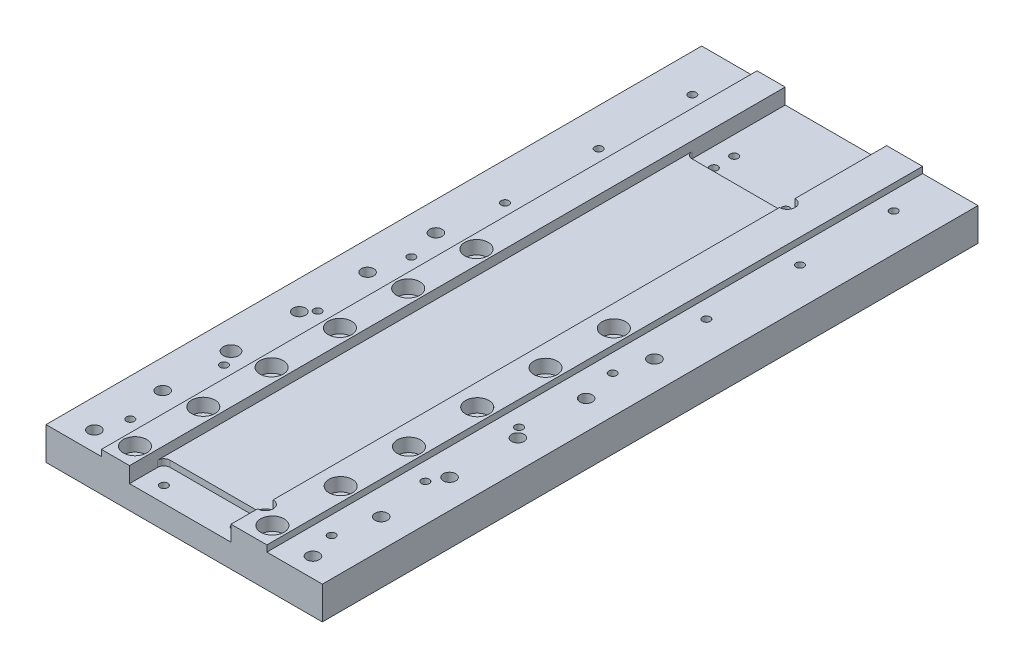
ISO-10303-21;
HEADER;
FILE_DESCRIPTION(('STEP AP214'),'2;1');
FILE_NAME('part.step','',(''),(''),'','','');
FILE_SCHEMA(('AUTOMOTIVE_DESIGN { 1 0 10303 214 1 1 1 1 }'));
ENDSEC;
DATA;
#1=APPLICATION_CONTEXT('core data for automotive mechanical design processes');
#2=APPLICATION_PROTOCOL_DEFINITION('international standard','automotive_design',2000,#1);
#3=PRODUCT_CONTEXT('',#1,'mechanical');
#4=PRODUCT('Part','Part','',(#3));
#5=PRODUCT_RELATED_PRODUCT_CATEGORY('part','',(#4));
#6=PRODUCT_DEFINITION_FORMATION('','',#4);
#7=PRODUCT_DEFINITION_CONTEXT('part definition',#1,'design');
#8=PRODUCT_DEFINITION('design','',#6,#7);
#9=PRODUCT_DEFINITION_SHAPE('','',#8);
#10=(LENGTH_UNIT() NAMED_UNIT(*) SI_UNIT(.MILLI.,.METRE.));
#11=(NAMED_UNIT(*) PLANE_ANGLE_UNIT() SI_UNIT($,.RADIAN.));
#12=(NAMED_UNIT(*) SI_UNIT($,.STERADIAN.) SOLID_ANGLE_UNIT());
#13=UNCERTAINTY_MEASURE_WITH_UNIT(LENGTH_MEASURE(1.E-05),#10,'distance_accuracy_value','');
#14=(GEOMETRIC_REPRESENTATION_CONTEXT(3) GLOBAL_UNCERTAINTY_ASSIGNED_CONTEXT((#13)) GLOBAL_UNIT_ASSIGNED_CONTEXT((#10,
#11,#12)) REPRESENTATION_CONTEXT('',''));
#15=CARTESIAN_POINT('',(0.,0.,0.));
#16=DIRECTION('',(0.,0.,1.));
#17=DIRECTION('',(1.,0.,0.));
#18=AXIS2_PLACEMENT_3D('',#15,#16,#17);
#19=CARTESIAN_POINT('',(132.5,187.,363.75));
#20=DIRECTION('',(0.,-1.,0.));
#21=DIRECTION('',(0.,0.,-1.));
#22=AXIS2_PLACEMENT_3D('',#19,#20,#21);
#23=CYLINDRICAL_SURFACE('',#22,4.49999999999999);
#24=CARTESIAN_POINT('',(132.5,0.,363.75));
#25=DIRECTION('',(0.,-1.,0.));
#26=DIRECTION('',(0.,0.,-1.));
#27=AXIS2_PLACEMENT_3D('',#24,#25,#26);
#28=CIRCLE('',#27,4.49999999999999);
#29=CARTESIAN_POINT('',(132.5,0.,359.25));
#30=VERTEX_POINT('',#29);
#31=EDGE_CURVE('E557',#30,#30,#28,.T.);
#32=ORIENTED_EDGE('',*,*,#31,.T.);
#33=EDGE_LOOP('',(#32));
#34=FACE_BOUND('',#33,.T.);
#35=CARTESIAN_POINT('',(132.5,16.4,363.75));
#36=DIRECTION('',(0.,1.,0.));
#37=DIRECTION('',(0.,0.,1.));
#38=AXIS2_PLACEMENT_3D('',#35,#36,#37);
#39=CIRCLE('',#38,4.49999999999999);
#40=CARTESIAN_POINT('',(132.5,16.4,368.25));
#41=VERTEX_POINT('',#40);
#42=EDGE_CURVE('E49',#41,#41,#39,.F.);
#43=ORIENTED_EDGE('',*,*,#42,.F.);
#44=EDGE_LOOP('',(#43));
#45=FACE_BOUND('',#44,.T.);
#46=ADVANCED_FACE('F45',(#34,#45),#23,.F.);
#47=CARTESIAN_POINT('',(44.5,187.,363.75));
#48=DIRECTION('',(0.,-1.,0.));
#49=DIRECTION('',(0.,0.,-1.));
#50=AXIS2_PLACEMENT_3D('',#47,#48,#49);
#51=CYLINDRICAL_SURFACE('',#50,4.5);
#52=CARTESIAN_POINT('',(44.5,0.,363.75));
#53=DIRECTION('',(0.,-1.,0.));
#54=DIRECTION('',(0.,0.,-1.));
#55=AXIS2_PLACEMENT_3D('',#52,#53,#54);
#56=CIRCLE('',#55,4.5);
#57=CARTESIAN_POINT('',(44.5,0.,359.25));
#58=VERTEX_POINT('',#57);
#59=EDGE_CURVE('E476',#58,#58,#56,.T.);
#60=ORIENTED_EDGE('',*,*,#59,.T.);
#61=EDGE_LOOP('',(#60));
#62=FACE_BOUND('',#61,.T.);
#63=CARTESIAN_POINT('',(44.5,16.4,363.75));
#64=DIRECTION('',(0.,1.,0.));
#65=DIRECTION('',(0.,0.,1.));
#66=AXIS2_PLACEMENT_3D('',#63,#64,#65);
#67=CIRCLE('',#66,4.5);
#68=CARTESIAN_POINT('',(44.5,16.4,368.25));
#69=VERTEX_POINT('',#68);
#70=EDGE_CURVE('E503',#69,#69,#67,.F.);
#71=ORIENTED_EDGE('',*,*,#70,.F.);
#72=EDGE_LOOP('',(#71));
#73=FACE_BOUND('',#72,.T.);
#74=ADVANCED_FACE('F899',(#62,#73),#51,.F.);
#75=CARTESIAN_POINT('',(44.5,187.,320.));
#76=DIRECTION('',(0.,-1.,0.));
#77=DIRECTION('',(0.,0.,-1.));
#78=AXIS2_PLACEMENT_3D('',#75,#76,#77);
#79=CYLINDRICAL_SURFACE('',#78,4.5);
#80=CARTESIAN_POINT('',(44.5,0.,320.));
#81=DIRECTION('',(0.,-1.,0.));
#82=DIRECTION('',(0.,0.,-1.));
#83=AXIS2_PLACEMENT_3D('',#80,#81,#82);
#84=CIRCLE('',#83,4.5);
#85=CARTESIAN_POINT('',(44.5,0.,315.5));
#86=VERTEX_POINT('',#85);
#87=EDGE_CURVE('E563',#86,#86,#84,.T.);
#88=ORIENTED_EDGE('',*,*,#87,.T.);
#89=EDGE_LOOP('',(#88));
#90=FACE_BOUND('',#89,.T.);
#91=CARTESIAN_POINT('',(44.5,16.4,320.));
#92=DIRECTION('',(0.,1.,0.));
#93=DIRECTION('',(0.,0.,1.));
#94=AXIS2_PLACEMENT_3D('',#91,#92,#93);
#95=CIRCLE('',#94,4.5);
#96=CARTESIAN_POINT('',(44.5,16.4,324.5));
#97=VERTEX_POINT('',#96);
#98=EDGE_CURVE('E499',#97,#97,#95,.F.);
#99=ORIENTED_EDGE('',*,*,#98,.F.);
#100=EDGE_LOOP('',(#99));
#101=FACE_BOUND('',#100,.T.);
#102=ADVANCED_FACE('F905',(#90,#101),#79,.F.);
#103=CARTESIAN_POINT('',(44.5,187.,276.25));
#104=DIRECTION('',(0.,-1.,0.));
#105=DIRECTION('',(0.,0.,-1.));
#106=AXIS2_PLACEMENT_3D('',#103,#104,#105);
#107=CYLINDRICAL_SURFACE('',#106,4.5);
#108=CARTESIAN_POINT('',(44.5,0.,276.25));
#109=DIRECTION('',(0.,-1.,0.));
#110=DIRECTION('',(0.,0.,-1.));
#111=AXIS2_PLACEMENT_3D('',#108,#109,#110);
#112=CIRCLE('',#111,4.5);
#113=CARTESIAN_POINT('',(44.5,0.,271.75));
#114=VERTEX_POINT('',#113);
#115=EDGE_CURVE('E569',#114,#114,#112,.T.);
#116=ORIENTED_EDGE('',*,*,#115,.T.);
#117=EDGE_LOOP('',(#116));
#118=FACE_BOUND('',#117,.T.);
#119=CARTESIAN_POINT('',(44.5,16.4,276.25));
#120=DIRECTION('',(0.,1.,0.));
#121=DIRECTION('',(0.,0.,1.));
#122=AXIS2_PLACEMENT_3D('',#119,#120,#121);
#123=CIRCLE('',#122,4.5);
#124=CARTESIAN_POINT('',(44.5,16.4,280.75));
#125=VERTEX_POINT('',#124);
#126=EDGE_CURVE('E494',#125,#125,#123,.F.);
#127=ORIENTED_EDGE('',*,*,#126,.F.);
#128=EDGE_LOOP('',(#127));
#129=FACE_BOUND('',#128,.T.);
#130=ADVANCED_FACE('F915',(#118,#129),#107,.F.);
#131=CARTESIAN_POINT('',(132.5,187.,320.));
#132=DIRECTION('',(0.,-1.,0.));
#133=DIRECTION('',(0.,0.,-1.));
#134=AXIS2_PLACEMENT_3D('',#131,#132,#133);
#135=CYLINDRICAL_SURFACE('',#134,4.49999999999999);
#136=CARTESIAN_POINT('',(132.5,0.,320.));
#137=DIRECTION('',(0.,-1.,0.));
#138=DIRECTION('',(0.,0.,-1.));
#139=AXIS2_PLACEMENT_3D('',#136,#137,#138);
#140=CIRCLE('',#139,4.49999999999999);
#141=CARTESIAN_POINT('',(132.5,0.,315.5));
#142=VERTEX_POINT('',#141);
#143=EDGE_CURVE('E560',#142,#142,#140,.T.);
#144=ORIENTED_EDGE('',*,*,#143,.T.);
#145=EDGE_LOOP('',(#144));
#146=FACE_BOUND('',#145,.T.);
#147=CARTESIAN_POINT('',(132.5,16.4,320.));
#148=DIRECTION('',(0.,1.,0.));
#149=DIRECTION('',(0.,0.,1.));
#150=AXIS2_PLACEMENT_3D('',#147,#148,#149);
#151=CIRCLE('',#150,4.49999999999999);
#152=CARTESIAN_POINT('',(132.5,16.4,324.5));
#153=VERTEX_POINT('',#152);
#154=EDGE_CURVE('E488',#153,#153,#151,.F.);
#155=ORIENTED_EDGE('',*,*,#154,.F.);
#156=EDGE_LOOP('',(#155));
#157=FACE_BOUND('',#156,.T.);
#158=ADVANCED_FACE('F911',(#146,#157),#135,.F.);
#159=CARTESIAN_POINT('',(132.5,187.,276.25));
#160=DIRECTION('',(0.,-1.,0.));
#161=DIRECTION('',(0.,0.,-1.));
#162=AXIS2_PLACEMENT_3D('',#159,#160,#161);
#163=CYLINDRICAL_SURFACE('',#162,4.49999999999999);
#164=CARTESIAN_POINT('',(132.5,0.,276.25));
#165=DIRECTION('',(0.,-1.,0.));
#166=DIRECTION('',(0.,0.,-1.));
#167=AXIS2_PLACEMENT_3D('',#164,#165,#166);
#168=CIRCLE('',#167,4.49999999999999);
#169=CARTESIAN_POINT('',(132.5,0.,271.75));
#170=VERTEX_POINT('',#169);
#171=EDGE_CURVE('E566',#170,#170,#168,.T.);
#172=ORIENTED_EDGE('',*,*,#171,.T.);
#173=EDGE_LOOP('',(#172));
#174=FACE_BOUND('',#173,.T.);
#175=CARTESIAN_POINT('',(132.5,16.4,276.25));
#176=DIRECTION('',(0.,1.,0.));
#177=DIRECTION('',(0.,0.,1.));
#178=AXIS2_PLACEMENT_3D('',#175,#176,#177);
#179=CIRCLE('',#178,4.49999999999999);
#180=CARTESIAN_POINT('',(132.5,16.4,280.75));
#181=VERTEX_POINT('',#180);
#182=EDGE_CURVE('E483',#181,#181,#179,.F.);
#183=ORIENTED_EDGE('',*,*,#182,.F.);
#184=EDGE_LOOP('',(#183));
#185=FACE_BOUND('',#184,.T.);
#186=ADVANCED_FACE('F914',(#174,#185),#163,.F.);
#187=CARTESIAN_POINT('',(132.5,187.,188.75));
#188=DIRECTION('',(0.,-1.,0.));
#189=DIRECTION('',(0.,0.,-1.));
#190=AXIS2_PLACEMENT_3D('',#187,#188,#189);
#191=CYLINDRICAL_SURFACE('',#190,4.49999999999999);
#192=CARTESIAN_POINT('',(132.5,0.,188.75));
#193=DIRECTION('',(0.,-1.,0.));
#194=DIRECTION('',(0.,0.,-1.));
#195=AXIS2_PLACEMENT_3D('',#192,#193,#194);
#196=CIRCLE('',#195,4.49999999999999);
#197=CARTESIAN_POINT('',(132.5,0.,184.25));
#198=VERTEX_POINT('',#197);
#199=EDGE_CURVE('E575',#198,#198,#196,.T.);
#200=ORIENTED_EDGE('',*,*,#199,.T.);
#201=EDGE_LOOP('',(#200));
#202=FACE_BOUND('',#201,.T.);
#203=CARTESIAN_POINT('',(132.5,16.4,188.75));
#204=DIRECTION('',(0.,1.,0.));
#205=DIRECTION('',(0.,0.,1.));
#206=AXIS2_PLACEMENT_3D('',#203,#204,#205);
#207=CIRCLE('',#206,4.49999999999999);
#208=CARTESIAN_POINT('',(132.5,16.4,193.25));
#209=VERTEX_POINT('',#208);
#210=EDGE_CURVE('E478',#209,#209,#207,.F.);
#211=ORIENTED_EDGE('',*,*,#210,.F.);
#212=EDGE_LOOP('',(#211));
#213=FACE_BOUND('',#212,.T.);
#214=ADVANCED_FACE('F922',(#202,#213),#191,.F.);
#215=CARTESIAN_POINT('',(44.5,187.,188.75));
#216=DIRECTION('',(0.,-1.,0.));
#217=DIRECTION('',(0.,0.,-1.));
#218=AXIS2_PLACEMENT_3D('',#215,#216,#217);
#219=CYLINDRICAL_SURFACE('',#218,4.5);
#220=CARTESIAN_POINT('',(44.5,0.,188.75));
#221=DIRECTION('',(0.,-1.,0.));
#222=DIRECTION('',(0.,0.,-1.));
#223=AXIS2_PLACEMENT_3D('',#220,#221,#222);
#224=CIRCLE('',#223,4.5);
#225=CARTESIAN_POINT('',(44.5,0.,184.25));
#226=VERTEX_POINT('',#225);
#227=EDGE_CURVE('E572',#226,#226,#224,.T.);
#228=ORIENTED_EDGE('',*,*,#227,.T.);
#229=EDGE_LOOP('',(#228));
#230=FACE_BOUND('',#229,.T.);
#231=CARTESIAN_POINT('',(44.5,16.4,188.75));
#232=DIRECTION('',(0.,1.,0.));
#233=DIRECTION('',(0.,0.,1.));
#234=AXIS2_PLACEMENT_3D('',#231,#232,#233);
#235=CIRCLE('',#234,4.5);
#236=CARTESIAN_POINT('',(44.5,16.4,193.25));
#237=VERTEX_POINT('',#236);
#238=EDGE_CURVE('E473',#237,#237,#235,.F.);
#239=ORIENTED_EDGE('',*,*,#238,.F.);
#240=EDGE_LOOP('',(#239));
#241=FACE_BOUND('',#240,.T.);
#242=ADVANCED_FACE('F927',(#230,#241),#219,.F.);
#243=CARTESIAN_POINT('',(0.,25.,420.));
#244=DIRECTION('',(0.,-1.,0.));
#245=DIRECTION('',(0.,0.,-1.));
#246=AXIS2_PLACEMENT_3D('',#243,#244,#245);
#247=PLANE('',#246);
#248=CARTESIAN_POINT('',(44.5,25.,363.75));
#249=DIRECTION('',(0.,1.,0.));
#250=DIRECTION('',(0.,0.,1.));
#251=AXIS2_PLACEMENT_3D('',#248,#249,#250);
#252=CIRCLE('',#251,7.5);
#253=CARTESIAN_POINT('',(44.5,25.,371.25));
#254=VERTEX_POINT('',#253);
#255=EDGE_CURVE('E516',#254,#254,#252,.T.);
#256=ORIENTED_EDGE('',*,*,#255,.F.);
#257=EDGE_LOOP('',(#256));
#258=FACE_BOUND('',#257,.T.);
#259=CARTESIAN_POINT('',(44.5,25.,320.));
#260=DIRECTION('',(0.,1.,0.));
#261=DIRECTION('',(0.,0.,1.));
#262=AXIS2_PLACEMENT_3D('',#259,#260,#261);
#263=CIRCLE('',#262,7.5);
#264=CARTESIAN_POINT('',(44.5,25.,327.5));
#265=VERTEX_POINT('',#264);
#266=EDGE_CURVE('E506',#265,#265,#263,.T.);
#267=ORIENTED_EDGE('',*,*,#266,.F.);
#268=EDGE_LOOP('',(#267));
#269=FACE_BOUND('',#268,.T.);
#270=CARTESIAN_POINT('',(44.5,25.,276.25));
#271=DIRECTION('',(0.,1.,0.));
#272=DIRECTION('',(0.,0.,1.));
#273=AXIS2_PLACEMENT_3D('',#270,#271,#272);
#274=CIRCLE('',#273,7.5);
#275=CARTESIAN_POINT('',(44.5,25.,283.75));
#276=VERTEX_POINT('',#275);
#277=EDGE_CURVE('E501',#276,#276,#274,.T.);
#278=ORIENTED_EDGE('',*,*,#277,.F.);
#279=EDGE_LOOP('',(#278));
#280=FACE_BOUND('',#279,.T.);
#281=CARTESIAN_POINT('',(44.5,25.,188.75));
#282=DIRECTION('',(0.,1.,0.));
#283=DIRECTION('',(0.,0.,1.));
#284=AXIS2_PLACEMENT_3D('',#281,#282,#283);
#285=CIRCLE('',#284,7.5);
#286=CARTESIAN_POINT('',(44.5,25.,196.25));
#287=VERTEX_POINT('',#286);
#288=EDGE_CURVE('E481',#287,#287,#285,.T.);
#289=ORIENTED_EDGE('',*,*,#288,.F.);
#290=EDGE_LOOP('',(#289));
#291=FACE_BOUND('',#290,.T.);
#292=CARTESIAN_POINT('',(44.5,25.,232.5));
#293=DIRECTION('',(0.,1.,0.));
#294=DIRECTION('',(0.,0.,1.));
#295=AXIS2_PLACEMENT_3D('',#292,#293,#294);
#296=CIRCLE('',#295,7.5);
#297=CARTESIAN_POINT('',(44.5,25.,240.));
#298=VERTEX_POINT('',#297);
#299=EDGE_CURVE('E438',#298,#298,#296,.T.);
#300=ORIENTED_EDGE('',*,*,#299,.F.);
#301=EDGE_LOOP('',(#300));
#302=FACE_BOUND('',#301,.T.);
#303=CARTESIAN_POINT('',(44.5,25.,407.5));
#304=DIRECTION('',(0.,1.,0.));
#305=DIRECTION('',(0.,0.,1.));
#306=AXIS2_PLACEMENT_3D('',#303,#304,#305);
#307=CIRCLE('',#306,7.5);
#308=CARTESIAN_POINT('',(44.5,25.,415.));
#309=VERTEX_POINT('',#308);
#310=EDGE_CURVE('E433',#309,#309,#307,.T.);
#311=ORIENTED_EDGE('',*,*,#310,.F.);
#312=EDGE_LOOP('',(#311));
#313=FACE_BOUND('',#312,.T.);
#314=DIRECTION('',(0.,0.,1.));
#315=VECTOR('',#314,1.);
#316=CARTESIAN_POINT('',(53.5,25.,420.));
#317=LINE('',#316,#315);
#318=CARTESIAN_POINT('',(53.5,25.,0.));
#319=VERTEX_POINT('',#318);
#320=CARTESIAN_POINT('',(53.5,25.,420.));
#321=VERTEX_POINT('',#320);
#322=EDGE_CURVE('E305',#319,#321,#317,.T.);
#323=ORIENTED_EDGE('',*,*,#322,.F.);
#324=DIRECTION('',(-1.,0.,0.));
#325=VECTOR('',#324,1.);
#326=CARTESIAN_POINT('',(0.,25.,0.));
#327=LINE('',#326,#325);
#328=CARTESIAN_POINT('',(35.5,25.,0.));
#329=VERTEX_POINT('',#328);
#330=EDGE_CURVE('E391',#319,#329,#327,.T.);
#331=ORIENTED_EDGE('',*,*,#330,.T.);
#332=DIRECTION('',(0.,0.,-1.));
#333=VECTOR('',#332,1.);
#334=CARTESIAN_POINT('',(35.5,25.,0.));
#335=LINE('',#334,#333);
#336=CARTESIAN_POINT('',(35.5000000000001,25.,420.));
#337=VERTEX_POINT('',#336);
#338=EDGE_CURVE('E345',#337,#329,#335,.T.);
#339=ORIENTED_EDGE('',*,*,#338,.F.);
#340=DIRECTION('',(-1.,0.,0.));
#341=VECTOR('',#340,1.);
#342=CARTESIAN_POINT('',(0.,25.,420.));
#343=LINE('',#342,#341);
#344=EDGE_CURVE('E380',#321,#337,#343,.T.);
#345=ORIENTED_EDGE('',*,*,#344,.F.);
#346=EDGE_LOOP('',(#323,#331,#339,#345));
#347=FACE_BOUND('',#346,.T.);
#348=ADVANCED_FACE('F860',(#258,#269,#280,#291,#302,#313,#347),#247,.F.);
#349=CARTESIAN_POINT('',(53.5,15.,398.));
#350=DIRECTION('',(0.,0.,-1.));
#351=DIRECTION('',(-1.,0.,0.));
#352=AXIS2_PLACEMENT_3D('',#349,#350,#351);
#353=PLANE('',#352);
#354=DIRECTION('',(1.,0.,0.));
#355=VECTOR('',#354,1.);
#356=CARTESIAN_POINT('',(53.5,19.,398.));
#357=LINE('',#356,#355);
#358=CARTESIAN_POINT('',(57.5,19.,398.));
#359=VERTEX_POINT('',#358);
#360=CARTESIAN_POINT('',(113.5,19.,398.));
#361=VERTEX_POINT('',#360);
#362=EDGE_CURVE('E663',#359,#361,#357,.T.);
#363=ORIENTED_EDGE('',*,*,#362,.F.);
#364=DIRECTION('',(0.,1.,0.));
#365=VECTOR('',#364,1.);
#366=CARTESIAN_POINT('',(57.5,15.,398.));
#367=LINE('',#366,#365);
#368=CARTESIAN_POINT('',(57.5,15.,398.));
#369=VERTEX_POINT('',#368);
#370=EDGE_CURVE('E403',#359,#369,#367,.F.);
#371=ORIENTED_EDGE('',*,*,#370,.T.);
#372=DIRECTION('',(-1.,0.,0.));
#373=VECTOR('',#372,1.);
#374=CARTESIAN_POINT('',(53.5,15.,398.));
#375=LINE('',#374,#373);
#376=CARTESIAN_POINT('',(113.5,15.,398.));
#377=VERTEX_POINT('',#376);
#378=EDGE_CURVE('E315',#377,#369,#375,.T.);
#379=ORIENTED_EDGE('',*,*,#378,.F.);
#380=DIRECTION('',(0.,1.,0.));
#381=VECTOR('',#380,1.);
#382=CARTESIAN_POINT('',(113.5,15.,398.));
#383=LINE('',#382,#381);
#384=EDGE_CURVE('E302',#377,#361,#383,.T.);
#385=ORIENTED_EDGE('',*,*,#384,.T.);
#386=EDGE_LOOP('',(#363,#371,#379,#385));
#387=FACE_BOUND('',#386,.T.);
#388=ADVANCED_FACE('F876',(#387),#353,.F.);
#389=CARTESIAN_POINT('',(57.5,15.,402.));
#390=DIRECTION('',(0.,-1.,0.));
#391=DIRECTION('',(0.,0.,-1.));
#392=AXIS2_PLACEMENT_3D('',#389,#390,#391);
#393=CYLINDRICAL_SURFACE('',#392,4.);
#394=CARTESIAN_POINT('',(57.5,19.,402.));
#395=DIRECTION('',(0.,1.,0.));
#396=DIRECTION('',(0.,0.,1.));
#397=AXIS2_PLACEMENT_3D('',#394,#395,#396);
#398=CIRCLE('',#397,4.);
#399=CARTESIAN_POINT('',(53.5,19.,402.));
#400=VERTEX_POINT('',#399);
#401=EDGE_CURVE('E661',#400,#359,#398,.F.);
#402=ORIENTED_EDGE('',*,*,#401,.F.);
#403=DIRECTION('',(0.,1.,0.));
#404=VECTOR('',#403,1.);
#405=CARTESIAN_POINT('',(53.5,25.,402.));
#406=LINE('',#405,#404);
#407=CARTESIAN_POINT('',(53.5,15.,402.));
#408=VERTEX_POINT('',#407);
#409=EDGE_CURVE('E400',#408,#400,#406,.T.);
#410=ORIENTED_EDGE('',*,*,#409,.F.);
#411=CARTESIAN_POINT('',(57.5,15.,402.));
#412=DIRECTION('',(0.,-1.,0.));
#413=DIRECTION('',(0.,0.,-1.));
#414=AXIS2_PLACEMENT_3D('',#411,#412,#413);
#415=CIRCLE('',#414,4.);
#416=EDGE_CURVE('E405',#369,#408,#415,.F.);
#417=ORIENTED_EDGE('',*,*,#416,.F.);
#418=ORIENTED_EDGE('',*,*,#370,.F.);
#419=EDGE_LOOP('',(#402,#410,#417,#418));
#420=FACE_BOUND('',#419,.T.);
#421=ADVANCED_FACE('F885',(#420),#393,.F.);
#422=CARTESIAN_POINT('',(0.,15.,63.7));
#423=DIRECTION('',(0.,0.,1.));
#424=DIRECTION('',(1.,0.,0.));
#425=AXIS2_PLACEMENT_3D('',#422,#423,#424);
#426=PLANE('',#425);
#427=DIRECTION('',(-1.,0.,0.));
#428=VECTOR('',#427,1.);
#429=CARTESIAN_POINT('',(0.,19.,63.7));
#430=LINE('',#429,#428);
#431=CARTESIAN_POINT('',(113.5,19.,63.7));
#432=VERTEX_POINT('',#431);
#433=CARTESIAN_POINT('',(57.5,19.,63.7));
#434=VERTEX_POINT('',#433);
#435=EDGE_CURVE('E62',#432,#434,#430,.T.);
#436=ORIENTED_EDGE('',*,*,#435,.F.);
#437=DIRECTION('',(0.,1.,0.));
#438=VECTOR('',#437,1.);
#439=CARTESIAN_POINT('',(113.5,15.,63.7));
#440=LINE('',#439,#438);
#441=CARTESIAN_POINT('',(113.5,15.,63.7));
#442=VERTEX_POINT('',#441);
#443=EDGE_CURVE('E794',#432,#442,#440,.F.);
#444=ORIENTED_EDGE('',*,*,#443,.T.);
#445=DIRECTION('',(1.,0.,0.));
#446=VECTOR('',#445,1.);
#447=CARTESIAN_POINT('',(0.,15.,63.7));
#448=LINE('',#447,#446);
#449=CARTESIAN_POINT('',(57.5,15.,63.7));
#450=VERTEX_POINT('',#449);
#451=EDGE_CURVE('E802',#450,#442,#448,.T.);
#452=ORIENTED_EDGE('',*,*,#451,.F.);
#453=DIRECTION('',(0.,1.,0.));
#454=VECTOR('',#453,1.);
#455=CARTESIAN_POINT('',(57.5,15.,63.7));
#456=LINE('',#455,#454);
#457=EDGE_CURVE('E407',#450,#434,#456,.T.);
#458=ORIENTED_EDGE('',*,*,#457,.T.);
#459=EDGE_LOOP('',(#436,#444,#452,#458));
#460=FACE_BOUND('',#459,.T.);
#461=ADVANCED_FACE('F1202',(#460),#426,.F.);
#462=CARTESIAN_POINT('',(57.5,15.,59.7));
#463=DIRECTION('',(0.,1.,0.));
#464=DIRECTION('',(0.,0.,1.));
#465=AXIS2_PLACEMENT_3D('',#462,#463,#464);
#466=CYLINDRICAL_SURFACE('',#465,4.);
#467=CARTESIAN_POINT('',(57.5,19.,59.7));
#468=DIRECTION('',(0.,1.,0.));
#469=DIRECTION('',(0.,0.,1.));
#470=AXIS2_PLACEMENT_3D('',#467,#468,#469);
#471=CIRCLE('',#470,4.);
#472=CARTESIAN_POINT('',(53.5,19.,59.7));
#473=VERTEX_POINT('',#472);
#474=EDGE_CURVE('E54',#434,#473,#471,.F.);
#475=ORIENTED_EDGE('',*,*,#474,.F.);
#476=ORIENTED_EDGE('',*,*,#457,.F.);
#477=CARTESIAN_POINT('',(57.5,15.,59.7));
#478=DIRECTION('',(0.,1.,0.));
#479=DIRECTION('',(0.,0.,1.));
#480=AXIS2_PLACEMENT_3D('',#477,#478,#479);
#481=CIRCLE('',#480,4.);
#482=CARTESIAN_POINT('',(53.5,15.,59.7));
#483=VERTEX_POINT('',#482);
#484=EDGE_CURVE('E411',#483,#450,#481,.T.);
#485=ORIENTED_EDGE('',*,*,#484,.F.);
#486=DIRECTION('',(0.,1.,0.));
#487=VECTOR('',#486,1.);
#488=CARTESIAN_POINT('',(53.5,15.,59.7));
#489=LINE('',#488,#487);
#490=EDGE_CURVE('E70',#473,#483,#489,.F.);
#491=ORIENTED_EDGE('',*,*,#490,.F.);
#492=EDGE_LOOP('',(#475,#476,#485,#491));
#493=FACE_BOUND('',#492,.T.);
#494=ADVANCED_FACE('F47',(#493),#466,.F.);
#495=CARTESIAN_POINT('',(132.5,25.,363.75));
#496=DIRECTION('',(0.,1.,0.));
#497=DIRECTION('',(0.,0.,1.));
#498=AXIS2_PLACEMENT_3D('',#495,#496,#497);
#499=CIRCLE('',#498,7.50000000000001);
#500=CARTESIAN_POINT('',(132.5,25.,371.25));
#501=VERTEX_POINT('',#500);
#502=EDGE_CURVE('E525',#501,#501,#499,.T.);
#503=ORIENTED_EDGE('',*,*,#502,.F.);
#504=EDGE_LOOP('',(#503));
#505=FACE_BOUND('',#504,.T.);
#506=CARTESIAN_POINT('',(132.5,25.,320.));
#507=DIRECTION('',(0.,1.,0.));
#508=DIRECTION('',(0.,0.,1.));
#509=AXIS2_PLACEMENT_3D('',#506,#507,#508);
#510=CIRCLE('',#509,7.50000000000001);
#511=CARTESIAN_POINT('',(132.5,25.,327.5));
#512=VERTEX_POINT('',#511);
#513=EDGE_CURVE('E497',#512,#512,#510,.T.);
#514=ORIENTED_EDGE('',*,*,#513,.F.);
#515=EDGE_LOOP('',(#514));
#516=FACE_BOUND('',#515,.T.);
#517=CARTESIAN_POINT('',(132.5,25.,276.25));
#518=DIRECTION('',(0.,1.,0.));
#519=DIRECTION('',(0.,0.,1.));
#520=AXIS2_PLACEMENT_3D('',#517,#518,#519);
#521=CIRCLE('',#520,7.50000000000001);
#522=CARTESIAN_POINT('',(132.5,25.,283.75));
#523=VERTEX_POINT('',#522);
#524=EDGE_CURVE('E492',#523,#523,#521,.T.);
#525=ORIENTED_EDGE('',*,*,#524,.F.);
#526=EDGE_LOOP('',(#525));
#527=FACE_BOUND('',#526,.T.);
#528=CARTESIAN_POINT('',(132.5,25.,188.75));
#529=DIRECTION('',(0.,1.,0.));
#530=DIRECTION('',(0.,0.,1.));
#531=AXIS2_PLACEMENT_3D('',#528,#529,#530);
#532=CIRCLE('',#531,7.50000000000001);
#533=CARTESIAN_POINT('',(132.5,25.,196.25));
#534=VERTEX_POINT('',#533);
#535=EDGE_CURVE('E486',#534,#534,#532,.T.);
#536=ORIENTED_EDGE('',*,*,#535,.F.);
#537=EDGE_LOOP('',(#536));
#538=FACE_BOUND('',#537,.T.);
#539=CARTESIAN_POINT('',(132.5,25.,407.5));
#540=DIRECTION('',(0.,1.,0.));
#541=DIRECTION('',(0.,0.,1.));
#542=AXIS2_PLACEMENT_3D('',#539,#540,#541);
#543=CIRCLE('',#542,7.50000000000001);
#544=CARTESIAN_POINT('',(132.5,25.,415.));
#545=VERTEX_POINT('',#544);
#546=EDGE_CURVE('E428',#545,#545,#543,.T.);
#547=ORIENTED_EDGE('',*,*,#546,.F.);
#548=EDGE_LOOP('',(#547));
#549=FACE_BOUND('',#548,.T.);
#550=CARTESIAN_POINT('',(132.5,25.,232.5));
#551=DIRECTION('',(0.,1.,0.));
#552=DIRECTION('',(0.,0.,1.));
#553=AXIS2_PLACEMENT_3D('',#550,#551,#552);
#554=CIRCLE('',#553,7.50000000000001);
#555=CARTESIAN_POINT('',(132.5,25.,240.));
#556=VERTEX_POINT('',#555);
#557=EDGE_CURVE('E422',#556,#556,#554,.T.);
#558=ORIENTED_EDGE('',*,*,#557,.F.);
#559=EDGE_LOOP('',(#558));
#560=FACE_BOUND('',#559,.T.);
#561=CARTESIAN_POINT('',(118.5,25.,63.7));
#562=DIRECTION('',(0.,1.,0.));
#563=DIRECTION('',(0.,0.,1.));
#564=AXIS2_PLACEMENT_3D('',#561,#562,#563);
#565=CIRCLE('',#564,5.00000000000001);
#566=CARTESIAN_POINT('',(118.5,25.,68.7));
#567=VERTEX_POINT('',#566);
#568=CARTESIAN_POINT('',(118.5,25.,58.7));
#569=VERTEX_POINT('',#568);
#570=EDGE_CURVE('E282',#567,#569,#565,.T.);
#571=ORIENTED_EDGE('',*,*,#570,.F.);
#572=DIRECTION('',(0.,0.,-1.));
#573=VECTOR('',#572,1.);
#574=CARTESIAN_POINT('',(118.5,25.,52.2926505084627));
#575=LINE('',#574,#573);
#576=CARTESIAN_POINT('',(118.5,25.,393.));
#577=VERTEX_POINT('',#576);
#578=EDGE_CURVE('E265',#577,#567,#575,.T.);
#579=ORIENTED_EDGE('',*,*,#578,.F.);
#580=CARTESIAN_POINT('',(118.5,25.,398.));
#581=DIRECTION('',(0.,1.,0.));
#582=DIRECTION('',(0.,0.,1.));
#583=AXIS2_PLACEMENT_3D('',#580,#581,#582);
#584=CIRCLE('',#583,5.00000000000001);
#585=CARTESIAN_POINT('',(118.5,25.,403.));
#586=VERTEX_POINT('',#585);
#587=EDGE_CURVE('E279',#586,#577,#584,.T.);
#588=ORIENTED_EDGE('',*,*,#587,.F.);
#589=DIRECTION('',(0.,0.,-1.));
#590=VECTOR('',#589,1.);
#591=CARTESIAN_POINT('',(118.5,25.,420.));
#592=LINE('',#591,#590);
#593=CARTESIAN_POINT('',(118.5,25.,420.));
#594=VERTEX_POINT('',#593);
#595=EDGE_CURVE('E309',#594,#586,#592,.T.);
#596=ORIENTED_EDGE('',*,*,#595,.F.);
#597=CARTESIAN_POINT('',(141.5,25.,420.));
#598=VERTEX_POINT('',#597);
#599=EDGE_CURVE('E381',#598,#594,#343,.T.);
#600=ORIENTED_EDGE('',*,*,#599,.F.);
#601=DIRECTION('',(0.,0.,1.));
#602=VECTOR('',#601,1.);
#603=CARTESIAN_POINT('',(141.5,25.,420.));
#604=LINE('',#603,#602);
#605=CARTESIAN_POINT('',(141.5,25.,0.));
#606=VERTEX_POINT('',#605);
#607=EDGE_CURVE('E324',#606,#598,#604,.T.);
#608=ORIENTED_EDGE('',*,*,#607,.F.);
#609=CARTESIAN_POINT('',(118.5,25.,0.));
#610=VERTEX_POINT('',#609);
#611=EDGE_CURVE('E374',#606,#610,#327,.T.);
#612=ORIENTED_EDGE('',*,*,#611,.T.);
#613=DIRECTION('',(0.,0.,-1.));
#614=VECTOR('',#613,1.);
#615=CARTESIAN_POINT('',(118.5,25.,0.));
#616=LINE('',#615,#614);
#617=EDGE_CURVE('E799',#569,#610,#616,.T.);
#618=ORIENTED_EDGE('',*,*,#617,.F.);
#619=EDGE_LOOP('',(#571,#579,#588,#596,#600,#608,#612,#618));
#620=FACE_BOUND('',#619,.T.);
#621=ADVANCED_FACE('F277',(#505,#516,#527,#538,#549,#560,#620),#247,.F.);
#622=CARTESIAN_POINT('',(0.,0.,0.));
#623=DIRECTION('',(0.,0.,-1.));
#624=DIRECTION('',(-1.,0.,0.));
#625=AXIS2_PLACEMENT_3D('',#622,#623,#624);
#626=PLANE('',#625);
#627=ORIENTED_EDGE('',*,*,#330,.F.);
#628=DIRECTION('',(0.,1.,0.));
#629=VECTOR('',#628,1.);
#630=CARTESIAN_POINT('',(53.5,15.,0.));
#631=LINE('',#630,#629);
#632=CARTESIAN_POINT('',(53.5,15.,0.));
#633=VERTEX_POINT('',#632);
#634=EDGE_CURVE('E292',#633,#319,#631,.T.);
#635=ORIENTED_EDGE('',*,*,#634,.F.);
#636=DIRECTION('',(-1.,0.,0.));
#637=VECTOR('',#636,1.);
#638=CARTESIAN_POINT('',(0.,15.,0.));
#639=LINE('',#638,#637);
#640=CARTESIAN_POINT('',(118.5,15.,0.));
#641=VERTEX_POINT('',#640);
#642=EDGE_CURVE('E807',#641,#633,#639,.T.);
#643=ORIENTED_EDGE('',*,*,#642,.F.);
#644=DIRECTION('',(0.,1.,0.));
#645=VECTOR('',#644,1.);
#646=CARTESIAN_POINT('',(118.5,15.,0.));
#647=LINE('',#646,#645);
#648=EDGE_CURVE('E297',#641,#610,#647,.T.);
#649=ORIENTED_EDGE('',*,*,#648,.T.);
#650=ORIENTED_EDGE('',*,*,#611,.F.);
#651=DIRECTION('',(0.,1.,0.));
#652=VECTOR('',#651,1.);
#653=CARTESIAN_POINT('',(141.5,21.,0.));
#654=LINE('',#653,#652);
#655=CARTESIAN_POINT('',(141.5,21.,0.));
#656=VERTEX_POINT('',#655);
#657=EDGE_CURVE('E339',#656,#606,#654,.T.);
#658=ORIENTED_EDGE('',*,*,#657,.F.);
#659=DIRECTION('',(-1.,0.,0.));
#660=VECTOR('',#659,1.);
#661=CARTESIAN_POINT('',(177.,21.,0.));
#662=LINE('',#661,#660);
#663=CARTESIAN_POINT('',(177.,21.,0.));
#664=VERTEX_POINT('',#663);
#665=EDGE_CURVE('E330',#664,#656,#662,.T.);
#666=ORIENTED_EDGE('',*,*,#665,.F.);
#667=DIRECTION('',(0.,1.,0.));
#668=VECTOR('',#667,1.);
#669=CARTESIAN_POINT('',(177.,0.,0.));
#670=LINE('',#669,#668);
#671=CARTESIAN_POINT('',(177.,0.,0.));
#672=VERTEX_POINT('',#671);
#673=EDGE_CURVE('E388',#672,#664,#670,.T.);
#674=ORIENTED_EDGE('',*,*,#673,.F.);
#675=DIRECTION('',(1.,0.,0.));
#676=VECTOR('',#675,1.);
#677=CARTESIAN_POINT('',(0.,0.,0.));
#678=LINE('',#677,#676);
#679=CARTESIAN_POINT('',(0.,0.,0.));
#680=VERTEX_POINT('',#679);
#681=EDGE_CURVE('E386',#680,#672,#678,.T.);
#682=ORIENTED_EDGE('',*,*,#681,.F.);
#683=DIRECTION('',(0.,-1.,0.));
#684=VECTOR('',#683,1.);
#685=CARTESIAN_POINT('',(0.,0.,0.));
#686=LINE('',#685,#684);
#687=CARTESIAN_POINT('',(0.,21.,0.));
#688=VERTEX_POINT('',#687);
#689=EDGE_CURVE('E366',#688,#680,#686,.T.);
#690=ORIENTED_EDGE('',*,*,#689,.F.);
#691=DIRECTION('',(-1.,0.,0.));
#692=VECTOR('',#691,1.);
#693=CARTESIAN_POINT('',(0.,21.,0.));
#694=LINE('',#693,#692);
#695=CARTESIAN_POINT('',(35.5000000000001,21.,0.));
#696=VERTEX_POINT('',#695);
#697=EDGE_CURVE('E357',#696,#688,#694,.T.);
#698=ORIENTED_EDGE('',*,*,#697,.F.);
#699=DIRECTION('',(0.,1.,0.));
#700=VECTOR('',#699,1.);
#701=CARTESIAN_POINT('',(35.5,21.,0.));
#702=LINE('',#701,#700);
#703=EDGE_CURVE('E363',#696,#329,#702,.T.);
#704=ORIENTED_EDGE('',*,*,#703,.T.);
#705=EDGE_LOOP('',(#627,#635,#643,#649,#650,#658,#666,#674,#682,#690,#698,#704));
#706=FACE_BOUND('',#705,.T.);
#707=ADVANCED_FACE('F816',(#706),#626,.T.);
#708=CARTESIAN_POINT('',(177.,0.,420.));
#709=DIRECTION('',(-1.,0.,0.));
#710=DIRECTION('',(0.,0.,1.));
#711=AXIS2_PLACEMENT_3D('',#708,#709,#710);
#712=PLANE('',#711);
#713=DIRECTION('',(0.,0.,-1.));
#714=VECTOR('',#713,1.);
#715=CARTESIAN_POINT('',(177.,21.,420.));
#716=LINE('',#715,#714);
#717=CARTESIAN_POINT('',(177.,21.,420.));
#718=VERTEX_POINT('',#717);
#719=EDGE_CURVE('E327',#718,#664,#716,.T.);
#720=ORIENTED_EDGE('',*,*,#719,.F.);
#721=DIRECTION('',(0.,1.,0.));
#722=VECTOR('',#721,1.);
#723=CARTESIAN_POINT('',(177.,0.,420.));
#724=LINE('',#723,#722);
#725=CARTESIAN_POINT('',(177.,0.,420.));
#726=VERTEX_POINT('',#725);
#727=EDGE_CURVE('E377',#726,#718,#724,.T.);
#728=ORIENTED_EDGE('',*,*,#727,.F.);
#729=DIRECTION('',(0.,0.,-1.));
#730=VECTOR('',#729,1.);
#731=CARTESIAN_POINT('',(177.,0.,420.));
#732=LINE('',#731,#730);
#733=EDGE_CURVE('E384',#726,#672,#732,.T.);
#734=ORIENTED_EDGE('',*,*,#733,.T.);
#735=ORIENTED_EDGE('',*,*,#673,.T.);
#736=EDGE_LOOP('',(#720,#728,#734,#735));
#737=FACE_BOUND('',#736,.T.);
#738=ADVANCED_FACE('F836',(#737),#712,.F.);
#739=CARTESIAN_POINT('',(0.,0.,420.));
#740=DIRECTION('',(1.,0.,0.));
#741=DIRECTION('',(0.,0.,-1.));
#742=AXIS2_PLACEMENT_3D('',#739,#740,#741);
#743=PLANE('',#742);
#744=DIRECTION('',(0.,0.,1.));
#745=VECTOR('',#744,1.);
#746=CARTESIAN_POINT('',(0.,21.,0.));
#747=LINE('',#746,#745);
#748=CARTESIAN_POINT('',(0.,21.,420.));
#749=VERTEX_POINT('',#748);
#750=EDGE_CURVE('E347',#688,#749,#747,.T.);
#751=ORIENTED_EDGE('',*,*,#750,.F.);
#752=ORIENTED_EDGE('',*,*,#689,.T.);
#753=DIRECTION('',(0.,0.,-1.));
#754=VECTOR('',#753,1.);
#755=CARTESIAN_POINT('',(0.,0.,420.));
#756=LINE('',#755,#754);
#757=CARTESIAN_POINT('',(0.,0.,420.));
#758=VERTEX_POINT('',#757);
#759=EDGE_CURVE('E396',#758,#680,#756,.T.);
#760=ORIENTED_EDGE('',*,*,#759,.F.);
#761=DIRECTION('',(0.,-1.,0.));
#762=VECTOR('',#761,1.);
#763=CARTESIAN_POINT('',(0.,0.,420.));
#764=LINE('',#763,#762);
#765=EDGE_CURVE('E370',#749,#758,#764,.T.);
#766=ORIENTED_EDGE('',*,*,#765,.F.);
#767=EDGE_LOOP('',(#751,#752,#760,#766));
#768=FACE_BOUND('',#767,.T.);
#769=ADVANCED_FACE('F849',(#768),#743,.F.);
#770=CARTESIAN_POINT('',(0.,0.,420.));
#771=DIRECTION('',(0.,1.,0.));
#772=DIRECTION('',(0.,0.,1.));
#773=AXIS2_PLACEMENT_3D('',#770,#771,#772);
#774=PLANE('',#773);
#775=ORIENTED_EDGE('',*,*,#59,.F.);
#776=EDGE_LOOP('',(#775));
#777=FACE_BOUND('',#776,.T.);
#778=ORIENTED_EDGE('',*,*,#31,.F.);
#779=EDGE_LOOP('',(#778));
#780=FACE_BOUND('',#779,.T.);
#781=ORIENTED_EDGE('',*,*,#143,.F.);
#782=EDGE_LOOP('',(#781));
#783=FACE_BOUND('',#782,.T.);
#784=ORIENTED_EDGE('',*,*,#87,.F.);
#785=EDGE_LOOP('',(#784));
#786=FACE_BOUND('',#785,.T.);
#787=ORIENTED_EDGE('',*,*,#171,.F.);
#788=EDGE_LOOP('',(#787));
#789=FACE_BOUND('',#788,.T.);
#790=ORIENTED_EDGE('',*,*,#115,.F.);
#791=EDGE_LOOP('',(#790));
#792=FACE_BOUND('',#791,.T.);
#793=ORIENTED_EDGE('',*,*,#227,.F.);
#794=EDGE_LOOP('',(#793));
#795=FACE_BOUND('',#794,.T.);
#796=ORIENTED_EDGE('',*,*,#199,.F.);
#797=EDGE_LOOP('',(#796));
#798=FACE_BOUND('',#797,.T.);
#799=CARTESIAN_POINT('',(18.5,0.,276.25));
#800=DIRECTION('',(0.,-1.,0.));
#801=DIRECTION('',(0.,0.,-1.));
#802=AXIS2_PLACEMENT_3D('',#799,#800,#801);
#803=CIRCLE('',#802,4.);
#804=CARTESIAN_POINT('',(18.5,0.,272.25));
#805=VERTEX_POINT('',#804);
#806=EDGE_CURVE('E472',#805,#805,#803,.T.);
#807=ORIENTED_EDGE('',*,*,#806,.F.);
#808=EDGE_LOOP('',(#807));
#809=FACE_BOUND('',#808,.T.);
#810=CARTESIAN_POINT('',(18.5,0.,320.));
#811=DIRECTION('',(0.,-1.,0.));
#812=DIRECTION('',(0.,0.,-1.));
#813=AXIS2_PLACEMENT_3D('',#810,#811,#812);
#814=CIRCLE('',#813,4.93080952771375);
#815=CARTESIAN_POINT('',(18.5,0.,315.069190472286));
#816=VERTEX_POINT('',#815);
#817=EDGE_CURVE('E468',#816,#816,#814,.T.);
#818=ORIENTED_EDGE('',*,*,#817,.F.);
#819=EDGE_LOOP('',(#818));
#820=FACE_BOUND('',#819,.T.);
#821=CARTESIAN_POINT('',(18.5,0.,363.75));
#822=DIRECTION('',(0.,-1.,0.));
#823=DIRECTION('',(0.,0.,-1.));
#824=AXIS2_PLACEMENT_3D('',#821,#822,#823);
#825=CIRCLE('',#824,4.);
#826=CARTESIAN_POINT('',(18.5,0.,359.75));
#827=VERTEX_POINT('',#826);
#828=EDGE_CURVE('E463',#827,#827,#825,.T.);
#829=ORIENTED_EDGE('',*,*,#828,.F.);
#830=EDGE_LOOP('',(#829));
#831=FACE_BOUND('',#830,.T.);
#832=CARTESIAN_POINT('',(158.5,0.,363.75));
#833=DIRECTION('',(0.,-1.,0.));
#834=DIRECTION('',(0.,0.,-1.));
#835=AXIS2_PLACEMENT_3D('',#832,#833,#834);
#836=CIRCLE('',#835,3.99999999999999);
#837=CARTESIAN_POINT('',(158.5,0.,359.75));
#838=VERTEX_POINT('',#837);
#839=EDGE_CURVE('E458',#838,#838,#836,.T.);
#840=ORIENTED_EDGE('',*,*,#839,.F.);
#841=EDGE_LOOP('',(#840));
#842=FACE_BOUND('',#841,.T.);
#843=CARTESIAN_POINT('',(158.5,0.,320.));
#844=DIRECTION('',(0.,-1.,0.));
#845=DIRECTION('',(0.,0.,-1.));
#846=AXIS2_PLACEMENT_3D('',#843,#844,#845);
#847=CIRCLE('',#846,3.99999999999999);
#848=CARTESIAN_POINT('',(158.5,0.,316.));
#849=VERTEX_POINT('',#848);
#850=EDGE_CURVE('E453',#849,#849,#847,.T.);
#851=ORIENTED_EDGE('',*,*,#850,.F.);
#852=EDGE_LOOP('',(#851));
#853=FACE_BOUND('',#852,.T.);
#854=CARTESIAN_POINT('',(158.5,0.,276.25));
#855=DIRECTION('',(0.,-1.,0.));
#856=DIRECTION('',(0.,0.,-1.));
#857=AXIS2_PLACEMENT_3D('',#854,#855,#856);
#858=CIRCLE('',#857,3.99999999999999);
#859=CARTESIAN_POINT('',(158.5,0.,272.25));
#860=VERTEX_POINT('',#859);
#861=EDGE_CURVE('E448',#860,#860,#858,.T.);
#862=ORIENTED_EDGE('',*,*,#861,.F.);
#863=EDGE_LOOP('',(#862));
#864=FACE_BOUND('',#863,.T.);
#865=CARTESIAN_POINT('',(18.5,0.,188.75));
#866=DIRECTION('',(0.,-1.,0.));
#867=DIRECTION('',(0.,0.,-1.));
#868=AXIS2_PLACEMENT_3D('',#865,#866,#867);
#869=CIRCLE('',#868,4.);
#870=CARTESIAN_POINT('',(18.5,0.,184.75));
#871=VERTEX_POINT('',#870);
#872=EDGE_CURVE('E444',#871,#871,#869,.T.);
#873=ORIENTED_EDGE('',*,*,#872,.F.);
#874=EDGE_LOOP('',(#873));
#875=FACE_BOUND('',#874,.T.);
#876=CARTESIAN_POINT('',(158.5,0.,188.75));
#877=DIRECTION('',(0.,-1.,0.));
#878=DIRECTION('',(0.,0.,-1.));
#879=AXIS2_PLACEMENT_3D('',#876,#877,#878);
#880=CIRCLE('',#879,3.99999999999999);
#881=CARTESIAN_POINT('',(158.5,0.,184.75));
#882=VERTEX_POINT('',#881);
#883=EDGE_CURVE('E439',#882,#882,#880,.T.);
#884=ORIENTED_EDGE('',*,*,#883,.F.);
#885=EDGE_LOOP('',(#884));
#886=FACE_BOUND('',#885,.T.);
#887=CARTESIAN_POINT('',(44.5,0.,232.5));
#888=DIRECTION('',(0.,1.,0.));
#889=DIRECTION('',(0.,0.,1.));
#890=AXIS2_PLACEMENT_3D('',#887,#888,#889);
#891=CIRCLE('',#890,4.49999999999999);
#892=CARTESIAN_POINT('',(44.5,0.,237.));
#893=VERTEX_POINT('',#892);
#894=EDGE_CURVE('E430',#893,#893,#891,.T.);
#895=ORIENTED_EDGE('',*,*,#894,.T.);
#896=EDGE_LOOP('',(#895));
#897=FACE_BOUND('',#896,.T.);
#898=CARTESIAN_POINT('',(44.5,0.,407.5));
#899=DIRECTION('',(0.,1.,0.));
#900=DIRECTION('',(0.,0.,1.));
#901=AXIS2_PLACEMENT_3D('',#898,#899,#900);
#902=CIRCLE('',#901,4.49999999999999);
#903=CARTESIAN_POINT('',(44.5,0.,412.));
#904=VERTEX_POINT('',#903);
#905=EDGE_CURVE('E424',#904,#904,#902,.T.);
#906=ORIENTED_EDGE('',*,*,#905,.T.);
#907=EDGE_LOOP('',(#906));
#908=FACE_BOUND('',#907,.T.);
#909=CARTESIAN_POINT('',(132.5,0.,407.5));
#910=DIRECTION('',(0.,1.,0.));
#911=DIRECTION('',(0.,0.,1.));
#912=AXIS2_PLACEMENT_3D('',#909,#910,#911);
#913=CIRCLE('',#912,4.5);
#914=CARTESIAN_POINT('',(132.5,0.,412.));
#915=VERTEX_POINT('',#914);
#916=EDGE_CURVE('E419',#915,#915,#913,.T.);
#917=ORIENTED_EDGE('',*,*,#916,.T.);
#918=EDGE_LOOP('',(#917));
#919=FACE_BOUND('',#918,.T.);
#920=CARTESIAN_POINT('',(132.5,0.,232.5));
#921=DIRECTION('',(0.,1.,0.));
#922=DIRECTION('',(0.,0.,1.));
#923=AXIS2_PLACEMENT_3D('',#920,#921,#922);
#924=CIRCLE('',#923,4.5);
#925=CARTESIAN_POINT('',(132.5,0.,237.));
#926=VERTEX_POINT('',#925);
#927=EDGE_CURVE('E414',#926,#926,#924,.T.);
#928=ORIENTED_EDGE('',*,*,#927,.T.);
#929=EDGE_LOOP('',(#928));
#930=FACE_BOUND('',#929,.T.);
#931=CARTESIAN_POINT('',(158.5,0.,232.5));
#932=DIRECTION('',(0.,1.,0.));
#933=DIRECTION('',(0.,0.,1.));
#934=AXIS2_PLACEMENT_3D('',#931,#932,#933);
#935=CIRCLE('',#934,3.99999999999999);
#936=CARTESIAN_POINT('',(158.5,0.,236.5));
#937=VERTEX_POINT('',#936);
#938=EDGE_CURVE('E631',#937,#937,#935,.T.);
#939=ORIENTED_EDGE('',*,*,#938,.T.);
#940=EDGE_LOOP('',(#939));
#941=FACE_BOUND('',#940,.T.);
#942=CARTESIAN_POINT('',(18.5,0.,232.5));
#943=DIRECTION('',(0.,1.,0.));
#944=DIRECTION('',(0.,0.,1.));
#945=AXIS2_PLACEMENT_3D('',#942,#943,#944);
#946=CIRCLE('',#945,4.);
#947=CARTESIAN_POINT('',(18.5,0.,236.5));
#948=VERTEX_POINT('',#947);
#949=EDGE_CURVE('E638',#948,#948,#946,.T.);
#950=ORIENTED_EDGE('',*,*,#949,.T.);
#951=EDGE_LOOP('',(#950));
#952=FACE_BOUND('',#951,.T.);
#953=CARTESIAN_POINT('',(158.5,0.,407.5));
#954=DIRECTION('',(0.,1.,0.));
#955=DIRECTION('',(0.,0.,1.));
#956=AXIS2_PLACEMENT_3D('',#953,#954,#955);
#957=CIRCLE('',#956,3.99999999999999);
#958=CARTESIAN_POINT('',(158.5,0.,411.5));
#959=VERTEX_POINT('',#958);
#960=EDGE_CURVE('E644',#959,#959,#957,.T.);
#961=ORIENTED_EDGE('',*,*,#960,.T.);
#962=EDGE_LOOP('',(#961));
#963=FACE_BOUND('',#962,.T.);
#964=CARTESIAN_POINT('',(18.5,0.,407.5));
#965=DIRECTION('',(0.,1.,0.));
#966=DIRECTION('',(0.,0.,1.));
#967=AXIS2_PLACEMENT_3D('',#964,#965,#966);
#968=CIRCLE('',#967,4.);
#969=CARTESIAN_POINT('',(18.5,0.,411.5));
#970=VERTEX_POINT('',#969);
#971=EDGE_CURVE('E285',#970,#970,#968,.T.);
#972=ORIENTED_EDGE('',*,*,#971,.T.);
#973=EDGE_LOOP('',(#972));
#974=FACE_BOUND('',#973,.T.);
#975=ORIENTED_EDGE('',*,*,#681,.T.);
#976=ORIENTED_EDGE('',*,*,#733,.F.);
#977=DIRECTION('',(1.,0.,0.));
#978=VECTOR('',#977,1.);
#979=CARTESIAN_POINT('',(0.,0.,420.));
#980=LINE('',#979,#978);
#981=EDGE_CURVE('E373',#758,#726,#980,.T.);
#982=ORIENTED_EDGE('',*,*,#981,.F.);
#983=ORIENTED_EDGE('',*,*,#759,.T.);
#984=EDGE_LOOP('',(#975,#976,#982,#983));
#985=FACE_BOUND('',#984,.T.);
#986=ADVANCED_FACE('F845',(#777,#780,#783,#786,#789,#792,#795,#798,#809,#820,#831,#842,#853,
#864,#875,#886,#897,#908,#919,#930,#941,#952,#963,#974,#985),#774,.F.);
#987=CARTESIAN_POINT('',(0.,0.,420.));
#988=DIRECTION('',(0.,0.,-1.));
#989=DIRECTION('',(-1.,0.,0.));
#990=AXIS2_PLACEMENT_3D('',#987,#988,#989);
#991=PLANE('',#990);
#992=DIRECTION('',(1.,0.,0.));
#993=VECTOR('',#992,1.);
#994=CARTESIAN_POINT('',(53.5,15.,420.));
#995=LINE('',#994,#993);
#996=CARTESIAN_POINT('',(53.5,15.,420.));
#997=VERTEX_POINT('',#996);
#998=CARTESIAN_POINT('',(118.5,15.,420.));
#999=VERTEX_POINT('',#998);
#1000=EDGE_CURVE('E308',#997,#999,#995,.T.);
#1001=ORIENTED_EDGE('',*,*,#1000,.F.);
#1002=DIRECTION('',(0.,1.,0.));
#1003=VECTOR('',#1002,1.);
#1004=CARTESIAN_POINT('',(53.5,15.,420.));
#1005=LINE('',#1004,#1003);
#1006=EDGE_CURVE('E318',#997,#321,#1005,.T.);
#1007=ORIENTED_EDGE('',*,*,#1006,.T.);
#1008=ORIENTED_EDGE('',*,*,#344,.T.);
#1009=DIRECTION('',(0.,1.,0.));
#1010=VECTOR('',#1009,1.);
#1011=CARTESIAN_POINT('',(35.5000000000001,21.,420.));
#1012=LINE('',#1011,#1010);
#1013=CARTESIAN_POINT('',(35.5000000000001,21.,420.));
#1014=VERTEX_POINT('',#1013);
#1015=EDGE_CURVE('E359',#1014,#337,#1012,.T.);
#1016=ORIENTED_EDGE('',*,*,#1015,.F.);
#1017=DIRECTION('',(1.,0.,0.));
#1018=VECTOR('',#1017,1.);
#1019=CARTESIAN_POINT('',(0.,21.,420.));
#1020=LINE('',#1019,#1018);
#1021=EDGE_CURVE('E350',#749,#1014,#1020,.T.);
#1022=ORIENTED_EDGE('',*,*,#1021,.F.);
#1023=ORIENTED_EDGE('',*,*,#765,.T.);
#1024=ORIENTED_EDGE('',*,*,#981,.T.);
#1025=ORIENTED_EDGE('',*,*,#727,.T.);
#1026=DIRECTION('',(1.,0.,0.));
#1027=VECTOR('',#1026,1.);
#1028=CARTESIAN_POINT('',(177.,21.,420.));
#1029=LINE('',#1028,#1027);
#1030=CARTESIAN_POINT('',(141.5,21.,420.));
#1031=VERTEX_POINT('',#1030);
#1032=EDGE_CURVE('E337',#1031,#718,#1029,.T.);
#1033=ORIENTED_EDGE('',*,*,#1032,.F.);
#1034=DIRECTION('',(0.,1.,0.));
#1035=VECTOR('',#1034,1.);
#1036=CARTESIAN_POINT('',(141.5,21.,420.));
#1037=LINE('',#1036,#1035);
#1038=EDGE_CURVE('E342',#1031,#598,#1037,.T.);
#1039=ORIENTED_EDGE('',*,*,#1038,.T.);
#1040=ORIENTED_EDGE('',*,*,#599,.T.);
#1041=DIRECTION('',(0.,1.,0.));
#1042=VECTOR('',#1041,1.);
#1043=CARTESIAN_POINT('',(118.5,15.,420.));
#1044=LINE('',#1043,#1042);
#1045=EDGE_CURVE('E322',#999,#594,#1044,.T.);
#1046=ORIENTED_EDGE('',*,*,#1045,.F.);
#1047=EDGE_LOOP('',(#1001,#1007,#1008,#1016,#1022,#1023,#1024,#1025,#1033,#1039,#1040,#1046));
#1048=FACE_BOUND('',#1047,.T.);
#1049=ADVANCED_FACE('F828',(#1048),#991,.F.);
#1050=CARTESIAN_POINT('',(35.5,21.,0.));
#1051=DIRECTION('',(1.,0.,0.));
#1052=DIRECTION('',(0.,0.,-1.));
#1053=AXIS2_PLACEMENT_3D('',#1050,#1051,#1052);
#1054=PLANE('',#1053);
#1055=ORIENTED_EDGE('',*,*,#338,.T.);
#1056=ORIENTED_EDGE('',*,*,#703,.F.);
#1057=DIRECTION('',(0.,0.,-1.));
#1058=VECTOR('',#1057,1.);
#1059=CARTESIAN_POINT('',(35.5,21.,0.));
#1060=LINE('',#1059,#1058);
#1061=EDGE_CURVE('E354',#1014,#696,#1060,.T.);
#1062=ORIENTED_EDGE('',*,*,#1061,.F.);
#1063=ORIENTED_EDGE('',*,*,#1015,.T.);
#1064=EDGE_LOOP('',(#1055,#1056,#1062,#1063));
#1065=FACE_BOUND('',#1064,.T.);
#1066=ADVANCED_FACE('F857',(#1065),#1054,.F.);
#1067=CARTESIAN_POINT('',(0.,21.,0.));
#1068=DIRECTION('',(0.,1.,0.));
#1069=DIRECTION('',(0.,0.,1.));
#1070=AXIS2_PLACEMENT_3D('',#1067,#1068,#1069);
#1071=PLANE('',#1070);
#1072=CARTESIAN_POINT('',(18.5,21.,276.25));
#1073=DIRECTION('',(0.,1.,0.));
#1074=DIRECTION('',(0.,0.,1.));
#1075=AXIS2_PLACEMENT_3D('',#1072,#1073,#1074);
#1076=CIRCLE('',#1075,4.);
#1077=CARTESIAN_POINT('',(18.5,21.,280.25));
#1078=VERTEX_POINT('',#1077);
#1079=EDGE_CURVE('E469',#1078,#1078,#1076,.T.);
#1080=ORIENTED_EDGE('',*,*,#1079,.F.);
#1081=EDGE_LOOP('',(#1080));
#1082=FACE_BOUND('',#1081,.T.);
#1083=CARTESIAN_POINT('',(18.5,21.,320.));
#1084=DIRECTION('',(0.,1.,0.));
#1085=DIRECTION('',(0.,0.,1.));
#1086=AXIS2_PLACEMENT_3D('',#1083,#1084,#1085);
#1087=CIRCLE('',#1086,4.93080952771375);
#1088=CARTESIAN_POINT('',(18.5,21.,324.930809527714));
#1089=VERTEX_POINT('',#1088);
#1090=EDGE_CURVE('E464',#1089,#1089,#1087,.T.);
#1091=ORIENTED_EDGE('',*,*,#1090,.F.);
#1092=EDGE_LOOP('',(#1091));
#1093=FACE_BOUND('',#1092,.T.);
#1094=CARTESIAN_POINT('',(18.5,21.,363.75));
#1095=DIRECTION('',(0.,1.,0.));
#1096=DIRECTION('',(0.,0.,1.));
#1097=AXIS2_PLACEMENT_3D('',#1094,#1095,#1096);
#1098=CIRCLE('',#1097,4.);
#1099=CARTESIAN_POINT('',(18.5,21.,367.75));
#1100=VERTEX_POINT('',#1099);
#1101=EDGE_CURVE('E459',#1100,#1100,#1098,.T.);
#1102=ORIENTED_EDGE('',*,*,#1101,.F.);
#1103=EDGE_LOOP('',(#1102));
#1104=FACE_BOUND('',#1103,.T.);
#1105=CARTESIAN_POINT('',(18.5,21.,188.75));
#1106=DIRECTION('',(0.,1.,0.));
#1107=DIRECTION('',(0.,0.,1.));
#1108=AXIS2_PLACEMENT_3D('',#1105,#1106,#1107);
#1109=CIRCLE('',#1108,4.);
#1110=CARTESIAN_POINT('',(18.5,21.,192.75));
#1111=VERTEX_POINT('',#1110);
#1112=EDGE_CURVE('E440',#1111,#1111,#1109,.T.);
#1113=ORIENTED_EDGE('',*,*,#1112,.F.);
#1114=EDGE_LOOP('',(#1113));
#1115=FACE_BOUND('',#1114,.T.);
#1116=CARTESIAN_POINT('',(18.5,21.,232.5));
#1117=DIRECTION('',(0.,1.,0.));
#1118=DIRECTION('',(0.,0.,1.));
#1119=AXIS2_PLACEMENT_3D('',#1116,#1117,#1118);
#1120=CIRCLE('',#1119,4.);
#1121=CARTESIAN_POINT('',(18.5,21.,236.5));
#1122=VERTEX_POINT('',#1121);
#1123=EDGE_CURVE('E634',#1122,#1122,#1120,.T.);
#1124=ORIENTED_EDGE('',*,*,#1123,.F.);
#1125=EDGE_LOOP('',(#1124));
#1126=FACE_BOUND('',#1125,.T.);
#1127=CARTESIAN_POINT('',(18.5,21.,407.5));
#1128=DIRECTION('',(0.,1.,0.));
#1129=DIRECTION('',(0.,0.,1.));
#1130=AXIS2_PLACEMENT_3D('',#1127,#1128,#1129);
#1131=CIRCLE('',#1130,4.);
#1132=CARTESIAN_POINT('',(18.5,21.,411.5));
#1133=VERTEX_POINT('',#1132);
#1134=EDGE_CURVE('E647',#1133,#1133,#1131,.T.);
#1135=ORIENTED_EDGE('',*,*,#1134,.F.);
#1136=EDGE_LOOP('',(#1135));
#1137=FACE_BOUND('',#1136,.T.);
#1138=CARTESIAN_POINT('',(24.0000000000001,21.,90.));
#1139=DIRECTION('',(0.,1.,0.));
#1140=DIRECTION('',(0.,0.,1.));
#1141=AXIS2_PLACEMENT_3D('',#1138,#1139,#1140);
#1142=CIRCLE('',#1141,2.5);
#1143=CARTESIAN_POINT('',(24.0000000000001,21.,92.5));
#1144=VERTEX_POINT('',#1143);
#1145=EDGE_CURVE('E701',#1144,#1144,#1142,.T.);
#1146=ORIENTED_EDGE('',*,*,#1145,.F.);
#1147=EDGE_LOOP('',(#1146));
#1148=FACE_BOUND('',#1147,.T.);
#1149=CARTESIAN_POINT('',(24.0000000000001,21.,30.));
#1150=DIRECTION('',(0.,1.,0.));
#1151=DIRECTION('',(0.,0.,1.));
#1152=AXIS2_PLACEMENT_3D('',#1149,#1150,#1151);
#1153=CIRCLE('',#1152,2.5);
#1154=CARTESIAN_POINT('',(24.0000000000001,21.,32.5));
#1155=VERTEX_POINT('',#1154);
#1156=EDGE_CURVE('E707',#1155,#1155,#1153,.T.);
#1157=ORIENTED_EDGE('',*,*,#1156,.F.);
#1158=EDGE_LOOP('',(#1157));
#1159=FACE_BOUND('',#1158,.T.);
#1160=CARTESIAN_POINT('',(24.0000000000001,21.,150.));
#1161=DIRECTION('',(0.,1.,0.));
#1162=DIRECTION('',(0.,0.,1.));
#1163=AXIS2_PLACEMENT_3D('',#1160,#1161,#1162);
#1164=CIRCLE('',#1163,2.5);
#1165=CARTESIAN_POINT('',(24.0000000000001,21.,152.5));
#1166=VERTEX_POINT('',#1165);
#1167=EDGE_CURVE('E713',#1166,#1166,#1164,.T.);
#1168=ORIENTED_EDGE('',*,*,#1167,.F.);
#1169=EDGE_LOOP('',(#1168));
#1170=FACE_BOUND('',#1169,.T.);
#1171=CARTESIAN_POINT('',(24.0000000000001,21.,210.));
#1172=DIRECTION('',(0.,1.,0.));
#1173=DIRECTION('',(0.,0.,1.));
#1174=AXIS2_PLACEMENT_3D('',#1171,#1172,#1173);
#1175=CIRCLE('',#1174,2.5);
#1176=CARTESIAN_POINT('',(24.0000000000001,21.,212.5));
#1177=VERTEX_POINT('',#1176);
#1178=EDGE_CURVE('E719',#1177,#1177,#1175,.T.);
#1179=ORIENTED_EDGE('',*,*,#1178,.F.);
#1180=EDGE_LOOP('',(#1179));
#1181=FACE_BOUND('',#1180,.T.);
#1182=CARTESIAN_POINT('',(24.0000000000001,21.,270.));
#1183=DIRECTION('',(0.,1.,0.));
#1184=DIRECTION('',(0.,0.,1.));
#1185=AXIS2_PLACEMENT_3D('',#1182,#1183,#1184);
#1186=CIRCLE('',#1185,2.5);
#1187=CARTESIAN_POINT('',(24.0000000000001,21.,272.5));
#1188=VERTEX_POINT('',#1187);
#1189=EDGE_CURVE('E726',#1188,#1188,#1186,.T.);
#1190=ORIENTED_EDGE('',*,*,#1189,.F.);
#1191=EDGE_LOOP('',(#1190));
#1192=FACE_BOUND('',#1191,.T.);
#1193=CARTESIAN_POINT('',(24.0000000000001,21.,330.));
#1194=DIRECTION('',(0.,1.,0.));
#1195=DIRECTION('',(0.,0.,1.));
#1196=AXIS2_PLACEMENT_3D('',#1193,#1194,#1195);
#1197=CIRCLE('',#1196,2.5);
#1198=CARTESIAN_POINT('',(24.0000000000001,21.,332.5));
#1199=VERTEX_POINT('',#1198);
#1200=EDGE_CURVE('E732',#1199,#1199,#1197,.T.);
#1201=ORIENTED_EDGE('',*,*,#1200,.F.);
#1202=EDGE_LOOP('',(#1201));
#1203=FACE_BOUND('',#1202,.T.);
#1204=CARTESIAN_POINT('',(24.0000000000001,21.,390.));
#1205=DIRECTION('',(0.,1.,0.));
#1206=DIRECTION('',(0.,0.,1.));
#1207=AXIS2_PLACEMENT_3D('',#1204,#1205,#1206);
#1208=CIRCLE('',#1207,2.5);
#1209=CARTESIAN_POINT('',(24.0000000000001,21.,392.5));
#1210=VERTEX_POINT('',#1209);
#1211=EDGE_CURVE('E740',#1210,#1210,#1208,.T.);
#1212=ORIENTED_EDGE('',*,*,#1211,.F.);
#1213=EDGE_LOOP('',(#1212));
#1214=FACE_BOUND('',#1213,.T.);
#1215=ORIENTED_EDGE('',*,*,#750,.T.);
#1216=ORIENTED_EDGE('',*,*,#1021,.T.);
#1217=ORIENTED_EDGE('',*,*,#1061,.T.);
#1218=ORIENTED_EDGE('',*,*,#697,.T.);
#1219=EDGE_LOOP('',(#1215,#1216,#1217,#1218));
#1220=FACE_BOUND('',#1219,.T.);
#1221=ADVANCED_FACE('F852',(#1082,#1093,#1104,#1115,#1126,#1137,#1148,#1159,#1170,#1181,#1192,
#1203,#1214,#1220),#1071,.T.);
#1222=CARTESIAN_POINT('',(141.5,21.,420.));
#1223=DIRECTION('',(-1.,0.,0.));
#1224=DIRECTION('',(0.,0.,1.));
#1225=AXIS2_PLACEMENT_3D('',#1222,#1223,#1224);
#1226=PLANE('',#1225);
#1227=ORIENTED_EDGE('',*,*,#607,.T.);
#1228=ORIENTED_EDGE('',*,*,#1038,.F.);
#1229=DIRECTION('',(0.,0.,1.));
#1230=VECTOR('',#1229,1.);
#1231=CARTESIAN_POINT('',(141.5,21.,420.));
#1232=LINE('',#1231,#1230);
#1233=EDGE_CURVE('E333',#656,#1031,#1232,.T.);
#1234=ORIENTED_EDGE('',*,*,#1233,.F.);
#1235=ORIENTED_EDGE('',*,*,#657,.T.);
#1236=EDGE_LOOP('',(#1227,#1228,#1234,#1235));
#1237=FACE_BOUND('',#1236,.T.);
#1238=ADVANCED_FACE('F824',(#1237),#1226,.F.);
#1239=CARTESIAN_POINT('',(0.,21.,0.));
#1240=DIRECTION('',(0.,1.,0.));
#1241=DIRECTION('',(0.,0.,1.));
#1242=AXIS2_PLACEMENT_3D('',#1239,#1240,#1241);
#1243=PLANE('',#1242);
#1244=CARTESIAN_POINT('',(158.5,21.,363.75));
#1245=DIRECTION('',(0.,1.,0.));
#1246=DIRECTION('',(0.,0.,1.));
#1247=AXIS2_PLACEMENT_3D('',#1244,#1245,#1246);
#1248=CIRCLE('',#1247,3.99999999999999);
#1249=CARTESIAN_POINT('',(158.5,21.,367.75));
#1250=VERTEX_POINT('',#1249);
#1251=EDGE_CURVE('E454',#1250,#1250,#1248,.T.);
#1252=ORIENTED_EDGE('',*,*,#1251,.F.);
#1253=EDGE_LOOP('',(#1252));
#1254=FACE_BOUND('',#1253,.T.);
#1255=CARTESIAN_POINT('',(158.5,21.,320.));
#1256=DIRECTION('',(0.,1.,0.));
#1257=DIRECTION('',(0.,0.,1.));
#1258=AXIS2_PLACEMENT_3D('',#1255,#1256,#1257);
#1259=CIRCLE('',#1258,3.99999999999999);
#1260=CARTESIAN_POINT('',(158.5,21.,324.));
#1261=VERTEX_POINT('',#1260);
#1262=EDGE_CURVE('E449',#1261,#1261,#1259,.T.);
#1263=ORIENTED_EDGE('',*,*,#1262,.F.);
#1264=EDGE_LOOP('',(#1263));
#1265=FACE_BOUND('',#1264,.T.);
#1266=CARTESIAN_POINT('',(158.5,21.,276.25));
#1267=DIRECTION('',(0.,1.,0.));
#1268=DIRECTION('',(0.,0.,1.));
#1269=AXIS2_PLACEMENT_3D('',#1266,#1267,#1268);
#1270=CIRCLE('',#1269,3.99999999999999);
#1271=CARTESIAN_POINT('',(158.5,21.,280.25));
#1272=VERTEX_POINT('',#1271);
#1273=EDGE_CURVE('E445',#1272,#1272,#1270,.T.);
#1274=ORIENTED_EDGE('',*,*,#1273,.F.);
#1275=EDGE_LOOP('',(#1274));
#1276=FACE_BOUND('',#1275,.T.);
#1277=CARTESIAN_POINT('',(158.5,21.,188.75));
#1278=DIRECTION('',(0.,1.,0.));
#1279=DIRECTION('',(0.,0.,1.));
#1280=AXIS2_PLACEMENT_3D('',#1277,#1278,#1279);
#1281=CIRCLE('',#1280,3.99999999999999);
#1282=CARTESIAN_POINT('',(158.5,21.,192.75));
#1283=VERTEX_POINT('',#1282);
#1284=EDGE_CURVE('E435',#1283,#1283,#1281,.T.);
#1285=ORIENTED_EDGE('',*,*,#1284,.F.);
#1286=EDGE_LOOP('',(#1285));
#1287=FACE_BOUND('',#1286,.T.);
#1288=CARTESIAN_POINT('',(158.5,21.,232.5));
#1289=DIRECTION('',(0.,1.,0.));
#1290=DIRECTION('',(0.,0.,1.));
#1291=AXIS2_PLACEMENT_3D('',#1288,#1289,#1290);
#1292=CIRCLE('',#1291,3.99999999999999);
#1293=CARTESIAN_POINT('',(158.5,21.,236.5));
#1294=VERTEX_POINT('',#1293);
#1295=EDGE_CURVE('E417',#1294,#1294,#1292,.T.);
#1296=ORIENTED_EDGE('',*,*,#1295,.F.);
#1297=EDGE_LOOP('',(#1296));
#1298=FACE_BOUND('',#1297,.T.);
#1299=CARTESIAN_POINT('',(158.5,21.,407.5));
#1300=DIRECTION('',(0.,1.,0.));
#1301=DIRECTION('',(0.,0.,1.));
#1302=AXIS2_PLACEMENT_3D('',#1299,#1300,#1301);
#1303=CIRCLE('',#1302,3.99999999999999);
#1304=CARTESIAN_POINT('',(158.5,21.,411.5));
#1305=VERTEX_POINT('',#1304);
#1306=EDGE_CURVE('E641',#1305,#1305,#1303,.T.);
#1307=ORIENTED_EDGE('',*,*,#1306,.F.);
#1308=EDGE_LOOP('',(#1307));
#1309=FACE_BOUND('',#1308,.T.);
#1310=CARTESIAN_POINT('',(153.,21.,390.));
#1311=DIRECTION('',(0.,1.,0.));
#1312=DIRECTION('',(0.,0.,1.));
#1313=AXIS2_PLACEMENT_3D('',#1310,#1311,#1312);
#1314=CIRCLE('',#1313,2.5);
#1315=CARTESIAN_POINT('',(153.,21.,392.5));
#1316=VERTEX_POINT('',#1315);
#1317=EDGE_CURVE('E748',#1316,#1316,#1314,.T.);
#1318=ORIENTED_EDGE('',*,*,#1317,.F.);
#1319=EDGE_LOOP('',(#1318));
#1320=FACE_BOUND('',#1319,.T.);
#1321=CARTESIAN_POINT('',(153.,21.,330.));
#1322=DIRECTION('',(0.,1.,0.));
#1323=DIRECTION('',(0.,0.,1.));
#1324=AXIS2_PLACEMENT_3D('',#1321,#1322,#1323);
#1325=CIRCLE('',#1324,2.5);
#1326=CARTESIAN_POINT('',(153.,21.,332.5));
#1327=VERTEX_POINT('',#1326);
#1328=EDGE_CURVE('E754',#1327,#1327,#1325,.T.);
#1329=ORIENTED_EDGE('',*,*,#1328,.F.);
#1330=EDGE_LOOP('',(#1329));
#1331=FACE_BOUND('',#1330,.T.);
#1332=CARTESIAN_POINT('',(153.,21.,270.));
#1333=DIRECTION('',(0.,1.,0.));
#1334=DIRECTION('',(0.,0.,1.));
#1335=AXIS2_PLACEMENT_3D('',#1332,#1333,#1334);
#1336=CIRCLE('',#1335,2.5);
#1337=CARTESIAN_POINT('',(153.,21.,272.5));
#1338=VERTEX_POINT('',#1337);
#1339=EDGE_CURVE('E761',#1338,#1338,#1336,.T.);
#1340=ORIENTED_EDGE('',*,*,#1339,.F.);
#1341=EDGE_LOOP('',(#1340));
#1342=FACE_BOUND('',#1341,.T.);
#1343=CARTESIAN_POINT('',(153.,21.,210.));
#1344=DIRECTION('',(0.,1.,0.));
#1345=DIRECTION('',(0.,0.,1.));
#1346=AXIS2_PLACEMENT_3D('',#1343,#1344,#1345);
#1347=CIRCLE('',#1346,2.5);
#1348=CARTESIAN_POINT('',(153.,21.,212.5));
#1349=VERTEX_POINT('',#1348);
#1350=EDGE_CURVE('E767',#1349,#1349,#1347,.T.);
#1351=ORIENTED_EDGE('',*,*,#1350,.F.);
#1352=EDGE_LOOP('',(#1351));
#1353=FACE_BOUND('',#1352,.T.);
#1354=CARTESIAN_POINT('',(153.,21.,150.));
#1355=DIRECTION('',(0.,1.,0.));
#1356=DIRECTION('',(0.,0.,1.));
#1357=AXIS2_PLACEMENT_3D('',#1354,#1355,#1356);
#1358=CIRCLE('',#1357,2.5);
#1359=CARTESIAN_POINT('',(153.,21.,152.5));
#1360=VERTEX_POINT('',#1359);
#1361=EDGE_CURVE('E773',#1360,#1360,#1358,.T.);
#1362=ORIENTED_EDGE('',*,*,#1361,.F.);
#1363=EDGE_LOOP('',(#1362));
#1364=FACE_BOUND('',#1363,.T.);
#1365=CARTESIAN_POINT('',(153.,21.,90.));
#1366=DIRECTION('',(0.,1.,0.));
#1367=DIRECTION('',(0.,0.,1.));
#1368=AXIS2_PLACEMENT_3D('',#1365,#1366,#1367);
#1369=CIRCLE('',#1368,2.5);
#1370=CARTESIAN_POINT('',(153.,21.,92.5));
#1371=VERTEX_POINT('',#1370);
#1372=EDGE_CURVE('E779',#1371,#1371,#1369,.T.);
#1373=ORIENTED_EDGE('',*,*,#1372,.F.);
#1374=EDGE_LOOP('',(#1373));
#1375=FACE_BOUND('',#1374,.T.);
#1376=CARTESIAN_POINT('',(153.,21.,30.));
#1377=DIRECTION('',(0.,1.,0.));
#1378=DIRECTION('',(0.,0.,1.));
#1379=AXIS2_PLACEMENT_3D('',#1376,#1377,#1378);
#1380=CIRCLE('',#1379,2.5);
#1381=CARTESIAN_POINT('',(153.,21.,32.5));
#1382=VERTEX_POINT('',#1381);
#1383=EDGE_CURVE('E785',#1382,#1382,#1380,.T.);
#1384=ORIENTED_EDGE('',*,*,#1383,.F.);
#1385=EDGE_LOOP('',(#1384));
#1386=FACE_BOUND('',#1385,.T.);
#1387=ORIENTED_EDGE('',*,*,#719,.T.);
#1388=ORIENTED_EDGE('',*,*,#665,.T.);
#1389=ORIENTED_EDGE('',*,*,#1233,.T.);
#1390=ORIENTED_EDGE('',*,*,#1032,.T.);
#1391=EDGE_LOOP('',(#1387,#1388,#1389,#1390));
#1392=FACE_BOUND('',#1391,.T.);
#1393=ADVANCED_FACE('F833',(#1254,#1265,#1276,#1287,#1298,#1309,#1320,#1331,#1342,#1353,#1364,
#1375,#1386,#1392),#1243,.T.);
#1394=CARTESIAN_POINT('',(53.5,15.,420.));
#1395=DIRECTION('',(-1.,0.,0.));
#1396=DIRECTION('',(0.,0.,1.));
#1397=AXIS2_PLACEMENT_3D('',#1394,#1395,#1396);
#1398=PLANE('',#1397);
#1399=ORIENTED_EDGE('',*,*,#322,.T.);
#1400=ORIENTED_EDGE('',*,*,#1006,.F.);
#1401=DIRECTION('',(0.,0.,1.));
#1402=VECTOR('',#1401,1.);
#1403=CARTESIAN_POINT('',(53.5,15.,420.));
#1404=LINE('',#1403,#1402);
#1405=EDGE_CURVE('E306',#408,#997,#1404,.T.);
#1406=ORIENTED_EDGE('',*,*,#1405,.F.);
#1407=ORIENTED_EDGE('',*,*,#409,.T.);
#1408=DIRECTION('',(0.,0.,1.));
#1409=VECTOR('',#1408,1.);
#1410=CARTESIAN_POINT('',(53.5,19.,52.2926505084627));
#1411=LINE('',#1410,#1409);
#1412=EDGE_CURVE('E284',#473,#400,#1411,.T.);
#1413=ORIENTED_EDGE('',*,*,#1412,.F.);
#1414=ORIENTED_EDGE('',*,*,#490,.T.);
#1415=DIRECTION('',(0.,0.,-1.));
#1416=VECTOR('',#1415,1.);
#1417=CARTESIAN_POINT('',(53.5,15.,0.));
#1418=LINE('',#1417,#1416);
#1419=EDGE_CURVE('E800',#483,#633,#1418,.T.);
#1420=ORIENTED_EDGE('',*,*,#1419,.T.);
#1421=ORIENTED_EDGE('',*,*,#634,.T.);
#1422=EDGE_LOOP('',(#1399,#1400,#1406,#1407,#1413,#1414,#1420,#1421));
#1423=FACE_BOUND('',#1422,.T.);
#1424=ADVANCED_FACE('F861',(#1423),#1398,.F.);
#1425=CARTESIAN_POINT('',(118.5,15.,420.));
#1426=DIRECTION('',(1.,0.,0.));
#1427=DIRECTION('',(0.,0.,-1.));
#1428=AXIS2_PLACEMENT_3D('',#1425,#1426,#1427);
#1429=PLANE('',#1428);
#1430=ORIENTED_EDGE('',*,*,#595,.T.);
#1431=DIRECTION('',(0.,1.,0.));
#1432=VECTOR('',#1431,1.);
#1433=CARTESIAN_POINT('',(118.5,15.,403.));
#1434=LINE('',#1433,#1432);
#1435=CARTESIAN_POINT('',(118.5,15.,403.));
#1436=VERTEX_POINT('',#1435);
#1437=EDGE_CURVE('E290',#586,#1436,#1434,.F.);
#1438=ORIENTED_EDGE('',*,*,#1437,.T.);
#1439=DIRECTION('',(0.,0.,-1.));
#1440=VECTOR('',#1439,1.);
#1441=CARTESIAN_POINT('',(118.5,15.,420.));
#1442=LINE('',#1441,#1440);
#1443=EDGE_CURVE('E312',#999,#1436,#1442,.T.);
#1444=ORIENTED_EDGE('',*,*,#1443,.F.);
#1445=ORIENTED_EDGE('',*,*,#1045,.T.);
#1446=EDGE_LOOP('',(#1430,#1438,#1444,#1445));
#1447=FACE_BOUND('',#1446,.T.);
#1448=ADVANCED_FACE('F887',(#1447),#1429,.F.);
#1449=CARTESIAN_POINT('',(0.,15.,0.));
#1450=DIRECTION('',(0.,-1.,0.));
#1451=DIRECTION('',(0.,0.,-1.));
#1452=AXIS2_PLACEMENT_3D('',#1449,#1450,#1451);
#1453=PLANE('',#1452);
#1454=CARTESIAN_POINT('',(65.5,15.,410.));
#1455=DIRECTION('',(0.,1.,0.));
#1456=DIRECTION('',(0.,0.,1.));
#1457=AXIS2_PLACEMENT_3D('',#1454,#1455,#1456);
#1458=CIRCLE('',#1457,2.49999999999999);
#1459=CARTESIAN_POINT('',(65.5,15.,412.5));
#1460=VERTEX_POINT('',#1459);
#1461=EDGE_CURVE('E689',#1460,#1460,#1458,.T.);
#1462=ORIENTED_EDGE('',*,*,#1461,.F.);
#1463=EDGE_LOOP('',(#1462));
#1464=FACE_BOUND('',#1463,.T.);
#1465=CARTESIAN_POINT('',(111.5,15.,410.));
#1466=DIRECTION('',(0.,1.,0.));
#1467=DIRECTION('',(0.,0.,1.));
#1468=AXIS2_PLACEMENT_3D('',#1465,#1466,#1467);
#1469=CIRCLE('',#1468,2.49999999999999);
#1470=CARTESIAN_POINT('',(111.5,15.,412.5));
#1471=VERTEX_POINT('',#1470);
#1472=EDGE_CURVE('E695',#1471,#1471,#1469,.T.);
#1473=ORIENTED_EDGE('',*,*,#1472,.F.);
#1474=EDGE_LOOP('',(#1473));
#1475=FACE_BOUND('',#1474,.T.);
#1476=ORIENTED_EDGE('',*,*,#378,.T.);
#1477=ORIENTED_EDGE('',*,*,#416,.T.);
#1478=ORIENTED_EDGE('',*,*,#1405,.T.);
#1479=ORIENTED_EDGE('',*,*,#1000,.T.);
#1480=ORIENTED_EDGE('',*,*,#1443,.T.);
#1481=CARTESIAN_POINT('',(118.5,15.,398.));
#1482=DIRECTION('',(0.,1.,0.));
#1483=DIRECTION('',(0.,0.,1.));
#1484=AXIS2_PLACEMENT_3D('',#1481,#1482,#1483);
#1485=CIRCLE('',#1484,5.00000000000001);
#1486=EDGE_CURVE('E291',#1436,#377,#1485,.T.);
#1487=ORIENTED_EDGE('',*,*,#1486,.T.);
#1488=EDGE_LOOP('',(#1476,#1477,#1478,#1479,#1480,#1487));
#1489=FACE_BOUND('',#1488,.T.);
#1490=ADVANCED_FACE('F880',(#1464,#1475,#1489),#1453,.F.);
#1491=CARTESIAN_POINT('',(118.5,15.,398.));
#1492=DIRECTION('',(0.,1.,0.));
#1493=DIRECTION('',(0.,0.,1.));
#1494=AXIS2_PLACEMENT_3D('',#1491,#1492,#1493);
#1495=CYLINDRICAL_SURFACE('',#1494,5.00000000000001);
#1496=ORIENTED_EDGE('',*,*,#587,.T.);
#1497=DIRECTION('',(0.,1.,0.));
#1498=VECTOR('',#1497,1.);
#1499=CARTESIAN_POINT('',(118.5,15.,393.));
#1500=LINE('',#1499,#1498);
#1501=CARTESIAN_POINT('',(118.5,19.,393.));
#1502=VERTEX_POINT('',#1501);
#1503=EDGE_CURVE('E262',#577,#1502,#1500,.F.);
#1504=ORIENTED_EDGE('',*,*,#1503,.T.);
#1505=CARTESIAN_POINT('',(118.5,19.,398.));
#1506=DIRECTION('',(0.,1.,0.));
#1507=DIRECTION('',(0.,0.,1.));
#1508=AXIS2_PLACEMENT_3D('',#1505,#1506,#1507);
#1509=CIRCLE('',#1508,5.00000000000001);
#1510=EDGE_CURVE('E272',#361,#1502,#1509,.F.);
#1511=ORIENTED_EDGE('',*,*,#1510,.F.);
#1512=ORIENTED_EDGE('',*,*,#384,.F.);
#1513=ORIENTED_EDGE('',*,*,#1486,.F.);
#1514=ORIENTED_EDGE('',*,*,#1437,.F.);
#1515=EDGE_LOOP('',(#1496,#1504,#1511,#1512,#1513,#1514));
#1516=FACE_BOUND('',#1515,.T.);
#1517=ADVANCED_FACE('F288',(#1516),#1495,.F.);
#1518=CARTESIAN_POINT('',(118.5,15.,0.));
#1519=DIRECTION('',(1.,0.,0.));
#1520=DIRECTION('',(0.,0.,-1.));
#1521=AXIS2_PLACEMENT_3D('',#1518,#1519,#1520);
#1522=PLANE('',#1521);
#1523=ORIENTED_EDGE('',*,*,#617,.T.);
#1524=ORIENTED_EDGE('',*,*,#648,.F.);
#1525=DIRECTION('',(0.,0.,-1.));
#1526=VECTOR('',#1525,1.);
#1527=CARTESIAN_POINT('',(118.5,15.,0.));
#1528=LINE('',#1527,#1526);
#1529=CARTESIAN_POINT('',(118.5,15.,58.7));
#1530=VERTEX_POINT('',#1529);
#1531=EDGE_CURVE('E805',#1530,#641,#1528,.T.);
#1532=ORIENTED_EDGE('',*,*,#1531,.F.);
#1533=DIRECTION('',(0.,1.,0.));
#1534=VECTOR('',#1533,1.);
#1535=CARTESIAN_POINT('',(118.5,15.,58.7));
#1536=LINE('',#1535,#1534);
#1537=EDGE_CURVE('E797',#1530,#569,#1536,.T.);
#1538=ORIENTED_EDGE('',*,*,#1537,.T.);
#1539=EDGE_LOOP('',(#1523,#1524,#1532,#1538));
#1540=FACE_BOUND('',#1539,.T.);
#1541=ADVANCED_FACE('F867',(#1540),#1522,.F.);
#1542=CARTESIAN_POINT('',(0.,15.,0.));
#1543=DIRECTION('',(0.,1.,0.));
#1544=DIRECTION('',(0.,0.,1.));
#1545=AXIS2_PLACEMENT_3D('',#1542,#1543,#1544);
#1546=PLANE('',#1545);
#1547=CARTESIAN_POINT('',(65.5,15.,44.7));
#1548=DIRECTION('',(0.,1.,0.));
#1549=DIRECTION('',(0.,0.,1.));
#1550=AXIS2_PLACEMENT_3D('',#1547,#1548,#1549);
#1551=CIRCLE('',#1550,2.49999999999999);
#1552=CARTESIAN_POINT('',(65.5,15.,47.2));
#1553=VERTEX_POINT('',#1552);
#1554=EDGE_CURVE('E271',#1553,#1553,#1551,.T.);
#1555=ORIENTED_EDGE('',*,*,#1554,.F.);
#1556=EDGE_LOOP('',(#1555));
#1557=FACE_BOUND('',#1556,.T.);
#1558=CARTESIAN_POINT('',(111.5,15.,44.7));
#1559=DIRECTION('',(0.,1.,0.));
#1560=DIRECTION('',(0.,0.,1.));
#1561=AXIS2_PLACEMENT_3D('',#1558,#1559,#1560);
#1562=CIRCLE('',#1561,2.49999999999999);
#1563=CARTESIAN_POINT('',(111.5,15.,47.2));
#1564=VERTEX_POINT('',#1563);
#1565=EDGE_CURVE('E671',#1564,#1564,#1562,.T.);
#1566=ORIENTED_EDGE('',*,*,#1565,.F.);
#1567=EDGE_LOOP('',(#1566));
#1568=FACE_BOUND('',#1567,.T.);
#1569=CARTESIAN_POINT('',(65.5,15.,57.7));
#1570=DIRECTION('',(0.,1.,0.));
#1571=DIRECTION('',(0.,0.,1.));
#1572=AXIS2_PLACEMENT_3D('',#1569,#1570,#1571);
#1573=CIRCLE('',#1572,2.49999999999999);
#1574=CARTESIAN_POINT('',(65.5,15.,60.2));
#1575=VERTEX_POINT('',#1574);
#1576=EDGE_CURVE('E677',#1575,#1575,#1573,.T.);
#1577=ORIENTED_EDGE('',*,*,#1576,.F.);
#1578=EDGE_LOOP('',(#1577));
#1579=FACE_BOUND('',#1578,.T.);
#1580=CARTESIAN_POINT('',(111.5,15.,57.7));
#1581=DIRECTION('',(0.,1.,0.));
#1582=DIRECTION('',(0.,0.,1.));
#1583=AXIS2_PLACEMENT_3D('',#1580,#1581,#1582);
#1584=CIRCLE('',#1583,2.49999999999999);
#1585=CARTESIAN_POINT('',(111.5,15.,60.2));
#1586=VERTEX_POINT('',#1585);
#1587=EDGE_CURVE('E683',#1586,#1586,#1584,.T.);
#1588=ORIENTED_EDGE('',*,*,#1587,.F.);
#1589=EDGE_LOOP('',(#1588));
#1590=FACE_BOUND('',#1589,.T.);
#1591=ORIENTED_EDGE('',*,*,#1419,.F.);
#1592=ORIENTED_EDGE('',*,*,#484,.T.);
#1593=ORIENTED_EDGE('',*,*,#451,.T.);
#1594=CARTESIAN_POINT('',(118.5,15.,63.7));
#1595=DIRECTION('',(0.,1.,0.));
#1596=DIRECTION('',(0.,0.,1.));
#1597=AXIS2_PLACEMENT_3D('',#1594,#1595,#1596);
#1598=CIRCLE('',#1597,5.00000000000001);
#1599=EDGE_CURVE('E791',#442,#1530,#1598,.T.);
#1600=ORIENTED_EDGE('',*,*,#1599,.T.);
#1601=ORIENTED_EDGE('',*,*,#1531,.T.);
#1602=ORIENTED_EDGE('',*,*,#642,.T.);
#1603=EDGE_LOOP('',(#1591,#1592,#1593,#1600,#1601,#1602));
#1604=FACE_BOUND('',#1603,.T.);
#1605=ADVANCED_FACE('F865',(#1557,#1568,#1579,#1590,#1604),#1546,.T.);
#1606=CARTESIAN_POINT('',(118.5,15.,63.7));
#1607=DIRECTION('',(0.,1.,0.));
#1608=DIRECTION('',(0.,0.,1.));
#1609=AXIS2_PLACEMENT_3D('',#1606,#1607,#1608);
#1610=CYLINDRICAL_SURFACE('',#1609,5.00000000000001);
#1611=CARTESIAN_POINT('',(118.5,19.,63.7));
#1612=DIRECTION('',(0.,1.,0.));
#1613=DIRECTION('',(0.,0.,1.));
#1614=AXIS2_PLACEMENT_3D('',#1611,#1612,#1613);
#1615=CIRCLE('',#1614,5.00000000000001);
#1616=CARTESIAN_POINT('',(118.5,19.,68.7));
#1617=VERTEX_POINT('',#1616);
#1618=EDGE_CURVE('E659',#1617,#432,#1615,.F.);
#1619=ORIENTED_EDGE('',*,*,#1618,.F.);
#1620=DIRECTION('',(0.,1.,0.));
#1621=VECTOR('',#1620,1.);
#1622=CARTESIAN_POINT('',(118.5,15.,68.7));
#1623=LINE('',#1622,#1621);
#1624=EDGE_CURVE('E12',#1617,#567,#1623,.T.);
#1625=ORIENTED_EDGE('',*,*,#1624,.T.);
#1626=ORIENTED_EDGE('',*,*,#570,.T.);
#1627=ORIENTED_EDGE('',*,*,#1537,.F.);
#1628=ORIENTED_EDGE('',*,*,#1599,.F.);
#1629=ORIENTED_EDGE('',*,*,#443,.F.);
#1630=EDGE_LOOP('',(#1619,#1625,#1626,#1627,#1628,#1629));
#1631=FACE_BOUND('',#1630,.T.);
#1632=ADVANCED_FACE('F870',(#1631),#1610,.F.);
#1633=CARTESIAN_POINT('',(153.,2.,30.));
#1634=DIRECTION('',(0.,1.,0.));
#1635=DIRECTION('',(0.,0.,1.));
#1636=AXIS2_PLACEMENT_3D('',#1633,#1634,#1635);
#1637=CONICAL_SURFACE('',#1636,2.5,1.02974425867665);
#1638=CARTESIAN_POINT('',(153.,0.497848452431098,30.));
#1639=VERTEX_POINT('',#1638);
#1640=VERTEX_LOOP('',#1639);
#1641=FACE_BOUND('',#1640,.T.);
#1642=CARTESIAN_POINT('',(153.,2.,30.));
#1643=DIRECTION('',(0.,1.,0.));
#1644=DIRECTION('',(0.,0.,1.));
#1645=AXIS2_PLACEMENT_3D('',#1642,#1643,#1644);
#1646=CIRCLE('',#1645,2.5);
#1647=CARTESIAN_POINT('',(153.,2.,32.5));
#1648=VERTEX_POINT('',#1647);
#1649=EDGE_CURVE('E788',#1648,#1648,#1646,.T.);
#1650=ORIENTED_EDGE('',*,*,#1649,.T.);
#1651=EDGE_LOOP('',(#1650));
#1652=FACE_BOUND('',#1651,.T.);
#1653=ADVANCED_FACE('F1190',(#1641,#1652),#1637,.F.);
#1654=CARTESIAN_POINT('',(153.,21.,30.));
#1655=DIRECTION('',(0.,1.,0.));
#1656=DIRECTION('',(0.,0.,1.));
#1657=AXIS2_PLACEMENT_3D('',#1654,#1655,#1656);
#1658=CYLINDRICAL_SURFACE('',#1657,2.5);
#1659=ORIENTED_EDGE('',*,*,#1649,.F.);
#1660=EDGE_LOOP('',(#1659));
#1661=FACE_BOUND('',#1660,.T.);
#1662=ORIENTED_EDGE('',*,*,#1383,.T.);
#1663=EDGE_LOOP('',(#1662));
#1664=FACE_BOUND('',#1663,.T.);
#1665=ADVANCED_FACE('F1186',(#1661,#1664),#1658,.F.);
#1666=CARTESIAN_POINT('',(153.,2.,90.));
#1667=DIRECTION('',(0.,1.,0.));
#1668=DIRECTION('',(0.,0.,1.));
#1669=AXIS2_PLACEMENT_3D('',#1666,#1667,#1668);
#1670=CONICAL_SURFACE('',#1669,2.5,1.02974425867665);
#1671=CARTESIAN_POINT('',(153.,0.497848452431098,90.));
#1672=VERTEX_POINT('',#1671);
#1673=VERTEX_LOOP('',#1672);
#1674=FACE_BOUND('',#1673,.T.);
#1675=CARTESIAN_POINT('',(153.,2.,90.));
#1676=DIRECTION('',(0.,1.,0.));
#1677=DIRECTION('',(0.,0.,1.));
#1678=AXIS2_PLACEMENT_3D('',#1675,#1676,#1677);
#1679=CIRCLE('',#1678,2.5);
#1680=CARTESIAN_POINT('',(153.,2.,92.5));
#1681=VERTEX_POINT('',#1680);
#1682=EDGE_CURVE('E782',#1681,#1681,#1679,.T.);
#1683=ORIENTED_EDGE('',*,*,#1682,.T.);
#1684=EDGE_LOOP('',(#1683));
#1685=FACE_BOUND('',#1684,.T.);
#1686=ADVANCED_FACE('F1182',(#1674,#1685),#1670,.F.);
#1687=CARTESIAN_POINT('',(153.,21.,90.));
#1688=DIRECTION('',(0.,1.,0.));
#1689=DIRECTION('',(0.,0.,1.));
#1690=AXIS2_PLACEMENT_3D('',#1687,#1688,#1689);
#1691=CYLINDRICAL_SURFACE('',#1690,2.5);
#1692=ORIENTED_EDGE('',*,*,#1682,.F.);
#1693=EDGE_LOOP('',(#1692));
#1694=FACE_BOUND('',#1693,.T.);
#1695=ORIENTED_EDGE('',*,*,#1372,.T.);
#1696=EDGE_LOOP('',(#1695));
#1697=FACE_BOUND('',#1696,.T.);
#1698=ADVANCED_FACE('F1178',(#1694,#1697),#1691,.F.);
#1699=CARTESIAN_POINT('',(153.,2.,150.));
#1700=DIRECTION('',(0.,1.,0.));
#1701=DIRECTION('',(0.,0.,1.));
#1702=AXIS2_PLACEMENT_3D('',#1699,#1700,#1701);
#1703=CONICAL_SURFACE('',#1702,2.5,1.02974425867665);
#1704=CARTESIAN_POINT('',(153.,0.497848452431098,150.));
#1705=VERTEX_POINT('',#1704);
#1706=VERTEX_LOOP('',#1705);
#1707=FACE_BOUND('',#1706,.T.);
#1708=CARTESIAN_POINT('',(153.,2.,150.));
#1709=DIRECTION('',(0.,1.,0.));
#1710=DIRECTION('',(0.,0.,1.));
#1711=AXIS2_PLACEMENT_3D('',#1708,#1709,#1710);
#1712=CIRCLE('',#1711,2.5);
#1713=CARTESIAN_POINT('',(153.,2.,152.5));
#1714=VERTEX_POINT('',#1713);
#1715=EDGE_CURVE('E776',#1714,#1714,#1712,.T.);
#1716=ORIENTED_EDGE('',*,*,#1715,.T.);
#1717=EDGE_LOOP('',(#1716));
#1718=FACE_BOUND('',#1717,.T.);
#1719=ADVANCED_FACE('F1174',(#1707,#1718),#1703,.F.);
#1720=CARTESIAN_POINT('',(153.,21.,150.));
#1721=DIRECTION('',(0.,1.,0.));
#1722=DIRECTION('',(0.,0.,1.));
#1723=AXIS2_PLACEMENT_3D('',#1720,#1721,#1722);
#1724=CYLINDRICAL_SURFACE('',#1723,2.5);
#1725=ORIENTED_EDGE('',*,*,#1715,.F.);
#1726=EDGE_LOOP('',(#1725));
#1727=FACE_BOUND('',#1726,.T.);
#1728=ORIENTED_EDGE('',*,*,#1361,.T.);
#1729=EDGE_LOOP('',(#1728));
#1730=FACE_BOUND('',#1729,.T.);
#1731=ADVANCED_FACE('F1170',(#1727,#1730),#1724,.F.);
#1732=CARTESIAN_POINT('',(153.,2.,210.));
#1733=DIRECTION('',(0.,1.,0.));
#1734=DIRECTION('',(0.,0.,1.));
#1735=AXIS2_PLACEMENT_3D('',#1732,#1733,#1734);
#1736=CONICAL_SURFACE('',#1735,2.5,1.02974425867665);
#1737=CARTESIAN_POINT('',(153.,0.497848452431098,210.));
#1738=VERTEX_POINT('',#1737);
#1739=VERTEX_LOOP('',#1738);
#1740=FACE_BOUND('',#1739,.T.);
#1741=CARTESIAN_POINT('',(153.,2.,210.));
#1742=DIRECTION('',(0.,1.,0.));
#1743=DIRECTION('',(0.,0.,1.));
#1744=AXIS2_PLACEMENT_3D('',#1741,#1742,#1743);
#1745=CIRCLE('',#1744,2.5);
#1746=CARTESIAN_POINT('',(153.,2.,212.5));
#1747=VERTEX_POINT('',#1746);
#1748=EDGE_CURVE('E770',#1747,#1747,#1745,.T.);
#1749=ORIENTED_EDGE('',*,*,#1748,.T.);
#1750=EDGE_LOOP('',(#1749));
#1751=FACE_BOUND('',#1750,.T.);
#1752=ADVANCED_FACE('F1166',(#1740,#1751),#1736,.F.);
#1753=CARTESIAN_POINT('',(153.,21.,210.));
#1754=DIRECTION('',(0.,1.,0.));
#1755=DIRECTION('',(0.,0.,1.));
#1756=AXIS2_PLACEMENT_3D('',#1753,#1754,#1755);
#1757=CYLINDRICAL_SURFACE('',#1756,2.5);
#1758=ORIENTED_EDGE('',*,*,#1748,.F.);
#1759=EDGE_LOOP('',(#1758));
#1760=FACE_BOUND('',#1759,.T.);
#1761=ORIENTED_EDGE('',*,*,#1350,.T.);
#1762=EDGE_LOOP('',(#1761));
#1763=FACE_BOUND('',#1762,.T.);
#1764=ADVANCED_FACE('F1162',(#1760,#1763),#1757,.F.);
#1765=CARTESIAN_POINT('',(153.,2.,270.));
#1766=DIRECTION('',(0.,1.,0.));
#1767=DIRECTION('',(0.,0.,1.));
#1768=AXIS2_PLACEMENT_3D('',#1765,#1766,#1767);
#1769=CONICAL_SURFACE('',#1768,2.5,1.02974425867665);
#1770=CARTESIAN_POINT('',(153.,0.497848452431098,270.));
#1771=VERTEX_POINT('',#1770);
#1772=VERTEX_LOOP('',#1771);
#1773=FACE_BOUND('',#1772,.T.);
#1774=CARTESIAN_POINT('',(153.,2.,270.));
#1775=DIRECTION('',(0.,1.,0.));
#1776=DIRECTION('',(0.,0.,1.));
#1777=AXIS2_PLACEMENT_3D('',#1774,#1775,#1776);
#1778=CIRCLE('',#1777,2.5);
#1779=CARTESIAN_POINT('',(153.,2.,272.5));
#1780=VERTEX_POINT('',#1779);
#1781=EDGE_CURVE('E764',#1780,#1780,#1778,.T.);
#1782=ORIENTED_EDGE('',*,*,#1781,.T.);
#1783=EDGE_LOOP('',(#1782));
#1784=FACE_BOUND('',#1783,.T.);
#1785=ADVANCED_FACE('F1158',(#1773,#1784),#1769,.F.);
#1786=CARTESIAN_POINT('',(153.,21.,270.));
#1787=DIRECTION('',(0.,1.,0.));
#1788=DIRECTION('',(0.,0.,1.));
#1789=AXIS2_PLACEMENT_3D('',#1786,#1787,#1788);
#1790=CYLINDRICAL_SURFACE('',#1789,2.5);
#1791=ORIENTED_EDGE('',*,*,#1781,.F.);
#1792=EDGE_LOOP('',(#1791));
#1793=FACE_BOUND('',#1792,.T.);
#1794=ORIENTED_EDGE('',*,*,#1339,.T.);
#1795=EDGE_LOOP('',(#1794));
#1796=FACE_BOUND('',#1795,.T.);
#1797=ADVANCED_FACE('F1154',(#1793,#1796),#1790,.F.);
#1798=CARTESIAN_POINT('',(153.,2.,330.));
#1799=DIRECTION('',(0.,1.,0.));
#1800=DIRECTION('',(0.,0.,1.));
#1801=AXIS2_PLACEMENT_3D('',#1798,#1799,#1800);
#1802=CONICAL_SURFACE('',#1801,2.5,1.02974425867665);
#1803=CARTESIAN_POINT('',(153.,0.497848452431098,330.));
#1804=VERTEX_POINT('',#1803);
#1805=VERTEX_LOOP('',#1804);
#1806=FACE_BOUND('',#1805,.T.);
#1807=CARTESIAN_POINT('',(153.,2.,330.));
#1808=DIRECTION('',(0.,1.,0.));
#1809=DIRECTION('',(0.,0.,1.));
#1810=AXIS2_PLACEMENT_3D('',#1807,#1808,#1809);
#1811=CIRCLE('',#1810,2.5);
#1812=CARTESIAN_POINT('',(153.,2.,332.5));
#1813=VERTEX_POINT('',#1812);
#1814=EDGE_CURVE('E758',#1813,#1813,#1811,.T.);
#1815=ORIENTED_EDGE('',*,*,#1814,.T.);
#1816=EDGE_LOOP('',(#1815));
#1817=FACE_BOUND('',#1816,.T.);
#1818=ADVANCED_FACE('F1150',(#1806,#1817),#1802,.F.);
#1819=CARTESIAN_POINT('',(153.,21.,330.));
#1820=DIRECTION('',(0.,1.,0.));
#1821=DIRECTION('',(0.,0.,1.));
#1822=AXIS2_PLACEMENT_3D('',#1819,#1820,#1821);
#1823=CYLINDRICAL_SURFACE('',#1822,2.5);
#1824=ORIENTED_EDGE('',*,*,#1814,.F.);
#1825=EDGE_LOOP('',(#1824));
#1826=FACE_BOUND('',#1825,.T.);
#1827=ORIENTED_EDGE('',*,*,#1328,.T.);
#1828=EDGE_LOOP('',(#1827));
#1829=FACE_BOUND('',#1828,.T.);
#1830=ADVANCED_FACE('F1146',(#1826,#1829),#1823,.F.);
#1831=CARTESIAN_POINT('',(153.,2.,390.));
#1832=DIRECTION('',(0.,1.,0.));
#1833=DIRECTION('',(0.,0.,1.));
#1834=AXIS2_PLACEMENT_3D('',#1831,#1832,#1833);
#1835=CONICAL_SURFACE('',#1834,2.5,1.02974425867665);
#1836=CARTESIAN_POINT('',(153.,0.497848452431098,390.));
#1837=VERTEX_POINT('',#1836);
#1838=VERTEX_LOOP('',#1837);
#1839=FACE_BOUND('',#1838,.T.);
#1840=CARTESIAN_POINT('',(153.,2.,390.));
#1841=DIRECTION('',(0.,1.,0.));
#1842=DIRECTION('',(0.,0.,1.));
#1843=AXIS2_PLACEMENT_3D('',#1840,#1841,#1842);
#1844=CIRCLE('',#1843,2.5);
#1845=CARTESIAN_POINT('',(153.,2.,392.5));
#1846=VERTEX_POINT('',#1845);
#1847=EDGE_CURVE('E751',#1846,#1846,#1844,.T.);
#1848=ORIENTED_EDGE('',*,*,#1847,.T.);
#1849=EDGE_LOOP('',(#1848));
#1850=FACE_BOUND('',#1849,.T.);
#1851=ADVANCED_FACE('F1142',(#1839,#1850),#1835,.F.);
#1852=CARTESIAN_POINT('',(153.,21.,390.));
#1853=DIRECTION('',(0.,1.,0.));
#1854=DIRECTION('',(0.,0.,1.));
#1855=AXIS2_PLACEMENT_3D('',#1852,#1853,#1854);
#1856=CYLINDRICAL_SURFACE('',#1855,2.5);
#1857=ORIENTED_EDGE('',*,*,#1847,.F.);
#1858=EDGE_LOOP('',(#1857));
#1859=FACE_BOUND('',#1858,.T.);
#1860=ORIENTED_EDGE('',*,*,#1317,.T.);
#1861=EDGE_LOOP('',(#1860));
#1862=FACE_BOUND('',#1861,.T.);
#1863=ADVANCED_FACE('F1138',(#1859,#1862),#1856,.F.);
#1864=CARTESIAN_POINT('',(24.0000000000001,2.,390.));
#1865=DIRECTION('',(0.,1.,0.));
#1866=DIRECTION('',(0.,0.,1.));
#1867=AXIS2_PLACEMENT_3D('',#1864,#1865,#1866);
#1868=CONICAL_SURFACE('',#1867,2.5,1.02974425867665);
#1869=CARTESIAN_POINT('',(24.0000000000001,0.497848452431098,390.));
#1870=VERTEX_POINT('',#1869);
#1871=VERTEX_LOOP('',#1870);
#1872=FACE_BOUND('',#1871,.T.);
#1873=CARTESIAN_POINT('',(24.0000000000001,2.,390.));
#1874=DIRECTION('',(0.,1.,0.));
#1875=DIRECTION('',(0.,0.,1.));
#1876=AXIS2_PLACEMENT_3D('',#1873,#1874,#1875);
#1877=CIRCLE('',#1876,2.5);
#1878=CARTESIAN_POINT('',(24.0000000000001,2.,392.5));
#1879=VERTEX_POINT('',#1878);
#1880=EDGE_CURVE('E744',#1879,#1879,#1877,.T.);
#1881=ORIENTED_EDGE('',*,*,#1880,.T.);
#1882=EDGE_LOOP('',(#1881));
#1883=FACE_BOUND('',#1882,.T.);
#1884=ADVANCED_FACE('F1134',(#1872,#1883),#1868,.F.);
#1885=CARTESIAN_POINT('',(24.0000000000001,21.,390.));
#1886=DIRECTION('',(0.,1.,0.));
#1887=DIRECTION('',(0.,0.,1.));
#1888=AXIS2_PLACEMENT_3D('',#1885,#1886,#1887);
#1889=CYLINDRICAL_SURFACE('',#1888,2.5);
#1890=ORIENTED_EDGE('',*,*,#1880,.F.);
#1891=EDGE_LOOP('',(#1890));
#1892=FACE_BOUND('',#1891,.T.);
#1893=ORIENTED_EDGE('',*,*,#1211,.T.);
#1894=EDGE_LOOP('',(#1893));
#1895=FACE_BOUND('',#1894,.T.);
#1896=ADVANCED_FACE('F1130',(#1892,#1895),#1889,.F.);
#1897=CARTESIAN_POINT('',(24.0000000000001,2.,330.));
#1898=DIRECTION('',(0.,1.,0.));
#1899=DIRECTION('',(0.,0.,1.));
#1900=AXIS2_PLACEMENT_3D('',#1897,#1898,#1899);
#1901=CONICAL_SURFACE('',#1900,2.5,1.02974425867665);
#1902=CARTESIAN_POINT('',(24.0000000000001,0.497848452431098,330.));
#1903=VERTEX_POINT('',#1902);
#1904=VERTEX_LOOP('',#1903);
#1905=FACE_BOUND('',#1904,.T.);
#1906=CARTESIAN_POINT('',(24.0000000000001,2.,330.));
#1907=DIRECTION('',(0.,1.,0.));
#1908=DIRECTION('',(0.,0.,1.));
#1909=AXIS2_PLACEMENT_3D('',#1906,#1907,#1908);
#1910=CIRCLE('',#1909,2.5);
#1911=CARTESIAN_POINT('',(24.0000000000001,2.,332.5));
#1912=VERTEX_POINT('',#1911);
#1913=EDGE_CURVE('E736',#1912,#1912,#1910,.T.);
#1914=ORIENTED_EDGE('',*,*,#1913,.T.);
#1915=EDGE_LOOP('',(#1914));
#1916=FACE_BOUND('',#1915,.T.);
#1917=ADVANCED_FACE('F1126',(#1905,#1916),#1901,.F.);
#1918=CARTESIAN_POINT('',(24.0000000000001,21.,330.));
#1919=DIRECTION('',(0.,1.,0.));
#1920=DIRECTION('',(0.,0.,1.));
#1921=AXIS2_PLACEMENT_3D('',#1918,#1919,#1920);
#1922=CYLINDRICAL_SURFACE('',#1921,2.5);
#1923=ORIENTED_EDGE('',*,*,#1913,.F.);
#1924=EDGE_LOOP('',(#1923));
#1925=FACE_BOUND('',#1924,.T.);
#1926=ORIENTED_EDGE('',*,*,#1200,.T.);
#1927=EDGE_LOOP('',(#1926));
#1928=FACE_BOUND('',#1927,.T.);
#1929=ADVANCED_FACE('F1122',(#1925,#1928),#1922,.F.);
#1930=CARTESIAN_POINT('',(24.0000000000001,2.,270.));
#1931=DIRECTION('',(0.,1.,0.));
#1932=DIRECTION('',(0.,0.,1.));
#1933=AXIS2_PLACEMENT_3D('',#1930,#1931,#1932);
#1934=CONICAL_SURFACE('',#1933,2.5,1.02974425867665);
#1935=CARTESIAN_POINT('',(24.0000000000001,0.497848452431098,270.));
#1936=VERTEX_POINT('',#1935);
#1937=VERTEX_LOOP('',#1936);
#1938=FACE_BOUND('',#1937,.T.);
#1939=CARTESIAN_POINT('',(24.0000000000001,2.,270.));
#1940=DIRECTION('',(0.,1.,0.));
#1941=DIRECTION('',(0.,0.,1.));
#1942=AXIS2_PLACEMENT_3D('',#1939,#1940,#1941);
#1943=CIRCLE('',#1942,2.5);
#1944=CARTESIAN_POINT('',(24.0000000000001,2.,272.5));
#1945=VERTEX_POINT('',#1944);
#1946=EDGE_CURVE('E729',#1945,#1945,#1943,.T.);
#1947=ORIENTED_EDGE('',*,*,#1946,.T.);
#1948=EDGE_LOOP('',(#1947));
#1949=FACE_BOUND('',#1948,.T.);
#1950=ADVANCED_FACE('F1118',(#1938,#1949),#1934,.F.);
#1951=CARTESIAN_POINT('',(24.0000000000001,21.,270.));
#1952=DIRECTION('',(0.,1.,0.));
#1953=DIRECTION('',(0.,0.,1.));
#1954=AXIS2_PLACEMENT_3D('',#1951,#1952,#1953);
#1955=CYLINDRICAL_SURFACE('',#1954,2.5);
#1956=ORIENTED_EDGE('',*,*,#1946,.F.);
#1957=EDGE_LOOP('',(#1956));
#1958=FACE_BOUND('',#1957,.T.);
#1959=ORIENTED_EDGE('',*,*,#1189,.T.);
#1960=EDGE_LOOP('',(#1959));
#1961=FACE_BOUND('',#1960,.T.);
#1962=ADVANCED_FACE('F1114',(#1958,#1961),#1955,.F.);
#1963=CARTESIAN_POINT('',(24.0000000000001,2.,210.));
#1964=DIRECTION('',(0.,1.,0.));
#1965=DIRECTION('',(0.,0.,1.));
#1966=AXIS2_PLACEMENT_3D('',#1963,#1964,#1965);
#1967=CONICAL_SURFACE('',#1966,2.5,1.02974425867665);
#1968=CARTESIAN_POINT('',(24.0000000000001,0.497848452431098,210.));
#1969=VERTEX_POINT('',#1968);
#1970=VERTEX_LOOP('',#1969);
#1971=FACE_BOUND('',#1970,.T.);
#1972=CARTESIAN_POINT('',(24.0000000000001,2.,210.));
#1973=DIRECTION('',(0.,1.,0.));
#1974=DIRECTION('',(0.,0.,1.));
#1975=AXIS2_PLACEMENT_3D('',#1972,#1973,#1974);
#1976=CIRCLE('',#1975,2.5);
#1977=CARTESIAN_POINT('',(24.0000000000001,2.,212.5));
#1978=VERTEX_POINT('',#1977);
#1979=EDGE_CURVE('E723',#1978,#1978,#1976,.T.);
#1980=ORIENTED_EDGE('',*,*,#1979,.T.);
#1981=EDGE_LOOP('',(#1980));
#1982=FACE_BOUND('',#1981,.T.);
#1983=ADVANCED_FACE('F1110',(#1971,#1982),#1967,.F.);
#1984=CARTESIAN_POINT('',(24.0000000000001,21.,210.));
#1985=DIRECTION('',(0.,1.,0.));
#1986=DIRECTION('',(0.,0.,1.));
#1987=AXIS2_PLACEMENT_3D('',#1984,#1985,#1986);
#1988=CYLINDRICAL_SURFACE('',#1987,2.5);
#1989=ORIENTED_EDGE('',*,*,#1979,.F.);
#1990=EDGE_LOOP('',(#1989));
#1991=FACE_BOUND('',#1990,.T.);
#1992=ORIENTED_EDGE('',*,*,#1178,.T.);
#1993=EDGE_LOOP('',(#1992));
#1994=FACE_BOUND('',#1993,.T.);
#1995=ADVANCED_FACE('F1106',(#1991,#1994),#1988,.F.);
#1996=CARTESIAN_POINT('',(24.0000000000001,2.,150.));
#1997=DIRECTION('',(0.,1.,0.));
#1998=DIRECTION('',(0.,0.,1.));
#1999=AXIS2_PLACEMENT_3D('',#1996,#1997,#1998);
#2000=CONICAL_SURFACE('',#1999,2.5,1.02974425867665);
#2001=CARTESIAN_POINT('',(24.0000000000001,0.497848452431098,150.));
#2002=VERTEX_POINT('',#2001);
#2003=VERTEX_LOOP('',#2002);
#2004=FACE_BOUND('',#2003,.T.);
#2005=CARTESIAN_POINT('',(24.0000000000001,2.,150.));
#2006=DIRECTION('',(0.,1.,0.));
#2007=DIRECTION('',(0.,0.,1.));
#2008=AXIS2_PLACEMENT_3D('',#2005,#2006,#2007);
#2009=CIRCLE('',#2008,2.5);
#2010=CARTESIAN_POINT('',(24.0000000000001,2.,152.5));
#2011=VERTEX_POINT('',#2010);
#2012=EDGE_CURVE('E716',#2011,#2011,#2009,.T.);
#2013=ORIENTED_EDGE('',*,*,#2012,.T.);
#2014=EDGE_LOOP('',(#2013));
#2015=FACE_BOUND('',#2014,.T.);
#2016=ADVANCED_FACE('F1102',(#2004,#2015),#2000,.F.);
#2017=CARTESIAN_POINT('',(24.0000000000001,21.,150.));
#2018=DIRECTION('',(0.,1.,0.));
#2019=DIRECTION('',(0.,0.,1.));
#2020=AXIS2_PLACEMENT_3D('',#2017,#2018,#2019);
#2021=CYLINDRICAL_SURFACE('',#2020,2.5);
#2022=ORIENTED_EDGE('',*,*,#2012,.F.);
#2023=EDGE_LOOP('',(#2022));
#2024=FACE_BOUND('',#2023,.T.);
#2025=ORIENTED_EDGE('',*,*,#1167,.T.);
#2026=EDGE_LOOP('',(#2025));
#2027=FACE_BOUND('',#2026,.T.);
#2028=ADVANCED_FACE('F1098',(#2024,#2027),#2021,.F.);
#2029=CARTESIAN_POINT('',(24.0000000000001,2.,30.));
#2030=DIRECTION('',(0.,1.,0.));
#2031=DIRECTION('',(0.,0.,1.));
#2032=AXIS2_PLACEMENT_3D('',#2029,#2030,#2031);
#2033=CONICAL_SURFACE('',#2032,2.5,1.02974425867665);
#2034=CARTESIAN_POINT('',(24.0000000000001,0.497848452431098,30.));
#2035=VERTEX_POINT('',#2034);
#2036=VERTEX_LOOP('',#2035);
#2037=FACE_BOUND('',#2036,.T.);
#2038=CARTESIAN_POINT('',(24.0000000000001,2.,30.));
#2039=DIRECTION('',(0.,1.,0.));
#2040=DIRECTION('',(0.,0.,1.));
#2041=AXIS2_PLACEMENT_3D('',#2038,#2039,#2040);
#2042=CIRCLE('',#2041,2.5);
#2043=CARTESIAN_POINT('',(24.0000000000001,2.,32.5));
#2044=VERTEX_POINT('',#2043);
#2045=EDGE_CURVE('E710',#2044,#2044,#2042,.T.);
#2046=ORIENTED_EDGE('',*,*,#2045,.T.);
#2047=EDGE_LOOP('',(#2046));
#2048=FACE_BOUND('',#2047,.T.);
#2049=ADVANCED_FACE('F1094',(#2037,#2048),#2033,.F.);
#2050=CARTESIAN_POINT('',(24.0000000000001,21.,30.));
#2051=DIRECTION('',(0.,1.,0.));
#2052=DIRECTION('',(0.,0.,1.));
#2053=AXIS2_PLACEMENT_3D('',#2050,#2051,#2052);
#2054=CYLINDRICAL_SURFACE('',#2053,2.5);
#2055=ORIENTED_EDGE('',*,*,#2045,.F.);
#2056=EDGE_LOOP('',(#2055));
#2057=FACE_BOUND('',#2056,.T.);
#2058=ORIENTED_EDGE('',*,*,#1156,.T.);
#2059=EDGE_LOOP('',(#2058));
#2060=FACE_BOUND('',#2059,.T.);
#2061=ADVANCED_FACE('F1090',(#2057,#2060),#2054,.F.);
#2062=CARTESIAN_POINT('',(24.0000000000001,2.,90.));
#2063=DIRECTION('',(0.,1.,0.));
#2064=DIRECTION('',(0.,0.,1.));
#2065=AXIS2_PLACEMENT_3D('',#2062,#2063,#2064);
#2066=CONICAL_SURFACE('',#2065,2.5,1.02974425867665);
#2067=CARTESIAN_POINT('',(24.0000000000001,0.497848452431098,90.));
#2068=VERTEX_POINT('',#2067);
#2069=VERTEX_LOOP('',#2068);
#2070=FACE_BOUND('',#2069,.T.);
#2071=CARTESIAN_POINT('',(24.0000000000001,2.,90.));
#2072=DIRECTION('',(0.,1.,0.));
#2073=DIRECTION('',(0.,0.,1.));
#2074=AXIS2_PLACEMENT_3D('',#2071,#2072,#2073);
#2075=CIRCLE('',#2074,2.5);
#2076=CARTESIAN_POINT('',(24.0000000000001,2.,92.5));
#2077=VERTEX_POINT('',#2076);
#2078=EDGE_CURVE('E704',#2077,#2077,#2075,.T.);
#2079=ORIENTED_EDGE('',*,*,#2078,.T.);
#2080=EDGE_LOOP('',(#2079));
#2081=FACE_BOUND('',#2080,.T.);
#2082=ADVANCED_FACE('F1086',(#2070,#2081),#2066,.F.);
#2083=CARTESIAN_POINT('',(24.0000000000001,21.,90.));
#2084=DIRECTION('',(0.,1.,0.));
#2085=DIRECTION('',(0.,0.,1.));
#2086=AXIS2_PLACEMENT_3D('',#2083,#2084,#2085);
#2087=CYLINDRICAL_SURFACE('',#2086,2.5);
#2088=ORIENTED_EDGE('',*,*,#2078,.F.);
#2089=EDGE_LOOP('',(#2088));
#2090=FACE_BOUND('',#2089,.T.);
#2091=ORIENTED_EDGE('',*,*,#1145,.T.);
#2092=EDGE_LOOP('',(#2091));
#2093=FACE_BOUND('',#2092,.T.);
#2094=ADVANCED_FACE('F1082',(#2090,#2093),#2087,.F.);
#2095=CARTESIAN_POINT('',(111.5,2.,410.));
#2096=DIRECTION('',(0.,1.,0.));
#2097=DIRECTION('',(0.,0.,1.));
#2098=AXIS2_PLACEMENT_3D('',#2095,#2096,#2097);
#2099=CONICAL_SURFACE('',#2098,2.5,1.02974425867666);
#2100=CARTESIAN_POINT('',(111.5,0.4978484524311,410.));
#2101=VERTEX_POINT('',#2100);
#2102=VERTEX_LOOP('',#2101);
#2103=FACE_BOUND('',#2102,.T.);
#2104=CARTESIAN_POINT('',(111.5,2.,410.));
#2105=DIRECTION('',(0.,1.,0.));
#2106=DIRECTION('',(0.,0.,1.));
#2107=AXIS2_PLACEMENT_3D('',#2104,#2105,#2106);
#2108=CIRCLE('',#2107,2.5);
#2109=CARTESIAN_POINT('',(111.5,2.,412.5));
#2110=VERTEX_POINT('',#2109);
#2111=EDGE_CURVE('E698',#2110,#2110,#2108,.T.);
#2112=ORIENTED_EDGE('',*,*,#2111,.T.);
#2113=EDGE_LOOP('',(#2112));
#2114=FACE_BOUND('',#2113,.T.);
#2115=ADVANCED_FACE('F1078',(#2103,#2114),#2099,.F.);
#2116=CARTESIAN_POINT('',(111.5,15.,410.));
#2117=DIRECTION('',(0.,1.,0.));
#2118=DIRECTION('',(0.,0.,1.));
#2119=AXIS2_PLACEMENT_3D('',#2116,#2117,#2118);
#2120=CYLINDRICAL_SURFACE('',#2119,2.5);
#2121=ORIENTED_EDGE('',*,*,#2111,.F.);
#2122=EDGE_LOOP('',(#2121));
#2123=FACE_BOUND('',#2122,.T.);
#2124=ORIENTED_EDGE('',*,*,#1472,.T.);
#2125=EDGE_LOOP('',(#2124));
#2126=FACE_BOUND('',#2125,.T.);
#2127=ADVANCED_FACE('F1074',(#2123,#2126),#2120,.F.);
#2128=CARTESIAN_POINT('',(65.5,2.,410.));
#2129=DIRECTION('',(0.,1.,0.));
#2130=DIRECTION('',(0.,0.,1.));
#2131=AXIS2_PLACEMENT_3D('',#2128,#2129,#2130);
#2132=CONICAL_SURFACE('',#2131,2.5,1.02974425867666);
#2133=CARTESIAN_POINT('',(65.5,0.4978484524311,410.));
#2134=VERTEX_POINT('',#2133);
#2135=VERTEX_LOOP('',#2134);
#2136=FACE_BOUND('',#2135,.T.);
#2137=CARTESIAN_POINT('',(65.5,2.,410.));
#2138=DIRECTION('',(0.,1.,0.));
#2139=DIRECTION('',(0.,0.,1.));
#2140=AXIS2_PLACEMENT_3D('',#2137,#2138,#2139);
#2141=CIRCLE('',#2140,2.5);
#2142=CARTESIAN_POINT('',(65.5,2.,412.5));
#2143=VERTEX_POINT('',#2142);
#2144=EDGE_CURVE('E692',#2143,#2143,#2141,.T.);
#2145=ORIENTED_EDGE('',*,*,#2144,.T.);
#2146=EDGE_LOOP('',(#2145));
#2147=FACE_BOUND('',#2146,.T.);
#2148=ADVANCED_FACE('F1070',(#2136,#2147),#2132,.F.);
#2149=CARTESIAN_POINT('',(65.5,15.,410.));
#2150=DIRECTION('',(0.,1.,0.));
#2151=DIRECTION('',(0.,0.,1.));
#2152=AXIS2_PLACEMENT_3D('',#2149,#2150,#2151);
#2153=CYLINDRICAL_SURFACE('',#2152,2.5);
#2154=ORIENTED_EDGE('',*,*,#2144,.F.);
#2155=EDGE_LOOP('',(#2154));
#2156=FACE_BOUND('',#2155,.T.);
#2157=ORIENTED_EDGE('',*,*,#1461,.T.);
#2158=EDGE_LOOP('',(#2157));
#2159=FACE_BOUND('',#2158,.T.);
#2160=ADVANCED_FACE('F1066',(#2156,#2159),#2153,.F.);
#2161=CARTESIAN_POINT('',(111.5,2.,57.7));
#2162=DIRECTION('',(0.,1.,0.));
#2163=DIRECTION('',(0.,0.,1.));
#2164=AXIS2_PLACEMENT_3D('',#2161,#2162,#2163);
#2165=CONICAL_SURFACE('',#2164,2.5,1.02974425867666);
#2166=CARTESIAN_POINT('',(111.5,0.4978484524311,57.7));
#2167=VERTEX_POINT('',#2166);
#2168=VERTEX_LOOP('',#2167);
#2169=FACE_BOUND('',#2168,.T.);
#2170=CARTESIAN_POINT('',(111.5,2.,57.7));
#2171=DIRECTION('',(0.,1.,0.));
#2172=DIRECTION('',(0.,0.,1.));
#2173=AXIS2_PLACEMENT_3D('',#2170,#2171,#2172);
#2174=CIRCLE('',#2173,2.5);
#2175=CARTESIAN_POINT('',(111.5,2.,60.2));
#2176=VERTEX_POINT('',#2175);
#2177=EDGE_CURVE('E686',#2176,#2176,#2174,.T.);
#2178=ORIENTED_EDGE('',*,*,#2177,.T.);
#2179=EDGE_LOOP('',(#2178));
#2180=FACE_BOUND('',#2179,.T.);
#2181=ADVANCED_FACE('F1062',(#2169,#2180),#2165,.F.);
#2182=CARTESIAN_POINT('',(111.5,15.,57.7));
#2183=DIRECTION('',(0.,1.,0.));
#2184=DIRECTION('',(0.,0.,1.));
#2185=AXIS2_PLACEMENT_3D('',#2182,#2183,#2184);
#2186=CYLINDRICAL_SURFACE('',#2185,2.5);
#2187=ORIENTED_EDGE('',*,*,#2177,.F.);
#2188=EDGE_LOOP('',(#2187));
#2189=FACE_BOUND('',#2188,.T.);
#2190=ORIENTED_EDGE('',*,*,#1587,.T.);
#2191=EDGE_LOOP('',(#2190));
#2192=FACE_BOUND('',#2191,.T.);
#2193=ADVANCED_FACE('F1058',(#2189,#2192),#2186,.F.);
#2194=CARTESIAN_POINT('',(65.5,2.,57.7));
#2195=DIRECTION('',(0.,1.,0.));
#2196=DIRECTION('',(0.,0.,1.));
#2197=AXIS2_PLACEMENT_3D('',#2194,#2195,#2196);
#2198=CONICAL_SURFACE('',#2197,2.5,1.02974425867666);
#2199=CARTESIAN_POINT('',(65.5,0.4978484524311,57.7));
#2200=VERTEX_POINT('',#2199);
#2201=VERTEX_LOOP('',#2200);
#2202=FACE_BOUND('',#2201,.T.);
#2203=CARTESIAN_POINT('',(65.5,2.,57.7));
#2204=DIRECTION('',(0.,1.,0.));
#2205=DIRECTION('',(0.,0.,1.));
#2206=AXIS2_PLACEMENT_3D('',#2203,#2204,#2205);
#2207=CIRCLE('',#2206,2.5);
#2208=CARTESIAN_POINT('',(65.5,2.,60.2));
#2209=VERTEX_POINT('',#2208);
#2210=EDGE_CURVE('E680',#2209,#2209,#2207,.T.);
#2211=ORIENTED_EDGE('',*,*,#2210,.T.);
#2212=EDGE_LOOP('',(#2211));
#2213=FACE_BOUND('',#2212,.T.);
#2214=ADVANCED_FACE('F1054',(#2202,#2213),#2198,.F.);
#2215=CARTESIAN_POINT('',(65.5,15.,57.7));
#2216=DIRECTION('',(0.,1.,0.));
#2217=DIRECTION('',(0.,0.,1.));
#2218=AXIS2_PLACEMENT_3D('',#2215,#2216,#2217);
#2219=CYLINDRICAL_SURFACE('',#2218,2.5);
#2220=ORIENTED_EDGE('',*,*,#2210,.F.);
#2221=EDGE_LOOP('',(#2220));
#2222=FACE_BOUND('',#2221,.T.);
#2223=ORIENTED_EDGE('',*,*,#1576,.T.);
#2224=EDGE_LOOP('',(#2223));
#2225=FACE_BOUND('',#2224,.T.);
#2226=ADVANCED_FACE('F1050',(#2222,#2225),#2219,.F.);
#2227=CARTESIAN_POINT('',(111.5,2.,44.7));
#2228=DIRECTION('',(0.,1.,0.));
#2229=DIRECTION('',(0.,0.,1.));
#2230=AXIS2_PLACEMENT_3D('',#2227,#2228,#2229);
#2231=CONICAL_SURFACE('',#2230,2.5,1.02974425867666);
#2232=CARTESIAN_POINT('',(111.5,0.4978484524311,44.7));
#2233=VERTEX_POINT('',#2232);
#2234=VERTEX_LOOP('',#2233);
#2235=FACE_BOUND('',#2234,.T.);
#2236=CARTESIAN_POINT('',(111.5,2.,44.7));
#2237=DIRECTION('',(0.,1.,0.));
#2238=DIRECTION('',(0.,0.,1.));
#2239=AXIS2_PLACEMENT_3D('',#2236,#2237,#2238);
#2240=CIRCLE('',#2239,2.5);
#2241=CARTESIAN_POINT('',(111.5,2.,47.2));
#2242=VERTEX_POINT('',#2241);
#2243=EDGE_CURVE('E674',#2242,#2242,#2240,.T.);
#2244=ORIENTED_EDGE('',*,*,#2243,.T.);
#2245=EDGE_LOOP('',(#2244));
#2246=FACE_BOUND('',#2245,.T.);
#2247=ADVANCED_FACE('F1046',(#2235,#2246),#2231,.F.);
#2248=CARTESIAN_POINT('',(111.5,15.,44.7));
#2249=DIRECTION('',(0.,1.,0.));
#2250=DIRECTION('',(0.,0.,1.));
#2251=AXIS2_PLACEMENT_3D('',#2248,#2249,#2250);
#2252=CYLINDRICAL_SURFACE('',#2251,2.5);
#2253=ORIENTED_EDGE('',*,*,#2243,.F.);
#2254=EDGE_LOOP('',(#2253));
#2255=FACE_BOUND('',#2254,.T.);
#2256=ORIENTED_EDGE('',*,*,#1565,.T.);
#2257=EDGE_LOOP('',(#2256));
#2258=FACE_BOUND('',#2257,.T.);
#2259=ADVANCED_FACE('F1042',(#2255,#2258),#2252,.F.);
#2260=CARTESIAN_POINT('',(65.5,2.,44.7));
#2261=DIRECTION('',(0.,1.,0.));
#2262=DIRECTION('',(0.,0.,1.));
#2263=AXIS2_PLACEMENT_3D('',#2260,#2261,#2262);
#2264=CONICAL_SURFACE('',#2263,2.5,1.02974425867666);
#2265=CARTESIAN_POINT('',(65.5,0.4978484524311,44.7));
#2266=VERTEX_POINT('',#2265);
#2267=VERTEX_LOOP('',#2266);
#2268=FACE_BOUND('',#2267,.T.);
#2269=CARTESIAN_POINT('',(65.5,2.,44.7));
#2270=DIRECTION('',(0.,1.,0.));
#2271=DIRECTION('',(0.,0.,1.));
#2272=AXIS2_PLACEMENT_3D('',#2269,#2270,#2271);
#2273=CIRCLE('',#2272,2.5);
#2274=CARTESIAN_POINT('',(65.5,2.,47.2));
#2275=VERTEX_POINT('',#2274);
#2276=EDGE_CURVE('E668',#2275,#2275,#2273,.T.);
#2277=ORIENTED_EDGE('',*,*,#2276,.T.);
#2278=EDGE_LOOP('',(#2277));
#2279=FACE_BOUND('',#2278,.T.);
#2280=ADVANCED_FACE('F1038',(#2268,#2279),#2264,.F.);
#2281=CARTESIAN_POINT('',(65.5,15.,44.7));
#2282=DIRECTION('',(0.,1.,0.));
#2283=DIRECTION('',(0.,0.,1.));
#2284=AXIS2_PLACEMENT_3D('',#2281,#2282,#2283);
#2285=CYLINDRICAL_SURFACE('',#2284,2.5);
#2286=ORIENTED_EDGE('',*,*,#2276,.F.);
#2287=EDGE_LOOP('',(#2286));
#2288=FACE_BOUND('',#2287,.T.);
#2289=ORIENTED_EDGE('',*,*,#1554,.T.);
#2290=EDGE_LOOP('',(#2289));
#2291=FACE_BOUND('',#2290,.T.);
#2292=ADVANCED_FACE('F1035',(#2288,#2291),#2285,.F.);
#2293=CARTESIAN_POINT('',(118.5,19.,52.2926505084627));
#2294=DIRECTION('',(1.,0.,0.));
#2295=DIRECTION('',(0.,0.,-1.));
#2296=AXIS2_PLACEMENT_3D('',#2293,#2294,#2295);
#2297=PLANE('',#2296);
#2298=ORIENTED_EDGE('',*,*,#578,.T.);
#2299=ORIENTED_EDGE('',*,*,#1624,.F.);
#2300=DIRECTION('',(0.,0.,-1.));
#2301=VECTOR('',#2300,1.);
#2302=CARTESIAN_POINT('',(118.5,19.,52.2926505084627));
#2303=LINE('',#2302,#2301);
#2304=EDGE_CURVE('E267',#1502,#1617,#2303,.T.);
#2305=ORIENTED_EDGE('',*,*,#2304,.F.);
#2306=ORIENTED_EDGE('',*,*,#1503,.F.);
#2307=EDGE_LOOP('',(#2298,#2299,#2305,#2306));
#2308=FACE_BOUND('',#2307,.T.);
#2309=ADVANCED_FACE('F264',(#2308),#2297,.F.);
#2310=CARTESIAN_POINT('',(0.,19.,0.));
#2311=DIRECTION('',(0.,1.,0.));
#2312=DIRECTION('',(0.,0.,1.));
#2313=AXIS2_PLACEMENT_3D('',#2310,#2311,#2312);
#2314=PLANE('',#2313);
#2315=ORIENTED_EDGE('',*,*,#1510,.T.);
#2316=ORIENTED_EDGE('',*,*,#2304,.T.);
#2317=ORIENTED_EDGE('',*,*,#1618,.T.);
#2318=ORIENTED_EDGE('',*,*,#435,.T.);
#2319=ORIENTED_EDGE('',*,*,#474,.T.);
#2320=ORIENTED_EDGE('',*,*,#1412,.T.);
#2321=ORIENTED_EDGE('',*,*,#401,.T.);
#2322=ORIENTED_EDGE('',*,*,#362,.T.);
#2323=EDGE_LOOP('',(#2315,#2316,#2317,#2318,#2319,#2320,#2321,#2322));
#2324=FACE_BOUND('',#2323,.T.);
#2325=ADVANCED_FACE('F872',(#2324),#2314,.T.);
#2326=CARTESIAN_POINT('',(18.5,-12.,407.5));
#2327=DIRECTION('',(0.,1.,0.));
#2328=DIRECTION('',(0.,0.,1.));
#2329=AXIS2_PLACEMENT_3D('',#2326,#2327,#2328);
#2330=CYLINDRICAL_SURFACE('',#2329,4.);
#2331=ORIENTED_EDGE('',*,*,#1134,.T.);
#2332=EDGE_LOOP('',(#2331));
#2333=FACE_BOUND('',#2332,.T.);
#2334=ORIENTED_EDGE('',*,*,#971,.F.);
#2335=EDGE_LOOP('',(#2334));
#2336=FACE_BOUND('',#2335,.T.);
#2337=ADVANCED_FACE('F1026',(#2333,#2336),#2330,.F.);
#2338=CARTESIAN_POINT('',(158.5,-12.,407.5));
#2339=DIRECTION('',(0.,1.,0.));
#2340=DIRECTION('',(0.,0.,1.));
#2341=AXIS2_PLACEMENT_3D('',#2338,#2339,#2340);
#2342=CYLINDRICAL_SURFACE('',#2341,3.99999999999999);
#2343=ORIENTED_EDGE('',*,*,#1306,.T.);
#2344=EDGE_LOOP('',(#2343));
#2345=FACE_BOUND('',#2344,.T.);
#2346=ORIENTED_EDGE('',*,*,#960,.F.);
#2347=EDGE_LOOP('',(#2346));
#2348=FACE_BOUND('',#2347,.T.);
#2349=ADVANCED_FACE('F1022',(#2345,#2348),#2342,.F.);
#2350=CARTESIAN_POINT('',(18.5,-12.,232.5));
#2351=DIRECTION('',(0.,1.,0.));
#2352=DIRECTION('',(0.,0.,1.));
#2353=AXIS2_PLACEMENT_3D('',#2350,#2351,#2352);
#2354=CYLINDRICAL_SURFACE('',#2353,4.);
#2355=ORIENTED_EDGE('',*,*,#1123,.T.);
#2356=EDGE_LOOP('',(#2355));
#2357=FACE_BOUND('',#2356,.T.);
#2358=ORIENTED_EDGE('',*,*,#949,.F.);
#2359=EDGE_LOOP('',(#2358));
#2360=FACE_BOUND('',#2359,.T.);
#2361=ADVANCED_FACE('F1018',(#2357,#2360),#2354,.F.);
#2362=CARTESIAN_POINT('',(158.5,-12.,232.5));
#2363=DIRECTION('',(0.,1.,0.));
#2364=DIRECTION('',(0.,0.,1.));
#2365=AXIS2_PLACEMENT_3D('',#2362,#2363,#2364);
#2366=CYLINDRICAL_SURFACE('',#2365,3.99999999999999);
#2367=ORIENTED_EDGE('',*,*,#1295,.T.);
#2368=EDGE_LOOP('',(#2367));
#2369=FACE_BOUND('',#2368,.T.);
#2370=ORIENTED_EDGE('',*,*,#938,.F.);
#2371=EDGE_LOOP('',(#2370));
#2372=FACE_BOUND('',#2371,.T.);
#2373=ADVANCED_FACE('F1014',(#2369,#2372),#2366,.F.);
#2374=CARTESIAN_POINT('',(132.5,25.,232.5));
#2375=DIRECTION('',(0.,1.,0.));
#2376=DIRECTION('',(0.,0.,1.));
#2377=AXIS2_PLACEMENT_3D('',#2374,#2375,#2376);
#2378=CYLINDRICAL_SURFACE('',#2377,4.5);
#2379=CARTESIAN_POINT('',(132.5,16.4,232.5));
#2380=DIRECTION('',(0.,1.,0.));
#2381=DIRECTION('',(0.,0.,1.));
#2382=AXIS2_PLACEMENT_3D('',#2379,#2380,#2381);
#2383=CIRCLE('',#2382,4.5);
#2384=CARTESIAN_POINT('',(132.5,16.4,237.));
#2385=VERTEX_POINT('',#2384);
#2386=EDGE_CURVE('E418',#2385,#2385,#2383,.T.);
#2387=ORIENTED_EDGE('',*,*,#2386,.T.);
#2388=EDGE_LOOP('',(#2387));
#2389=FACE_BOUND('',#2388,.T.);
#2390=ORIENTED_EDGE('',*,*,#927,.F.);
#2391=EDGE_LOOP('',(#2390));
#2392=FACE_BOUND('',#2391,.T.);
#2393=ADVANCED_FACE('F1010',(#2389,#2392),#2378,.F.);
#2394=CARTESIAN_POINT('',(137.,16.4,232.5));
#2395=DIRECTION('',(0.,-1.,0.));
#2396=DIRECTION('',(0.,0.,-1.));
#2397=AXIS2_PLACEMENT_3D('',#2394,#2395,#2396);
#2398=PLANE('',#2397);
#2399=ORIENTED_EDGE('',*,*,#2386,.F.);
#2400=EDGE_LOOP('',(#2399));
#2401=FACE_BOUND('',#2400,.T.);
#2402=CARTESIAN_POINT('',(132.5,16.4,232.5));
#2403=DIRECTION('',(0.,1.,0.));
#2404=DIRECTION('',(0.,0.,1.));
#2405=AXIS2_PLACEMENT_3D('',#2402,#2403,#2404);
#2406=CIRCLE('',#2405,7.50000000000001);
#2407=CARTESIAN_POINT('',(132.5,16.4,240.));
#2408=VERTEX_POINT('',#2407);
#2409=EDGE_CURVE('E624',#2408,#2408,#2406,.T.);
#2410=ORIENTED_EDGE('',*,*,#2409,.T.);
#2411=EDGE_LOOP('',(#2410));
#2412=FACE_BOUND('',#2411,.T.);
#2413=ADVANCED_FACE('F1006',(#2401,#2412),#2398,.F.);
#2414=CARTESIAN_POINT('',(132.5,25.,232.5));
#2415=DIRECTION('',(0.,1.,0.));
#2416=DIRECTION('',(0.,0.,1.));
#2417=AXIS2_PLACEMENT_3D('',#2414,#2415,#2416);
#2418=CYLINDRICAL_SURFACE('',#2417,7.50000000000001);
#2419=ORIENTED_EDGE('',*,*,#2409,.F.);
#2420=EDGE_LOOP('',(#2419));
#2421=FACE_BOUND('',#2420,.T.);
#2422=ORIENTED_EDGE('',*,*,#557,.T.);
#2423=EDGE_LOOP('',(#2422));
#2424=FACE_BOUND('',#2423,.T.);
#2425=ADVANCED_FACE('F1002',(#2421,#2424),#2418,.F.);
#2426=CARTESIAN_POINT('',(132.5,25.,407.5));
#2427=DIRECTION('',(0.,1.,0.));
#2428=DIRECTION('',(0.,0.,1.));
#2429=AXIS2_PLACEMENT_3D('',#2426,#2427,#2428);
#2430=CYLINDRICAL_SURFACE('',#2429,4.5);
#2431=CARTESIAN_POINT('',(132.5,16.4,407.5));
#2432=DIRECTION('',(0.,1.,0.));
#2433=DIRECTION('',(0.,0.,1.));
#2434=AXIS2_PLACEMENT_3D('',#2431,#2432,#2433);
#2435=CIRCLE('',#2434,4.5);
#2436=CARTESIAN_POINT('',(132.5,16.4,412.));
#2437=VERTEX_POINT('',#2436);
#2438=EDGE_CURVE('E423',#2437,#2437,#2435,.T.);
#2439=ORIENTED_EDGE('',*,*,#2438,.T.);
#2440=EDGE_LOOP('',(#2439));
#2441=FACE_BOUND('',#2440,.T.);
#2442=ORIENTED_EDGE('',*,*,#916,.F.);
#2443=EDGE_LOOP('',(#2442));
#2444=FACE_BOUND('',#2443,.T.);
#2445=ADVANCED_FACE('F998',(#2441,#2444),#2430,.F.);
#2446=CARTESIAN_POINT('',(137.,16.4,407.5));
#2447=DIRECTION('',(0.,-1.,0.));
#2448=DIRECTION('',(0.,0.,-1.));
#2449=AXIS2_PLACEMENT_3D('',#2446,#2447,#2448);
#2450=PLANE('',#2449);
#2451=ORIENTED_EDGE('',*,*,#2438,.F.);
#2452=EDGE_LOOP('',(#2451));
#2453=FACE_BOUND('',#2452,.T.);
#2454=CARTESIAN_POINT('',(132.5,16.4,407.5));
#2455=DIRECTION('',(0.,1.,0.));
#2456=DIRECTION('',(0.,0.,1.));
#2457=AXIS2_PLACEMENT_3D('',#2454,#2455,#2456);
#2458=CIRCLE('',#2457,7.50000000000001);
#2459=CARTESIAN_POINT('',(132.5,16.4,415.));
#2460=VERTEX_POINT('',#2459);
#2461=EDGE_CURVE('E617',#2460,#2460,#2458,.T.);
#2462=ORIENTED_EDGE('',*,*,#2461,.T.);
#2463=EDGE_LOOP('',(#2462));
#2464=FACE_BOUND('',#2463,.T.);
#2465=ADVANCED_FACE('F994',(#2453,#2464),#2450,.F.);
#2466=CARTESIAN_POINT('',(132.5,25.,407.5));
#2467=DIRECTION('',(0.,1.,0.));
#2468=DIRECTION('',(0.,0.,1.));
#2469=AXIS2_PLACEMENT_3D('',#2466,#2467,#2468);
#2470=CYLINDRICAL_SURFACE('',#2469,7.50000000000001);
#2471=ORIENTED_EDGE('',*,*,#2461,.F.);
#2472=EDGE_LOOP('',(#2471));
#2473=FACE_BOUND('',#2472,.T.);
#2474=ORIENTED_EDGE('',*,*,#546,.T.);
#2475=EDGE_LOOP('',(#2474));
#2476=FACE_BOUND('',#2475,.T.);
#2477=ADVANCED_FACE('F990',(#2473,#2476),#2470,.F.);
#2478=CARTESIAN_POINT('',(44.5,25.,407.5));
#2479=DIRECTION('',(0.,1.,0.));
#2480=DIRECTION('',(0.,0.,1.));
#2481=AXIS2_PLACEMENT_3D('',#2478,#2479,#2480);
#2482=CYLINDRICAL_SURFACE('',#2481,4.49999999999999);
#2483=CARTESIAN_POINT('',(44.5,16.4,407.5));
#2484=DIRECTION('',(0.,1.,0.));
#2485=DIRECTION('',(0.,0.,1.));
#2486=AXIS2_PLACEMENT_3D('',#2483,#2484,#2485);
#2487=CIRCLE('',#2486,4.5);
#2488=CARTESIAN_POINT('',(44.5,16.4,412.));
#2489=VERTEX_POINT('',#2488);
#2490=EDGE_CURVE('E429',#2489,#2489,#2487,.T.);
#2491=ORIENTED_EDGE('',*,*,#2490,.T.);
#2492=EDGE_LOOP('',(#2491));
#2493=FACE_BOUND('',#2492,.T.);
#2494=ORIENTED_EDGE('',*,*,#905,.F.);
#2495=EDGE_LOOP('',(#2494));
#2496=FACE_BOUND('',#2495,.T.);
#2497=ADVANCED_FACE('F986',(#2493,#2496),#2482,.F.);
#2498=CARTESIAN_POINT('',(49.,16.4,407.5));
#2499=DIRECTION('',(0.,-1.,0.));
#2500=DIRECTION('',(0.,0.,-1.));
#2501=AXIS2_PLACEMENT_3D('',#2498,#2499,#2500);
#2502=PLANE('',#2501);
#2503=ORIENTED_EDGE('',*,*,#2490,.F.);
#2504=EDGE_LOOP('',(#2503));
#2505=FACE_BOUND('',#2504,.T.);
#2506=CARTESIAN_POINT('',(44.5,16.4,407.5));
#2507=DIRECTION('',(0.,1.,0.));
#2508=DIRECTION('',(0.,0.,1.));
#2509=AXIS2_PLACEMENT_3D('',#2506,#2507,#2508);
#2510=CIRCLE('',#2509,7.5);
#2511=CARTESIAN_POINT('',(44.5,16.4,415.));
#2512=VERTEX_POINT('',#2511);
#2513=EDGE_CURVE('E608',#2512,#2512,#2510,.T.);
#2514=ORIENTED_EDGE('',*,*,#2513,.T.);
#2515=EDGE_LOOP('',(#2514));
#2516=FACE_BOUND('',#2515,.T.);
#2517=ADVANCED_FACE('F982',(#2505,#2516),#2502,.F.);
#2518=CARTESIAN_POINT('',(44.5,25.,407.5));
#2519=DIRECTION('',(0.,1.,0.));
#2520=DIRECTION('',(0.,0.,1.));
#2521=AXIS2_PLACEMENT_3D('',#2518,#2519,#2520);
#2522=CYLINDRICAL_SURFACE('',#2521,7.5);
#2523=ORIENTED_EDGE('',*,*,#2513,.F.);
#2524=EDGE_LOOP('',(#2523));
#2525=FACE_BOUND('',#2524,.T.);
#2526=ORIENTED_EDGE('',*,*,#310,.T.);
#2527=EDGE_LOOP('',(#2526));
#2528=FACE_BOUND('',#2527,.T.);
#2529=ADVANCED_FACE('F978',(#2525,#2528),#2522,.F.);
#2530=CARTESIAN_POINT('',(44.5,25.,232.5));
#2531=DIRECTION('',(0.,1.,0.));
#2532=DIRECTION('',(0.,0.,1.));
#2533=AXIS2_PLACEMENT_3D('',#2530,#2531,#2532);
#2534=CYLINDRICAL_SURFACE('',#2533,4.49999999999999);
#2535=CARTESIAN_POINT('',(44.5,16.4,232.5));
#2536=DIRECTION('',(0.,1.,0.));
#2537=DIRECTION('',(0.,0.,1.));
#2538=AXIS2_PLACEMENT_3D('',#2535,#2536,#2537);
#2539=CIRCLE('',#2538,4.5);
#2540=CARTESIAN_POINT('',(44.5,16.4,237.));
#2541=VERTEX_POINT('',#2540);
#2542=EDGE_CURVE('E434',#2541,#2541,#2539,.T.);
#2543=ORIENTED_EDGE('',*,*,#2542,.T.);
#2544=EDGE_LOOP('',(#2543));
#2545=FACE_BOUND('',#2544,.T.);
#2546=ORIENTED_EDGE('',*,*,#894,.F.);
#2547=EDGE_LOOP('',(#2546));
#2548=FACE_BOUND('',#2547,.T.);
#2549=ADVANCED_FACE('F974',(#2545,#2548),#2534,.F.);
#2550=CARTESIAN_POINT('',(49.,16.4,232.5));
#2551=DIRECTION('',(0.,-1.,0.));
#2552=DIRECTION('',(0.,0.,-1.));
#2553=AXIS2_PLACEMENT_3D('',#2550,#2551,#2552);
#2554=PLANE('',#2553);
#2555=ORIENTED_EDGE('',*,*,#2542,.F.);
#2556=EDGE_LOOP('',(#2555));
#2557=FACE_BOUND('',#2556,.T.);
#2558=CARTESIAN_POINT('',(44.5,16.4,232.5));
#2559=DIRECTION('',(0.,1.,0.));
#2560=DIRECTION('',(0.,0.,1.));
#2561=AXIS2_PLACEMENT_3D('',#2558,#2559,#2560);
#2562=CIRCLE('',#2561,7.5);
#2563=CARTESIAN_POINT('',(44.5,16.4,240.));
#2564=VERTEX_POINT('',#2563);
#2565=EDGE_CURVE('E598',#2564,#2564,#2562,.T.);
#2566=ORIENTED_EDGE('',*,*,#2565,.T.);
#2567=EDGE_LOOP('',(#2566));
#2568=FACE_BOUND('',#2567,.T.);
#2569=ADVANCED_FACE('F970',(#2557,#2568),#2554,.F.);
#2570=CARTESIAN_POINT('',(44.5,25.,232.5));
#2571=DIRECTION('',(0.,1.,0.));
#2572=DIRECTION('',(0.,0.,1.));
#2573=AXIS2_PLACEMENT_3D('',#2570,#2571,#2572);
#2574=CYLINDRICAL_SURFACE('',#2573,7.5);
#2575=ORIENTED_EDGE('',*,*,#2565,.F.);
#2576=EDGE_LOOP('',(#2575));
#2577=FACE_BOUND('',#2576,.T.);
#2578=ORIENTED_EDGE('',*,*,#299,.T.);
#2579=EDGE_LOOP('',(#2578));
#2580=FACE_BOUND('',#2579,.T.);
#2581=ADVANCED_FACE('F966',(#2577,#2580),#2574,.F.);
#2582=CARTESIAN_POINT('',(158.5,187.,188.75));
#2583=DIRECTION('',(0.,-1.,0.));
#2584=DIRECTION('',(0.,0.,-1.));
#2585=AXIS2_PLACEMENT_3D('',#2582,#2583,#2584);
#2586=CYLINDRICAL_SURFACE('',#2585,3.99999999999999);
#2587=ORIENTED_EDGE('',*,*,#1284,.T.);
#2588=EDGE_LOOP('',(#2587));
#2589=FACE_BOUND('',#2588,.T.);
#2590=ORIENTED_EDGE('',*,*,#883,.T.);
#2591=EDGE_LOOP('',(#2590));
#2592=FACE_BOUND('',#2591,.T.);
#2593=ADVANCED_FACE('F962',(#2589,#2592),#2586,.F.);
#2594=CARTESIAN_POINT('',(18.5,187.,188.75));
#2595=DIRECTION('',(0.,-1.,0.));
#2596=DIRECTION('',(0.,0.,-1.));
#2597=AXIS2_PLACEMENT_3D('',#2594,#2595,#2596);
#2598=CYLINDRICAL_SURFACE('',#2597,4.);
#2599=ORIENTED_EDGE('',*,*,#1112,.T.);
#2600=EDGE_LOOP('',(#2599));
#2601=FACE_BOUND('',#2600,.T.);
#2602=ORIENTED_EDGE('',*,*,#872,.T.);
#2603=EDGE_LOOP('',(#2602));
#2604=FACE_BOUND('',#2603,.T.);
#2605=ADVANCED_FACE('F958',(#2601,#2604),#2598,.F.);
#2606=CARTESIAN_POINT('',(158.5,187.,276.25));
#2607=DIRECTION('',(0.,-1.,0.));
#2608=DIRECTION('',(0.,0.,-1.));
#2609=AXIS2_PLACEMENT_3D('',#2606,#2607,#2608);
#2610=CYLINDRICAL_SURFACE('',#2609,3.99999999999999);
#2611=ORIENTED_EDGE('',*,*,#1273,.T.);
#2612=EDGE_LOOP('',(#2611));
#2613=FACE_BOUND('',#2612,.T.);
#2614=ORIENTED_EDGE('',*,*,#861,.T.);
#2615=EDGE_LOOP('',(#2614));
#2616=FACE_BOUND('',#2615,.T.);
#2617=ADVANCED_FACE('F954',(#2613,#2616),#2610,.F.);
#2618=CARTESIAN_POINT('',(158.5,187.,320.));
#2619=DIRECTION('',(0.,-1.,0.));
#2620=DIRECTION('',(0.,0.,-1.));
#2621=AXIS2_PLACEMENT_3D('',#2618,#2619,#2620);
#2622=CYLINDRICAL_SURFACE('',#2621,3.99999999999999);
#2623=ORIENTED_EDGE('',*,*,#1262,.T.);
#2624=EDGE_LOOP('',(#2623));
#2625=FACE_BOUND('',#2624,.T.);
#2626=ORIENTED_EDGE('',*,*,#850,.T.);
#2627=EDGE_LOOP('',(#2626));
#2628=FACE_BOUND('',#2627,.T.);
#2629=ADVANCED_FACE('F950',(#2625,#2628),#2622,.F.);
#2630=CARTESIAN_POINT('',(158.5,187.,363.75));
#2631=DIRECTION('',(0.,-1.,0.));
#2632=DIRECTION('',(0.,0.,-1.));
#2633=AXIS2_PLACEMENT_3D('',#2630,#2631,#2632);
#2634=CYLINDRICAL_SURFACE('',#2633,3.99999999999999);
#2635=ORIENTED_EDGE('',*,*,#1251,.T.);
#2636=EDGE_LOOP('',(#2635));
#2637=FACE_BOUND('',#2636,.T.);
#2638=ORIENTED_EDGE('',*,*,#839,.T.);
#2639=EDGE_LOOP('',(#2638));
#2640=FACE_BOUND('',#2639,.T.);
#2641=ADVANCED_FACE('F946',(#2637,#2640),#2634,.F.);
#2642=CARTESIAN_POINT('',(18.5,187.,363.75));
#2643=DIRECTION('',(0.,-1.,0.));
#2644=DIRECTION('',(0.,0.,-1.));
#2645=AXIS2_PLACEMENT_3D('',#2642,#2643,#2644);
#2646=CYLINDRICAL_SURFACE('',#2645,4.);
#2647=ORIENTED_EDGE('',*,*,#1101,.T.);
#2648=EDGE_LOOP('',(#2647));
#2649=FACE_BOUND('',#2648,.T.);
#2650=ORIENTED_EDGE('',*,*,#828,.T.);
#2651=EDGE_LOOP('',(#2650));
#2652=FACE_BOUND('',#2651,.T.);
#2653=ADVANCED_FACE('F942',(#2649,#2652),#2646,.F.);
#2654=CARTESIAN_POINT('',(18.5,187.,320.));
#2655=DIRECTION('',(0.,-1.,0.));
#2656=DIRECTION('',(0.,0.,-1.));
#2657=AXIS2_PLACEMENT_3D('',#2654,#2655,#2656);
#2658=CYLINDRICAL_SURFACE('',#2657,4.93080952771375);
#2659=ORIENTED_EDGE('',*,*,#1090,.T.);
#2660=EDGE_LOOP('',(#2659));
#2661=FACE_BOUND('',#2660,.T.);
#2662=ORIENTED_EDGE('',*,*,#817,.T.);
#2663=EDGE_LOOP('',(#2662));
#2664=FACE_BOUND('',#2663,.T.);
#2665=ADVANCED_FACE('F938',(#2661,#2664),#2658,.F.);
#2666=CARTESIAN_POINT('',(18.5,187.,276.25));
#2667=DIRECTION('',(0.,-1.,0.));
#2668=DIRECTION('',(0.,0.,-1.));
#2669=AXIS2_PLACEMENT_3D('',#2666,#2667,#2668);
#2670=CYLINDRICAL_SURFACE('',#2669,4.);
#2671=ORIENTED_EDGE('',*,*,#1079,.T.);
#2672=EDGE_LOOP('',(#2671));
#2673=FACE_BOUND('',#2672,.T.);
#2674=ORIENTED_EDGE('',*,*,#806,.T.);
#2675=EDGE_LOOP('',(#2674));
#2676=FACE_BOUND('',#2675,.T.);
#2677=ADVANCED_FACE('F934',(#2673,#2676),#2670,.F.);
#2678=CARTESIAN_POINT('',(44.5,16.4,188.75));
#2679=DIRECTION('',(0.,1.,0.));
#2680=DIRECTION('',(0.,0.,1.));
#2681=AXIS2_PLACEMENT_3D('',#2678,#2679,#2680);
#2682=PLANE('',#2681);
#2683=CARTESIAN_POINT('',(44.5,16.4,188.75));
#2684=DIRECTION('',(0.,1.,0.));
#2685=DIRECTION('',(0.,0.,1.));
#2686=AXIS2_PLACEMENT_3D('',#2683,#2684,#2685);
#2687=CIRCLE('',#2686,7.5);
#2688=CARTESIAN_POINT('',(44.5,16.4,196.25));
#2689=VERTEX_POINT('',#2688);
#2690=EDGE_CURVE('E477',#2689,#2689,#2687,.T.);
#2691=ORIENTED_EDGE('',*,*,#2690,.T.);
#2692=EDGE_LOOP('',(#2691));
#2693=FACE_BOUND('',#2692,.T.);
#2694=ORIENTED_EDGE('',*,*,#238,.T.);
#2695=EDGE_LOOP('',(#2694));
#2696=FACE_BOUND('',#2695,.T.);
#2697=ADVANCED_FACE('F937',(#2693,#2696),#2682,.T.);
#2698=CARTESIAN_POINT('',(44.5,16.4,188.75));
#2699=DIRECTION('',(0.,1.,0.));
#2700=DIRECTION('',(0.,0.,1.));
#2701=AXIS2_PLACEMENT_3D('',#2698,#2699,#2700);
#2702=CYLINDRICAL_SURFACE('',#2701,7.5);
#2703=CARTESIAN_POINT('',(44.5,16.4,196.25));
#2704=CARTESIAN_POINT('',(44.5,16.4895833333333,196.25));
#2705=CARTESIAN_POINT('',(44.5,16.5791666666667,196.25));
#2706=CARTESIAN_POINT('',(44.5,16.7583333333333,196.25));
#2707=CARTESIAN_POINT('',(44.5,16.8479166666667,196.25));
#2708=CARTESIAN_POINT('',(44.5,17.0270833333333,196.25));
#2709=CARTESIAN_POINT('',(44.5,17.1166666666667,196.25));
#2710=CARTESIAN_POINT('',(44.5,17.2958333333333,196.25));
#2711=CARTESIAN_POINT('',(44.5,17.3854166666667,196.25));
#2712=CARTESIAN_POINT('',(44.5,17.5645833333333,196.25));
#2713=CARTESIAN_POINT('',(44.5,17.6541666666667,196.25));
#2714=CARTESIAN_POINT('',(44.5,17.8333333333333,196.25));
#2715=CARTESIAN_POINT('',(44.5,17.9229166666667,196.25));
#2716=CARTESIAN_POINT('',(44.5,18.1020833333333,196.25));
#2717=CARTESIAN_POINT('',(44.5,18.1916666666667,196.25));
#2718=CARTESIAN_POINT('',(44.5,18.3708333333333,196.25));
#2719=CARTESIAN_POINT('',(44.5,18.4604166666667,196.25));
#2720=CARTESIAN_POINT('',(44.5,18.6395833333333,196.25));
#2721=CARTESIAN_POINT('',(44.5,18.7291666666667,196.25));
#2722=CARTESIAN_POINT('',(44.5,18.9083333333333,196.25));
#2723=CARTESIAN_POINT('',(44.5,18.9979166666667,196.25));
#2724=CARTESIAN_POINT('',(44.5,19.1770833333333,196.25));
#2725=CARTESIAN_POINT('',(44.5,19.2666666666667,196.25));
#2726=CARTESIAN_POINT('',(44.5,19.4458333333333,196.25));
#2727=CARTESIAN_POINT('',(44.5,19.5354166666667,196.25));
#2728=CARTESIAN_POINT('',(44.5,19.7145833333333,196.25));
#2729=CARTESIAN_POINT('',(44.5,19.8041666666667,196.25));
#2730=CARTESIAN_POINT('',(44.5,19.9833333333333,196.25));
#2731=CARTESIAN_POINT('',(44.5,20.0729166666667,196.25));
#2732=CARTESIAN_POINT('',(44.5,20.2520833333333,196.25));
#2733=CARTESIAN_POINT('',(44.5,20.3416666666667,196.25));
#2734=CARTESIAN_POINT('',(44.5,20.5208333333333,196.25));
#2735=CARTESIAN_POINT('',(44.5,20.6104166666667,196.25));
#2736=CARTESIAN_POINT('',(44.5,20.7895833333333,196.25));
#2737=CARTESIAN_POINT('',(44.5,20.8791666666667,196.25));
#2738=CARTESIAN_POINT('',(44.5,21.0583333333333,196.25));
#2739=CARTESIAN_POINT('',(44.5,21.1479166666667,196.25));
#2740=CARTESIAN_POINT('',(44.5,21.3270833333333,196.25));
#2741=CARTESIAN_POINT('',(44.5,21.4166666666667,196.25));
#2742=CARTESIAN_POINT('',(44.5,21.5958333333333,196.25));
#2743=CARTESIAN_POINT('',(44.5,21.6854166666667,196.25));
#2744=CARTESIAN_POINT('',(44.5,21.8645833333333,196.25));
#2745=CARTESIAN_POINT('',(44.5,21.9541666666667,196.25));
#2746=CARTESIAN_POINT('',(44.5,22.1333333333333,196.25));
#2747=CARTESIAN_POINT('',(44.5,22.2229166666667,196.25));
#2748=CARTESIAN_POINT('',(44.5,22.4020833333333,196.25));
#2749=CARTESIAN_POINT('',(44.5,22.4916666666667,196.25));
#2750=CARTESIAN_POINT('',(44.5,22.6708333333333,196.25));
#2751=CARTESIAN_POINT('',(44.5,22.7604166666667,196.25));
#2752=CARTESIAN_POINT('',(44.5,22.9395833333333,196.25));
#2753=CARTESIAN_POINT('',(44.5,23.0291666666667,196.25));
#2754=CARTESIAN_POINT('',(44.5,23.2083333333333,196.25));
#2755=CARTESIAN_POINT('',(44.5,23.2979166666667,196.25));
#2756=CARTESIAN_POINT('',(44.5,23.4770833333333,196.25));
#2757=CARTESIAN_POINT('',(44.5,23.5666666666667,196.25));
#2758=CARTESIAN_POINT('',(44.5,23.7458333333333,196.25));
#2759=CARTESIAN_POINT('',(44.5,23.8354166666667,196.25));
#2760=CARTESIAN_POINT('',(44.5,24.0145833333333,196.25));
#2761=CARTESIAN_POINT('',(44.5,24.1041666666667,196.25));
#2762=CARTESIAN_POINT('',(44.5,24.2833333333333,196.25));
#2763=CARTESIAN_POINT('',(44.5,24.3729166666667,196.25));
#2764=CARTESIAN_POINT('',(44.5,24.5520833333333,196.25));
#2765=CARTESIAN_POINT('',(44.5,24.6416666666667,196.25));
#2766=CARTESIAN_POINT('',(44.5,24.8208333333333,196.25));
#2767=CARTESIAN_POINT('',(44.5,24.9104166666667,196.25));
#2768=CARTESIAN_POINT('',(44.5,25.,196.25));
#2769=B_SPLINE_CURVE_WITH_KNOTS('',3,(#2703,#2704,#2705,#2706,#2707,#2708,#2709,#2710,#2711,
#2712,#2713,#2714,#2715,#2716,#2717,#2718,#2719,#2720,#2721,#2722,#2723,#2724,#2725,#2726,#2727,
#2728,#2729,#2730,#2731,#2732,#2733,#2734,#2735,#2736,#2737,#2738,#2739,#2740,#2741,#2742,#2743,
#2744,#2745,#2746,#2747,#2748,#2749,#2750,#2751,#2752,#2753,#2754,#2755,#2756,#2757,#2758,#2759,
#2760,#2761,#2762,#2763,#2764,#2765,#2766,#2767,#2768),.UNSPECIFIED.,.F.,.F.,(4,2,2,2,2,2,2,2,2,
2,2,2,2,2,2,2,2,2,2,2,2,2,2,2,2,2,2,2,2,2,2,2,4),(0.,0.268749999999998,0.5375,0.806249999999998,
1.075,1.34375,1.6125,1.88125,2.15,2.41875,2.6875,2.95625,3.225,3.49375,3.7625,4.03125,4.3,
4.56875,4.8375,5.10625,5.375,5.64375,5.9125,6.18125,6.45,6.71875,6.9875,7.25625,7.525,7.79375,
8.0625,8.33125,8.6),.UNSPECIFIED.);
#2770=EDGE_CURVE('BSEAM1255',#2689,#287,#2769,.T.);
#2771=ORIENTED_EDGE('',*,*,#2690,.F.);
#2772=ORIENTED_EDGE('',*,*,#288,.T.);
#2773=ORIENTED_EDGE('',*,*,#2770,.T.);
#2774=ORIENTED_EDGE('',*,*,#2770,.F.);
#2775=EDGE_LOOP('',(#2771,#2773,#2772,#2774));
#2776=FACE_BOUND('',#2775,.T.);
#2777=ADVANCED_FACE('F1255',(#2776),#2702,.F.);
#2778=CARTESIAN_POINT('',(132.5,16.4,188.75));
#2779=DIRECTION('',(0.,1.,0.));
#2780=DIRECTION('',(0.,0.,1.));
#2781=AXIS2_PLACEMENT_3D('',#2778,#2779,#2780);
#2782=PLANE('',#2781);
#2783=CARTESIAN_POINT('',(132.5,16.4,188.75));
#2784=DIRECTION('',(0.,1.,0.));
#2785=DIRECTION('',(0.,0.,1.));
#2786=AXIS2_PLACEMENT_3D('',#2783,#2784,#2785);
#2787=CIRCLE('',#2786,7.50000000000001);
#2788=CARTESIAN_POINT('',(132.5,16.4,196.25));
#2789=VERTEX_POINT('',#2788);
#2790=EDGE_CURVE('E482',#2789,#2789,#2787,.T.);
#2791=ORIENTED_EDGE('',*,*,#2790,.T.);
#2792=EDGE_LOOP('',(#2791));
#2793=FACE_BOUND('',#2792,.T.);
#2794=ORIENTED_EDGE('',*,*,#210,.T.);
#2795=EDGE_LOOP('',(#2794));
#2796=FACE_BOUND('',#2795,.T.);
#2797=ADVANCED_FACE('F1245',(#2793,#2796),#2782,.T.);
#2798=CARTESIAN_POINT('',(132.5,16.4,188.75));
#2799=DIRECTION('',(0.,1.,0.));
#2800=DIRECTION('',(0.,0.,1.));
#2801=AXIS2_PLACEMENT_3D('',#2798,#2799,#2800);
#2802=CYLINDRICAL_SURFACE('',#2801,7.50000000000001);
#2803=CARTESIAN_POINT('',(132.5,16.4,196.25));
#2804=CARTESIAN_POINT('',(132.5,16.4895833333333,196.25));
#2805=CARTESIAN_POINT('',(132.5,16.5791666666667,196.25));
#2806=CARTESIAN_POINT('',(132.5,16.7583333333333,196.25));
#2807=CARTESIAN_POINT('',(132.5,16.8479166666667,196.25));
#2808=CARTESIAN_POINT('',(132.5,17.0270833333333,196.25));
#2809=CARTESIAN_POINT('',(132.5,17.1166666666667,196.25));
#2810=CARTESIAN_POINT('',(132.5,17.2958333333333,196.25));
#2811=CARTESIAN_POINT('',(132.5,17.3854166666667,196.25));
#2812=CARTESIAN_POINT('',(132.5,17.5645833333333,196.25));
#2813=CARTESIAN_POINT('',(132.5,17.6541666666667,196.25));
#2814=CARTESIAN_POINT('',(132.5,17.8333333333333,196.25));
#2815=CARTESIAN_POINT('',(132.5,17.9229166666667,196.25));
#2816=CARTESIAN_POINT('',(132.5,18.1020833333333,196.25));
#2817=CARTESIAN_POINT('',(132.5,18.1916666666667,196.25));
#2818=CARTESIAN_POINT('',(132.5,18.3708333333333,196.25));
#2819=CARTESIAN_POINT('',(132.5,18.4604166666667,196.25));
#2820=CARTESIAN_POINT('',(132.5,18.6395833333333,196.25));
#2821=CARTESIAN_POINT('',(132.5,18.7291666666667,196.25));
#2822=CARTESIAN_POINT('',(132.5,18.9083333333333,196.25));
#2823=CARTESIAN_POINT('',(132.5,18.9979166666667,196.25));
#2824=CARTESIAN_POINT('',(132.5,19.1770833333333,196.25));
#2825=CARTESIAN_POINT('',(132.5,19.2666666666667,196.25));
#2826=CARTESIAN_POINT('',(132.5,19.4458333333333,196.25));
#2827=CARTESIAN_POINT('',(132.5,19.5354166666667,196.25));
#2828=CARTESIAN_POINT('',(132.5,19.7145833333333,196.25));
#2829=CARTESIAN_POINT('',(132.5,19.8041666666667,196.25));
#2830=CARTESIAN_POINT('',(132.5,19.9833333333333,196.25));
#2831=CARTESIAN_POINT('',(132.5,20.0729166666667,196.25));
#2832=CARTESIAN_POINT('',(132.5,20.2520833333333,196.25));
#2833=CARTESIAN_POINT('',(132.5,20.3416666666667,196.25));
#2834=CARTESIAN_POINT('',(132.5,20.5208333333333,196.25));
#2835=CARTESIAN_POINT('',(132.5,20.6104166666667,196.25));
#2836=CARTESIAN_POINT('',(132.5,20.7895833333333,196.25));
#2837=CARTESIAN_POINT('',(132.5,20.8791666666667,196.25));
#2838=CARTESIAN_POINT('',(132.5,21.0583333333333,196.25));
#2839=CARTESIAN_POINT('',(132.5,21.1479166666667,196.25));
#2840=CARTESIAN_POINT('',(132.5,21.3270833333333,196.25));
#2841=CARTESIAN_POINT('',(132.5,21.4166666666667,196.25));
#2842=CARTESIAN_POINT('',(132.5,21.5958333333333,196.25));
#2843=CARTESIAN_POINT('',(132.5,21.6854166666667,196.25));
#2844=CARTESIAN_POINT('',(132.5,21.8645833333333,196.25));
#2845=CARTESIAN_POINT('',(132.5,21.9541666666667,196.25));
#2846=CARTESIAN_POINT('',(132.5,22.1333333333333,196.25));
#2847=CARTESIAN_POINT('',(132.5,22.2229166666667,196.25));
#2848=CARTESIAN_POINT('',(132.5,22.4020833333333,196.25));
#2849=CARTESIAN_POINT('',(132.5,22.4916666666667,196.25));
#2850=CARTESIAN_POINT('',(132.5,22.6708333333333,196.25));
#2851=CARTESIAN_POINT('',(132.5,22.7604166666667,196.25));
#2852=CARTESIAN_POINT('',(132.5,22.9395833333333,196.25));
#2853=CARTESIAN_POINT('',(132.5,23.0291666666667,196.25));
#2854=CARTESIAN_POINT('',(132.5,23.2083333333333,196.25));
#2855=CARTESIAN_POINT('',(132.5,23.2979166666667,196.25));
#2856=CARTESIAN_POINT('',(132.5,23.4770833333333,196.25));
#2857=CARTESIAN_POINT('',(132.5,23.5666666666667,196.25));
#2858=CARTESIAN_POINT('',(132.5,23.7458333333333,196.25));
#2859=CARTESIAN_POINT('',(132.5,23.8354166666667,196.25));
#2860=CARTESIAN_POINT('',(132.5,24.0145833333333,196.25));
#2861=CARTESIAN_POINT('',(132.5,24.1041666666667,196.25));
#2862=CARTESIAN_POINT('',(132.5,24.2833333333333,196.25));
#2863=CARTESIAN_POINT('',(132.5,24.3729166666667,196.25));
#2864=CARTESIAN_POINT('',(132.5,24.5520833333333,196.25));
#2865=CARTESIAN_POINT('',(132.5,24.6416666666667,196.25));
#2866=CARTESIAN_POINT('',(132.5,24.8208333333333,196.25));
#2867=CARTESIAN_POINT('',(132.5,24.9104166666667,196.25));
#2868=CARTESIAN_POINT('',(132.5,25.,196.25));
#2869=B_SPLINE_CURVE_WITH_KNOTS('',3,(#2803,#2804,#2805,#2806,#2807,#2808,#2809,#2810,#2811,
#2812,#2813,#2814,#2815,#2816,#2817,#2818,#2819,#2820,#2821,#2822,#2823,#2824,#2825,#2826,#2827,
#2828,#2829,#2830,#2831,#2832,#2833,#2834,#2835,#2836,#2837,#2838,#2839,#2840,#2841,#2842,#2843,
#2844,#2845,#2846,#2847,#2848,#2849,#2850,#2851,#2852,#2853,#2854,#2855,#2856,#2857,#2858,#2859,
#2860,#2861,#2862,#2863,#2864,#2865,#2866,#2867,#2868),.UNSPECIFIED.,.F.,.F.,(4,2,2,2,2,2,2,2,2,
2,2,2,2,2,2,2,2,2,2,2,2,2,2,2,2,2,2,2,2,2,2,2,4),(0.,0.268749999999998,0.5375,0.806249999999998,
1.075,1.34375,1.6125,1.88125,2.15,2.41875,2.6875,2.95625,3.225,3.49375,3.7625,4.03125,4.3,
4.56875,4.8375,5.10625,5.375,5.64375,5.9125,6.18125,6.45,6.71875,6.9875,7.25625,7.525,7.79375,
8.0625,8.33125,8.6),.UNSPECIFIED.);
#2870=EDGE_CURVE('BSEAM1242',#2789,#534,#2869,.T.);
#2871=ORIENTED_EDGE('',*,*,#2790,.F.);
#2872=ORIENTED_EDGE('',*,*,#535,.T.);
#2873=ORIENTED_EDGE('',*,*,#2870,.T.);
#2874=ORIENTED_EDGE('',*,*,#2870,.F.);
#2875=EDGE_LOOP('',(#2871,#2873,#2872,#2874));
#2876=FACE_BOUND('',#2875,.T.);
#2877=ADVANCED_FACE('F1242',(#2876),#2802,.F.);
#2878=CARTESIAN_POINT('',(132.5,16.4,276.25));
#2879=DIRECTION('',(0.,1.,0.));
#2880=DIRECTION('',(0.,0.,1.));
#2881=AXIS2_PLACEMENT_3D('',#2878,#2879,#2880);
#2882=PLANE('',#2881);
#2883=CARTESIAN_POINT('',(132.5,16.4,276.25));
#2884=DIRECTION('',(0.,1.,0.));
#2885=DIRECTION('',(0.,0.,1.));
#2886=AXIS2_PLACEMENT_3D('',#2883,#2884,#2885);
#2887=CIRCLE('',#2886,7.50000000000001);
#2888=CARTESIAN_POINT('',(132.5,16.4,283.75));
#2889=VERTEX_POINT('',#2888);
#2890=EDGE_CURVE('E487',#2889,#2889,#2887,.T.);
#2891=ORIENTED_EDGE('',*,*,#2890,.T.);
#2892=EDGE_LOOP('',(#2891));
#2893=FACE_BOUND('',#2892,.T.);
#2894=ORIENTED_EDGE('',*,*,#182,.T.);
#2895=EDGE_LOOP('',(#2894));
#2896=FACE_BOUND('',#2895,.T.);
#2897=ADVANCED_FACE('F1244',(#2893,#2896),#2882,.T.);
#2898=CARTESIAN_POINT('',(132.5,16.4,276.25));
#2899=DIRECTION('',(0.,1.,0.));
#2900=DIRECTION('',(0.,0.,1.));
#2901=AXIS2_PLACEMENT_3D('',#2898,#2899,#2900);
#2902=CYLINDRICAL_SURFACE('',#2901,7.50000000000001);
#2903=CARTESIAN_POINT('',(132.5,16.4,283.75));
#2904=CARTESIAN_POINT('',(132.5,16.4895833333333,283.75));
#2905=CARTESIAN_POINT('',(132.5,16.5791666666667,283.75));
#2906=CARTESIAN_POINT('',(132.5,16.7583333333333,283.75));
#2907=CARTESIAN_POINT('',(132.5,16.8479166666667,283.75));
#2908=CARTESIAN_POINT('',(132.5,17.0270833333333,283.75));
#2909=CARTESIAN_POINT('',(132.5,17.1166666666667,283.75));
#2910=CARTESIAN_POINT('',(132.5,17.2958333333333,283.75));
#2911=CARTESIAN_POINT('',(132.5,17.3854166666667,283.75));
#2912=CARTESIAN_POINT('',(132.5,17.5645833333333,283.75));
#2913=CARTESIAN_POINT('',(132.5,17.6541666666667,283.75));
#2914=CARTESIAN_POINT('',(132.5,17.8333333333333,283.75));
#2915=CARTESIAN_POINT('',(132.5,17.9229166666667,283.75));
#2916=CARTESIAN_POINT('',(132.5,18.1020833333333,283.75));
#2917=CARTESIAN_POINT('',(132.5,18.1916666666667,283.75));
#2918=CARTESIAN_POINT('',(132.5,18.3708333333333,283.75));
#2919=CARTESIAN_POINT('',(132.5,18.4604166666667,283.75));
#2920=CARTESIAN_POINT('',(132.5,18.6395833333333,283.75));
#2921=CARTESIAN_POINT('',(132.5,18.7291666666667,283.75));
#2922=CARTESIAN_POINT('',(132.5,18.9083333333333,283.75));
#2923=CARTESIAN_POINT('',(132.5,18.9979166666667,283.75));
#2924=CARTESIAN_POINT('',(132.5,19.1770833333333,283.75));
#2925=CARTESIAN_POINT('',(132.5,19.2666666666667,283.75));
#2926=CARTESIAN_POINT('',(132.5,19.4458333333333,283.75));
#2927=CARTESIAN_POINT('',(132.5,19.5354166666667,283.75));
#2928=CARTESIAN_POINT('',(132.5,19.7145833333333,283.75));
#2929=CARTESIAN_POINT('',(132.5,19.8041666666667,283.75));
#2930=CARTESIAN_POINT('',(132.5,19.9833333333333,283.75));
#2931=CARTESIAN_POINT('',(132.5,20.0729166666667,283.75));
#2932=CARTESIAN_POINT('',(132.5,20.2520833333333,283.75));
#2933=CARTESIAN_POINT('',(132.5,20.3416666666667,283.75));
#2934=CARTESIAN_POINT('',(132.5,20.5208333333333,283.75));
#2935=CARTESIAN_POINT('',(132.5,20.6104166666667,283.75));
#2936=CARTESIAN_POINT('',(132.5,20.7895833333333,283.75));
#2937=CARTESIAN_POINT('',(132.5,20.8791666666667,283.75));
#2938=CARTESIAN_POINT('',(132.5,21.0583333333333,283.75));
#2939=CARTESIAN_POINT('',(132.5,21.1479166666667,283.75));
#2940=CARTESIAN_POINT('',(132.5,21.3270833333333,283.75));
#2941=CARTESIAN_POINT('',(132.5,21.4166666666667,283.75));
#2942=CARTESIAN_POINT('',(132.5,21.5958333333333,283.75));
#2943=CARTESIAN_POINT('',(132.5,21.6854166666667,283.75));
#2944=CARTESIAN_POINT('',(132.5,21.8645833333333,283.75));
#2945=CARTESIAN_POINT('',(132.5,21.9541666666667,283.75));
#2946=CARTESIAN_POINT('',(132.5,22.1333333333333,283.75));
#2947=CARTESIAN_POINT('',(132.5,22.2229166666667,283.75));
#2948=CARTESIAN_POINT('',(132.5,22.4020833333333,283.75));
#2949=CARTESIAN_POINT('',(132.5,22.4916666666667,283.75));
#2950=CARTESIAN_POINT('',(132.5,22.6708333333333,283.75));
#2951=CARTESIAN_POINT('',(132.5,22.7604166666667,283.75));
#2952=CARTESIAN_POINT('',(132.5,22.9395833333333,283.75));
#2953=CARTESIAN_POINT('',(132.5,23.0291666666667,283.75));
#2954=CARTESIAN_POINT('',(132.5,23.2083333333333,283.75));
#2955=CARTESIAN_POINT('',(132.5,23.2979166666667,283.75));
#2956=CARTESIAN_POINT('',(132.5,23.4770833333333,283.75));
#2957=CARTESIAN_POINT('',(132.5,23.5666666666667,283.75));
#2958=CARTESIAN_POINT('',(132.5,23.7458333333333,283.75));
#2959=CARTESIAN_POINT('',(132.5,23.8354166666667,283.75));
#2960=CARTESIAN_POINT('',(132.5,24.0145833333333,283.75));
#2961=CARTESIAN_POINT('',(132.5,24.1041666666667,283.75));
#2962=CARTESIAN_POINT('',(132.5,24.2833333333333,283.75));
#2963=CARTESIAN_POINT('',(132.5,24.3729166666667,283.75));
#2964=CARTESIAN_POINT('',(132.5,24.5520833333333,283.75));
#2965=CARTESIAN_POINT('',(132.5,24.6416666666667,283.75));
#2966=CARTESIAN_POINT('',(132.5,24.8208333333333,283.75));
#2967=CARTESIAN_POINT('',(132.5,24.9104166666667,283.75));
#2968=CARTESIAN_POINT('',(132.5,25.,283.75));
#2969=B_SPLINE_CURVE_WITH_KNOTS('',3,(#2903,#2904,#2905,#2906,#2907,#2908,#2909,#2910,#2911,
#2912,#2913,#2914,#2915,#2916,#2917,#2918,#2919,#2920,#2921,#2922,#2923,#2924,#2925,#2926,#2927,
#2928,#2929,#2930,#2931,#2932,#2933,#2934,#2935,#2936,#2937,#2938,#2939,#2940,#2941,#2942,#2943,
#2944,#2945,#2946,#2947,#2948,#2949,#2950,#2951,#2952,#2953,#2954,#2955,#2956,#2957,#2958,#2959,
#2960,#2961,#2962,#2963,#2964,#2965,#2966,#2967,#2968),.UNSPECIFIED.,.F.,.F.,(4,2,2,2,2,2,2,2,2,
2,2,2,2,2,2,2,2,2,2,2,2,2,2,2,2,2,2,2,2,2,2,2,4),(0.,0.268749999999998,0.5375,0.806249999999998,
1.075,1.34375,1.6125,1.88125,2.15,2.41875,2.6875,2.95625,3.225,3.49375,3.7625,4.03125,4.3,
4.56875,4.8375,5.10625,5.375,5.64375,5.9125,6.18125,6.45,6.71875,6.9875,7.25625,7.525,7.79375,
8.0625,8.33125,8.6),.UNSPECIFIED.);
#2970=EDGE_CURVE('BSEAM1252',#2889,#523,#2969,.T.);
#2971=ORIENTED_EDGE('',*,*,#2890,.F.);
#2972=ORIENTED_EDGE('',*,*,#524,.T.);
#2973=ORIENTED_EDGE('',*,*,#2970,.T.);
#2974=ORIENTED_EDGE('',*,*,#2970,.F.);
#2975=EDGE_LOOP('',(#2971,#2973,#2972,#2974));
#2976=FACE_BOUND('',#2975,.T.);
#2977=ADVANCED_FACE('F1252',(#2976),#2902,.F.);
#2978=CARTESIAN_POINT('',(132.5,16.4,320.));
#2979=DIRECTION('',(0.,1.,0.));
#2980=DIRECTION('',(0.,0.,1.));
#2981=AXIS2_PLACEMENT_3D('',#2978,#2979,#2980);
#2982=PLANE('',#2981);
#2983=CARTESIAN_POINT('',(132.5,16.4,320.));
#2984=DIRECTION('',(0.,1.,0.));
#2985=DIRECTION('',(0.,0.,1.));
#2986=AXIS2_PLACEMENT_3D('',#2983,#2984,#2985);
#2987=CIRCLE('',#2986,7.50000000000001);
#2988=CARTESIAN_POINT('',(132.5,16.4,327.5));
#2989=VERTEX_POINT('',#2988);
#2990=EDGE_CURVE('E493',#2989,#2989,#2987,.T.);
#2991=ORIENTED_EDGE('',*,*,#2990,.T.);
#2992=EDGE_LOOP('',(#2991));
#2993=FACE_BOUND('',#2992,.T.);
#2994=ORIENTED_EDGE('',*,*,#154,.T.);
#2995=EDGE_LOOP('',(#2994));
#2996=FACE_BOUND('',#2995,.T.);
#2997=ADVANCED_FACE('F1305',(#2993,#2996),#2982,.T.);
#2998=CARTESIAN_POINT('',(132.5,16.4,320.));
#2999=DIRECTION('',(0.,1.,0.));
#3000=DIRECTION('',(0.,0.,1.));
#3001=AXIS2_PLACEMENT_3D('',#2998,#2999,#3000);
#3002=CYLINDRICAL_SURFACE('',#3001,7.50000000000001);
#3003=CARTESIAN_POINT('',(132.5,16.4,327.5));
#3004=CARTESIAN_POINT('',(132.5,16.4895833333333,327.5));
#3005=CARTESIAN_POINT('',(132.5,16.5791666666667,327.5));
#3006=CARTESIAN_POINT('',(132.5,16.7583333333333,327.5));
#3007=CARTESIAN_POINT('',(132.5,16.8479166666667,327.5));
#3008=CARTESIAN_POINT('',(132.5,17.0270833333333,327.5));
#3009=CARTESIAN_POINT('',(132.5,17.1166666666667,327.5));
#3010=CARTESIAN_POINT('',(132.5,17.2958333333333,327.5));
#3011=CARTESIAN_POINT('',(132.5,17.3854166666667,327.5));
#3012=CARTESIAN_POINT('',(132.5,17.5645833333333,327.5));
#3013=CARTESIAN_POINT('',(132.5,17.6541666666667,327.5));
#3014=CARTESIAN_POINT('',(132.5,17.8333333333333,327.5));
#3015=CARTESIAN_POINT('',(132.5,17.9229166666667,327.5));
#3016=CARTESIAN_POINT('',(132.5,18.1020833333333,327.5));
#3017=CARTESIAN_POINT('',(132.5,18.1916666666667,327.5));
#3018=CARTESIAN_POINT('',(132.5,18.3708333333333,327.5));
#3019=CARTESIAN_POINT('',(132.5,18.4604166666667,327.5));
#3020=CARTESIAN_POINT('',(132.5,18.6395833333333,327.5));
#3021=CARTESIAN_POINT('',(132.5,18.7291666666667,327.5));
#3022=CARTESIAN_POINT('',(132.5,18.9083333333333,327.5));
#3023=CARTESIAN_POINT('',(132.5,18.9979166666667,327.5));
#3024=CARTESIAN_POINT('',(132.5,19.1770833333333,327.5));
#3025=CARTESIAN_POINT('',(132.5,19.2666666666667,327.5));
#3026=CARTESIAN_POINT('',(132.5,19.4458333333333,327.5));
#3027=CARTESIAN_POINT('',(132.5,19.5354166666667,327.5));
#3028=CARTESIAN_POINT('',(132.5,19.7145833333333,327.5));
#3029=CARTESIAN_POINT('',(132.5,19.8041666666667,327.5));
#3030=CARTESIAN_POINT('',(132.5,19.9833333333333,327.5));
#3031=CARTESIAN_POINT('',(132.5,20.0729166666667,327.5));
#3032=CARTESIAN_POINT('',(132.5,20.2520833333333,327.5));
#3033=CARTESIAN_POINT('',(132.5,20.3416666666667,327.5));
#3034=CARTESIAN_POINT('',(132.5,20.5208333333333,327.5));
#3035=CARTESIAN_POINT('',(132.5,20.6104166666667,327.5));
#3036=CARTESIAN_POINT('',(132.5,20.7895833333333,327.5));
#3037=CARTESIAN_POINT('',(132.5,20.8791666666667,327.5));
#3038=CARTESIAN_POINT('',(132.5,21.0583333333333,327.5));
#3039=CARTESIAN_POINT('',(132.5,21.1479166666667,327.5));
#3040=CARTESIAN_POINT('',(132.5,21.3270833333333,327.5));
#3041=CARTESIAN_POINT('',(132.5,21.4166666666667,327.5));
#3042=CARTESIAN_POINT('',(132.5,21.5958333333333,327.5));
#3043=CARTESIAN_POINT('',(132.5,21.6854166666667,327.5));
#3044=CARTESIAN_POINT('',(132.5,21.8645833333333,327.5));
#3045=CARTESIAN_POINT('',(132.5,21.9541666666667,327.5));
#3046=CARTESIAN_POINT('',(132.5,22.1333333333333,327.5));
#3047=CARTESIAN_POINT('',(132.5,22.2229166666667,327.5));
#3048=CARTESIAN_POINT('',(132.5,22.4020833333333,327.5));
#3049=CARTESIAN_POINT('',(132.5,22.4916666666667,327.5));
#3050=CARTESIAN_POINT('',(132.5,22.6708333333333,327.5));
#3051=CARTESIAN_POINT('',(132.5,22.7604166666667,327.5));
#3052=CARTESIAN_POINT('',(132.5,22.9395833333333,327.5));
#3053=CARTESIAN_POINT('',(132.5,23.0291666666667,327.5));
#3054=CARTESIAN_POINT('',(132.5,23.2083333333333,327.5));
#3055=CARTESIAN_POINT('',(132.5,23.2979166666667,327.5));
#3056=CARTESIAN_POINT('',(132.5,23.4770833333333,327.5));
#3057=CARTESIAN_POINT('',(132.5,23.5666666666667,327.5));
#3058=CARTESIAN_POINT('',(132.5,23.7458333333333,327.5));
#3059=CARTESIAN_POINT('',(132.5,23.8354166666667,327.5));
#3060=CARTESIAN_POINT('',(132.5,24.0145833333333,327.5));
#3061=CARTESIAN_POINT('',(132.5,24.1041666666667,327.5));
#3062=CARTESIAN_POINT('',(132.5,24.2833333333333,327.5));
#3063=CARTESIAN_POINT('',(132.5,24.3729166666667,327.5));
#3064=CARTESIAN_POINT('',(132.5,24.5520833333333,327.5));
#3065=CARTESIAN_POINT('',(132.5,24.6416666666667,327.5));
#3066=CARTESIAN_POINT('',(132.5,24.8208333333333,327.5));
#3067=CARTESIAN_POINT('',(132.5,24.9104166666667,327.5));
#3068=CARTESIAN_POINT('',(132.5,25.,327.5));
#3069=B_SPLINE_CURVE_WITH_KNOTS('',3,(#3003,#3004,#3005,#3006,#3007,#3008,#3009,#3010,#3011,
#3012,#3013,#3014,#3015,#3016,#3017,#3018,#3019,#3020,#3021,#3022,#3023,#3024,#3025,#3026,#3027,
#3028,#3029,#3030,#3031,#3032,#3033,#3034,#3035,#3036,#3037,#3038,#3039,#3040,#3041,#3042,#3043,
#3044,#3045,#3046,#3047,#3048,#3049,#3050,#3051,#3052,#3053,#3054,#3055,#3056,#3057,#3058,#3059,
#3060,#3061,#3062,#3063,#3064,#3065,#3066,#3067,#3068),.UNSPECIFIED.,.F.,.F.,(4,2,2,2,2,2,2,2,2,
2,2,2,2,2,2,2,2,2,2,2,2,2,2,2,2,2,2,2,2,2,2,2,4),(0.,0.268749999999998,0.5375,0.806249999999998,
1.075,1.34375,1.6125,1.88125,2.15,2.41875,2.6875,2.95625,3.225,3.49375,3.7625,4.03125,4.3,
4.56875,4.8375,5.10625,5.375,5.64375,5.9125,6.18125,6.45,6.71875,6.9875,7.25625,7.525,7.79375,
8.0625,8.33125,8.6),.UNSPECIFIED.);
#3070=EDGE_CURVE('BSEAM1314',#2989,#512,#3069,.T.);
#3071=ORIENTED_EDGE('',*,*,#2990,.F.);
#3072=ORIENTED_EDGE('',*,*,#513,.T.);
#3073=ORIENTED_EDGE('',*,*,#3070,.T.);
#3074=ORIENTED_EDGE('',*,*,#3070,.F.);
#3075=EDGE_LOOP('',(#3071,#3073,#3072,#3074));
#3076=FACE_BOUND('',#3075,.T.);
#3077=ADVANCED_FACE('F1314',(#3076),#3002,.F.);
#3078=CARTESIAN_POINT('',(44.5,16.4,276.25));
#3079=DIRECTION('',(0.,1.,0.));
#3080=DIRECTION('',(0.,0.,1.));
#3081=AXIS2_PLACEMENT_3D('',#3078,#3079,#3080);
#3082=PLANE('',#3081);
#3083=CARTESIAN_POINT('',(44.5,16.4,276.25));
#3084=DIRECTION('',(0.,1.,0.));
#3085=DIRECTION('',(0.,0.,1.));
#3086=AXIS2_PLACEMENT_3D('',#3083,#3084,#3085);
#3087=CIRCLE('',#3086,7.5);
#3088=CARTESIAN_POINT('',(44.5,16.4,283.75));
#3089=VERTEX_POINT('',#3088);
#3090=EDGE_CURVE('E498',#3089,#3089,#3087,.T.);
#3091=ORIENTED_EDGE('',*,*,#3090,.T.);
#3092=EDGE_LOOP('',(#3091));
#3093=FACE_BOUND('',#3092,.T.);
#3094=ORIENTED_EDGE('',*,*,#126,.T.);
#3095=EDGE_LOOP('',(#3094));
#3096=FACE_BOUND('',#3095,.T.);
#3097=ADVANCED_FACE('F1324',(#3093,#3096),#3082,.T.);
#3098=CARTESIAN_POINT('',(44.5,16.4,276.25));
#3099=DIRECTION('',(0.,1.,0.));
#3100=DIRECTION('',(0.,0.,1.));
#3101=AXIS2_PLACEMENT_3D('',#3098,#3099,#3100);
#3102=CYLINDRICAL_SURFACE('',#3101,7.5);
#3103=CARTESIAN_POINT('',(44.5,16.4,283.75));
#3104=CARTESIAN_POINT('',(44.5,16.4895833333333,283.75));
#3105=CARTESIAN_POINT('',(44.5,16.5791666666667,283.75));
#3106=CARTESIAN_POINT('',(44.5,16.7583333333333,283.75));
#3107=CARTESIAN_POINT('',(44.5,16.8479166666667,283.75));
#3108=CARTESIAN_POINT('',(44.5,17.0270833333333,283.75));
#3109=CARTESIAN_POINT('',(44.5,17.1166666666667,283.75));
#3110=CARTESIAN_POINT('',(44.5,17.2958333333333,283.75));
#3111=CARTESIAN_POINT('',(44.5,17.3854166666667,283.75));
#3112=CARTESIAN_POINT('',(44.5,17.5645833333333,283.75));
#3113=CARTESIAN_POINT('',(44.5,17.6541666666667,283.75));
#3114=CARTESIAN_POINT('',(44.5,17.8333333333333,283.75));
#3115=CARTESIAN_POINT('',(44.5,17.9229166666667,283.75));
#3116=CARTESIAN_POINT('',(44.5,18.1020833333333,283.75));
#3117=CARTESIAN_POINT('',(44.5,18.1916666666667,283.75));
#3118=CARTESIAN_POINT('',(44.5,18.3708333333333,283.75));
#3119=CARTESIAN_POINT('',(44.5,18.4604166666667,283.75));
#3120=CARTESIAN_POINT('',(44.5,18.6395833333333,283.75));
#3121=CARTESIAN_POINT('',(44.5,18.7291666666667,283.75));
#3122=CARTESIAN_POINT('',(44.5,18.9083333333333,283.75));
#3123=CARTESIAN_POINT('',(44.5,18.9979166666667,283.75));
#3124=CARTESIAN_POINT('',(44.5,19.1770833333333,283.75));
#3125=CARTESIAN_POINT('',(44.5,19.2666666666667,283.75));
#3126=CARTESIAN_POINT('',(44.5,19.4458333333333,283.75));
#3127=CARTESIAN_POINT('',(44.5,19.5354166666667,283.75));
#3128=CARTESIAN_POINT('',(44.5,19.7145833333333,283.75));
#3129=CARTESIAN_POINT('',(44.5,19.8041666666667,283.75));
#3130=CARTESIAN_POINT('',(44.5,19.9833333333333,283.75));
#3131=CARTESIAN_POINT('',(44.5,20.0729166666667,283.75));
#3132=CARTESIAN_POINT('',(44.5,20.2520833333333,283.75));
#3133=CARTESIAN_POINT('',(44.5,20.3416666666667,283.75));
#3134=CARTESIAN_POINT('',(44.5,20.5208333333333,283.75));
#3135=CARTESIAN_POINT('',(44.5,20.6104166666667,283.75));
#3136=CARTESIAN_POINT('',(44.5,20.7895833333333,283.75));
#3137=CARTESIAN_POINT('',(44.5,20.8791666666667,283.75));
#3138=CARTESIAN_POINT('',(44.5,21.0583333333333,283.75));
#3139=CARTESIAN_POINT('',(44.5,21.1479166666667,283.75));
#3140=CARTESIAN_POINT('',(44.5,21.3270833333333,283.75));
#3141=CARTESIAN_POINT('',(44.5,21.4166666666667,283.75));
#3142=CARTESIAN_POINT('',(44.5,21.5958333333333,283.75));
#3143=CARTESIAN_POINT('',(44.5,21.6854166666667,283.75));
#3144=CARTESIAN_POINT('',(44.5,21.8645833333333,283.75));
#3145=CARTESIAN_POINT('',(44.5,21.9541666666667,283.75));
#3146=CARTESIAN_POINT('',(44.5,22.1333333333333,283.75));
#3147=CARTESIAN_POINT('',(44.5,22.2229166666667,283.75));
#3148=CARTESIAN_POINT('',(44.5,22.4020833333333,283.75));
#3149=CARTESIAN_POINT('',(44.5,22.4916666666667,283.75));
#3150=CARTESIAN_POINT('',(44.5,22.6708333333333,283.75));
#3151=CARTESIAN_POINT('',(44.5,22.7604166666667,283.75));
#3152=CARTESIAN_POINT('',(44.5,22.9395833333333,283.75));
#3153=CARTESIAN_POINT('',(44.5,23.0291666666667,283.75));
#3154=CARTESIAN_POINT('',(44.5,23.2083333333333,283.75));
#3155=CARTESIAN_POINT('',(44.5,23.2979166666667,283.75));
#3156=CARTESIAN_POINT('',(44.5,23.4770833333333,283.75));
#3157=CARTESIAN_POINT('',(44.5,23.5666666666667,283.75));
#3158=CARTESIAN_POINT('',(44.5,23.7458333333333,283.75));
#3159=CARTESIAN_POINT('',(44.5,23.8354166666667,283.75));
#3160=CARTESIAN_POINT('',(44.5,24.0145833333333,283.75));
#3161=CARTESIAN_POINT('',(44.5,24.1041666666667,283.75));
#3162=CARTESIAN_POINT('',(44.5,24.2833333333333,283.75));
#3163=CARTESIAN_POINT('',(44.5,24.3729166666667,283.75));
#3164=CARTESIAN_POINT('',(44.5,24.5520833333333,283.75));
#3165=CARTESIAN_POINT('',(44.5,24.6416666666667,283.75));
#3166=CARTESIAN_POINT('',(44.5,24.8208333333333,283.75));
#3167=CARTESIAN_POINT('',(44.5,24.9104166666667,283.75));
#3168=CARTESIAN_POINT('',(44.5,25.,283.75));
#3169=B_SPLINE_CURVE_WITH_KNOTS('',3,(#3103,#3104,#3105,#3106,#3107,#3108,#3109,#3110,#3111,
#3112,#3113,#3114,#3115,#3116,#3117,#3118,#3119,#3120,#3121,#3122,#3123,#3124,#3125,#3126,#3127,
#3128,#3129,#3130,#3131,#3132,#3133,#3134,#3135,#3136,#3137,#3138,#3139,#3140,#3141,#3142,#3143,
#3144,#3145,#3146,#3147,#3148,#3149,#3150,#3151,#3152,#3153,#3154,#3155,#3156,#3157,#3158,#3159,
#3160,#3161,#3162,#3163,#3164,#3165,#3166,#3167,#3168),.UNSPECIFIED.,.F.,.F.,(4,2,2,2,2,2,2,2,2,
2,2,2,2,2,2,2,2,2,2,2,2,2,2,2,2,2,2,2,2,2,2,2,4),(0.,0.268749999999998,0.5375,0.806249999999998,
1.075,1.34375,1.6125,1.88125,2.15,2.41875,2.6875,2.95625,3.225,3.49375,3.7625,4.03125,4.3,
4.56875,4.8375,5.10625,5.375,5.64375,5.9125,6.18125,6.45,6.71875,6.9875,7.25625,7.525,7.79375,
8.0625,8.33125,8.6),.UNSPECIFIED.);
#3170=EDGE_CURVE('BSEAM1334',#3089,#276,#3169,.T.);
#3171=ORIENTED_EDGE('',*,*,#3090,.F.);
#3172=ORIENTED_EDGE('',*,*,#277,.T.);
#3173=ORIENTED_EDGE('',*,*,#3170,.T.);
#3174=ORIENTED_EDGE('',*,*,#3170,.F.);
#3175=EDGE_LOOP('',(#3171,#3173,#3172,#3174));
#3176=FACE_BOUND('',#3175,.T.);
#3177=ADVANCED_FACE('F1334',(#3176),#3102,.F.);
#3178=CARTESIAN_POINT('',(44.5,16.4,320.));
#3179=DIRECTION('',(0.,1.,0.));
#3180=DIRECTION('',(0.,0.,1.));
#3181=AXIS2_PLACEMENT_3D('',#3178,#3179,#3180);
#3182=PLANE('',#3181);
#3183=CARTESIAN_POINT('',(44.5,16.4,320.));
#3184=DIRECTION('',(0.,1.,0.));
#3185=DIRECTION('',(0.,0.,1.));
#3186=AXIS2_PLACEMENT_3D('',#3183,#3184,#3185);
#3187=CIRCLE('',#3186,7.5);
#3188=CARTESIAN_POINT('',(44.5,16.4,327.5));
#3189=VERTEX_POINT('',#3188);
#3190=EDGE_CURVE('E502',#3189,#3189,#3187,.T.);
#3191=ORIENTED_EDGE('',*,*,#3190,.T.);
#3192=EDGE_LOOP('',(#3191));
#3193=FACE_BOUND('',#3192,.T.);
#3194=ORIENTED_EDGE('',*,*,#98,.T.);
#3195=EDGE_LOOP('',(#3194));
#3196=FACE_BOUND('',#3195,.T.);
#3197=ADVANCED_FACE('F1344',(#3193,#3196),#3182,.T.);
#3198=CARTESIAN_POINT('',(44.5,16.4,320.));
#3199=DIRECTION('',(0.,1.,0.));
#3200=DIRECTION('',(0.,0.,1.));
#3201=AXIS2_PLACEMENT_3D('',#3198,#3199,#3200);
#3202=CYLINDRICAL_SURFACE('',#3201,7.5);
#3203=CARTESIAN_POINT('',(44.5,16.4,327.5));
#3204=CARTESIAN_POINT('',(44.5,16.4895833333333,327.5));
#3205=CARTESIAN_POINT('',(44.5,16.5791666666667,327.5));
#3206=CARTESIAN_POINT('',(44.5,16.7583333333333,327.5));
#3207=CARTESIAN_POINT('',(44.5,16.8479166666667,327.5));
#3208=CARTESIAN_POINT('',(44.5,17.0270833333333,327.5));
#3209=CARTESIAN_POINT('',(44.5,17.1166666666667,327.5));
#3210=CARTESIAN_POINT('',(44.5,17.2958333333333,327.5));
#3211=CARTESIAN_POINT('',(44.5,17.3854166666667,327.5));
#3212=CARTESIAN_POINT('',(44.5,17.5645833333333,327.5));
#3213=CARTESIAN_POINT('',(44.5,17.6541666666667,327.5));
#3214=CARTESIAN_POINT('',(44.5,17.8333333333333,327.5));
#3215=CARTESIAN_POINT('',(44.5,17.9229166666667,327.5));
#3216=CARTESIAN_POINT('',(44.5,18.1020833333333,327.5));
#3217=CARTESIAN_POINT('',(44.5,18.1916666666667,327.5));
#3218=CARTESIAN_POINT('',(44.5,18.3708333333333,327.5));
#3219=CARTESIAN_POINT('',(44.5,18.4604166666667,327.5));
#3220=CARTESIAN_POINT('',(44.5,18.6395833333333,327.5));
#3221=CARTESIAN_POINT('',(44.5,18.7291666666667,327.5));
#3222=CARTESIAN_POINT('',(44.5,18.9083333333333,327.5));
#3223=CARTESIAN_POINT('',(44.5,18.9979166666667,327.5));
#3224=CARTESIAN_POINT('',(44.5,19.1770833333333,327.5));
#3225=CARTESIAN_POINT('',(44.5,19.2666666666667,327.5));
#3226=CARTESIAN_POINT('',(44.5,19.4458333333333,327.5));
#3227=CARTESIAN_POINT('',(44.5,19.5354166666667,327.5));
#3228=CARTESIAN_POINT('',(44.5,19.7145833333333,327.5));
#3229=CARTESIAN_POINT('',(44.5,19.8041666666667,327.5));
#3230=CARTESIAN_POINT('',(44.5,19.9833333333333,327.5));
#3231=CARTESIAN_POINT('',(44.5,20.0729166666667,327.5));
#3232=CARTESIAN_POINT('',(44.5,20.2520833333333,327.5));
#3233=CARTESIAN_POINT('',(44.5,20.3416666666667,327.5));
#3234=CARTESIAN_POINT('',(44.5,20.5208333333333,327.5));
#3235=CARTESIAN_POINT('',(44.5,20.6104166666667,327.5));
#3236=CARTESIAN_POINT('',(44.5,20.7895833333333,327.5));
#3237=CARTESIAN_POINT('',(44.5,20.8791666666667,327.5));
#3238=CARTESIAN_POINT('',(44.5,21.0583333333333,327.5));
#3239=CARTESIAN_POINT('',(44.5,21.1479166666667,327.5));
#3240=CARTESIAN_POINT('',(44.5,21.3270833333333,327.5));
#3241=CARTESIAN_POINT('',(44.5,21.4166666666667,327.5));
#3242=CARTESIAN_POINT('',(44.5,21.5958333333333,327.5));
#3243=CARTESIAN_POINT('',(44.5,21.6854166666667,327.5));
#3244=CARTESIAN_POINT('',(44.5,21.8645833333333,327.5));
#3245=CARTESIAN_POINT('',(44.5,21.9541666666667,327.5));
#3246=CARTESIAN_POINT('',(44.5,22.1333333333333,327.5));
#3247=CARTESIAN_POINT('',(44.5,22.2229166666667,327.5));
#3248=CARTESIAN_POINT('',(44.5,22.4020833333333,327.5));
#3249=CARTESIAN_POINT('',(44.5,22.4916666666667,327.5));
#3250=CARTESIAN_POINT('',(44.5,22.6708333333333,327.5));
#3251=CARTESIAN_POINT('',(44.5,22.7604166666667,327.5));
#3252=CARTESIAN_POINT('',(44.5,22.9395833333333,327.5));
#3253=CARTESIAN_POINT('',(44.5,23.0291666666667,327.5));
#3254=CARTESIAN_POINT('',(44.5,23.2083333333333,327.5));
#3255=CARTESIAN_POINT('',(44.5,23.2979166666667,327.5));
#3256=CARTESIAN_POINT('',(44.5,23.4770833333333,327.5));
#3257=CARTESIAN_POINT('',(44.5,23.5666666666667,327.5));
#3258=CARTESIAN_POINT('',(44.5,23.7458333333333,327.5));
#3259=CARTESIAN_POINT('',(44.5,23.8354166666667,327.5));
#3260=CARTESIAN_POINT('',(44.5,24.0145833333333,327.5));
#3261=CARTESIAN_POINT('',(44.5,24.1041666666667,327.5));
#3262=CARTESIAN_POINT('',(44.5,24.2833333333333,327.5));
#3263=CARTESIAN_POINT('',(44.5,24.3729166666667,327.5));
#3264=CARTESIAN_POINT('',(44.5,24.5520833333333,327.5));
#3265=CARTESIAN_POINT('',(44.5,24.6416666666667,327.5));
#3266=CARTESIAN_POINT('',(44.5,24.8208333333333,327.5));
#3267=CARTESIAN_POINT('',(44.5,24.9104166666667,327.5));
#3268=CARTESIAN_POINT('',(44.5,25.,327.5));
#3269=B_SPLINE_CURVE_WITH_KNOTS('',3,(#3203,#3204,#3205,#3206,#3207,#3208,#3209,#3210,#3211,
#3212,#3213,#3214,#3215,#3216,#3217,#3218,#3219,#3220,#3221,#3222,#3223,#3224,#3225,#3226,#3227,
#3228,#3229,#3230,#3231,#3232,#3233,#3234,#3235,#3236,#3237,#3238,#3239,#3240,#3241,#3242,#3243,
#3244,#3245,#3246,#3247,#3248,#3249,#3250,#3251,#3252,#3253,#3254,#3255,#3256,#3257,#3258,#3259,
#3260,#3261,#3262,#3263,#3264,#3265,#3266,#3267,#3268),.UNSPECIFIED.,.F.,.F.,(4,2,2,2,2,2,2,2,2,
2,2,2,2,2,2,2,2,2,2,2,2,2,2,2,2,2,2,2,2,2,2,2,4),(0.,0.268749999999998,0.5375,0.806249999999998,
1.075,1.34375,1.6125,1.88125,2.15,2.41875,2.6875,2.95625,3.225,3.49375,3.7625,4.03125,4.3,
4.56875,4.8375,5.10625,5.375,5.64375,5.9125,6.18125,6.45,6.71875,6.9875,7.25625,7.525,7.79375,
8.0625,8.33125,8.6),.UNSPECIFIED.);
#3270=EDGE_CURVE('BSEAM1354',#3189,#265,#3269,.T.);
#3271=ORIENTED_EDGE('',*,*,#3190,.F.);
#3272=ORIENTED_EDGE('',*,*,#266,.T.);
#3273=ORIENTED_EDGE('',*,*,#3270,.T.);
#3274=ORIENTED_EDGE('',*,*,#3270,.F.);
#3275=EDGE_LOOP('',(#3271,#3273,#3272,#3274));
#3276=FACE_BOUND('',#3275,.T.);
#3277=ADVANCED_FACE('F1354',(#3276),#3202,.F.);
#3278=CARTESIAN_POINT('',(44.5,16.4,363.75));
#3279=DIRECTION('',(0.,1.,0.));
#3280=DIRECTION('',(0.,0.,1.));
#3281=AXIS2_PLACEMENT_3D('',#3278,#3279,#3280);
#3282=PLANE('',#3281);
#3283=CARTESIAN_POINT('',(44.5,16.4,363.75));
#3284=DIRECTION('',(0.,1.,0.));
#3285=DIRECTION('',(0.,0.,1.));
#3286=AXIS2_PLACEMENT_3D('',#3283,#3284,#3285);
#3287=CIRCLE('',#3286,7.5);
#3288=CARTESIAN_POINT('',(44.5,16.4,371.25));
#3289=VERTEX_POINT('',#3288);
#3290=EDGE_CURVE('E507',#3289,#3289,#3287,.T.);
#3291=ORIENTED_EDGE('',*,*,#3290,.T.);
#3292=EDGE_LOOP('',(#3291));
#3293=FACE_BOUND('',#3292,.T.);
#3294=ORIENTED_EDGE('',*,*,#70,.T.);
#3295=EDGE_LOOP('',(#3294));
#3296=FACE_BOUND('',#3295,.T.);
#3297=ADVANCED_FACE('F1364',(#3293,#3296),#3282,.T.);
#3298=CARTESIAN_POINT('',(44.5,16.4,363.75));
#3299=DIRECTION('',(0.,1.,0.));
#3300=DIRECTION('',(0.,0.,1.));
#3301=AXIS2_PLACEMENT_3D('',#3298,#3299,#3300);
#3302=CYLINDRICAL_SURFACE('',#3301,7.5);
#3303=CARTESIAN_POINT('',(44.5,16.4,371.25));
#3304=CARTESIAN_POINT('',(44.5,16.4895833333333,371.25));
#3305=CARTESIAN_POINT('',(44.5,16.5791666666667,371.25));
#3306=CARTESIAN_POINT('',(44.5,16.7583333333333,371.25));
#3307=CARTESIAN_POINT('',(44.5,16.8479166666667,371.25));
#3308=CARTESIAN_POINT('',(44.5,17.0270833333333,371.25));
#3309=CARTESIAN_POINT('',(44.5,17.1166666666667,371.25));
#3310=CARTESIAN_POINT('',(44.5,17.2958333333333,371.25));
#3311=CARTESIAN_POINT('',(44.5,17.3854166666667,371.25));
#3312=CARTESIAN_POINT('',(44.5,17.5645833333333,371.25));
#3313=CARTESIAN_POINT('',(44.5,17.6541666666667,371.25));
#3314=CARTESIAN_POINT('',(44.5,17.8333333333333,371.25));
#3315=CARTESIAN_POINT('',(44.5,17.9229166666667,371.25));
#3316=CARTESIAN_POINT('',(44.5,18.1020833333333,371.25));
#3317=CARTESIAN_POINT('',(44.5,18.1916666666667,371.25));
#3318=CARTESIAN_POINT('',(44.5,18.3708333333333,371.25));
#3319=CARTESIAN_POINT('',(44.5,18.4604166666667,371.25));
#3320=CARTESIAN_POINT('',(44.5,18.6395833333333,371.25));
#3321=CARTESIAN_POINT('',(44.5,18.7291666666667,371.25));
#3322=CARTESIAN_POINT('',(44.5,18.9083333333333,371.25));
#3323=CARTESIAN_POINT('',(44.5,18.9979166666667,371.25));
#3324=CARTESIAN_POINT('',(44.5,19.1770833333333,371.25));
#3325=CARTESIAN_POINT('',(44.5,19.2666666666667,371.25));
#3326=CARTESIAN_POINT('',(44.5,19.4458333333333,371.25));
#3327=CARTESIAN_POINT('',(44.5,19.5354166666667,371.25));
#3328=CARTESIAN_POINT('',(44.5,19.7145833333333,371.25));
#3329=CARTESIAN_POINT('',(44.5,19.8041666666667,371.25));
#3330=CARTESIAN_POINT('',(44.5,19.9833333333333,371.25));
#3331=CARTESIAN_POINT('',(44.5,20.0729166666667,371.25));
#3332=CARTESIAN_POINT('',(44.5,20.2520833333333,371.25));
#3333=CARTESIAN_POINT('',(44.5,20.3416666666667,371.25));
#3334=CARTESIAN_POINT('',(44.5,20.5208333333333,371.25));
#3335=CARTESIAN_POINT('',(44.5,20.6104166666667,371.25));
#3336=CARTESIAN_POINT('',(44.5,20.7895833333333,371.25));
#3337=CARTESIAN_POINT('',(44.5,20.8791666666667,371.25));
#3338=CARTESIAN_POINT('',(44.5,21.0583333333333,371.25));
#3339=CARTESIAN_POINT('',(44.5,21.1479166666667,371.25));
#3340=CARTESIAN_POINT('',(44.5,21.3270833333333,371.25));
#3341=CARTESIAN_POINT('',(44.5,21.4166666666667,371.25));
#3342=CARTESIAN_POINT('',(44.5,21.5958333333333,371.25));
#3343=CARTESIAN_POINT('',(44.5,21.6854166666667,371.25));
#3344=CARTESIAN_POINT('',(44.5,21.8645833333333,371.25));
#3345=CARTESIAN_POINT('',(44.5,21.9541666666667,371.25));
#3346=CARTESIAN_POINT('',(44.5,22.1333333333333,371.25));
#3347=CARTESIAN_POINT('',(44.5,22.2229166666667,371.25));
#3348=CARTESIAN_POINT('',(44.5,22.4020833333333,371.25));
#3349=CARTESIAN_POINT('',(44.5,22.4916666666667,371.25));
#3350=CARTESIAN_POINT('',(44.5,22.6708333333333,371.25));
#3351=CARTESIAN_POINT('',(44.5,22.7604166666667,371.25));
#3352=CARTESIAN_POINT('',(44.5,22.9395833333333,371.25));
#3353=CARTESIAN_POINT('',(44.5,23.0291666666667,371.25));
#3354=CARTESIAN_POINT('',(44.5,23.2083333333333,371.25));
#3355=CARTESIAN_POINT('',(44.5,23.2979166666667,371.25));
#3356=CARTESIAN_POINT('',(44.5,23.4770833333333,371.25));
#3357=CARTESIAN_POINT('',(44.5,23.5666666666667,371.25));
#3358=CARTESIAN_POINT('',(44.5,23.7458333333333,371.25));
#3359=CARTESIAN_POINT('',(44.5,23.8354166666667,371.25));
#3360=CARTESIAN_POINT('',(44.5,24.0145833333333,371.25));
#3361=CARTESIAN_POINT('',(44.5,24.1041666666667,371.25));
#3362=CARTESIAN_POINT('',(44.5,24.2833333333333,371.25));
#3363=CARTESIAN_POINT('',(44.5,24.3729166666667,371.25));
#3364=CARTESIAN_POINT('',(44.5,24.5520833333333,371.25));
#3365=CARTESIAN_POINT('',(44.5,24.6416666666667,371.25));
#3366=CARTESIAN_POINT('',(44.5,24.8208333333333,371.25));
#3367=CARTESIAN_POINT('',(44.5,24.9104166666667,371.25));
#3368=CARTESIAN_POINT('',(44.5,25.,371.25));
#3369=B_SPLINE_CURVE_WITH_KNOTS('',3,(#3303,#3304,#3305,#3306,#3307,#3308,#3309,#3310,#3311,
#3312,#3313,#3314,#3315,#3316,#3317,#3318,#3319,#3320,#3321,#3322,#3323,#3324,#3325,#3326,#3327,
#3328,#3329,#3330,#3331,#3332,#3333,#3334,#3335,#3336,#3337,#3338,#3339,#3340,#3341,#3342,#3343,
#3344,#3345,#3346,#3347,#3348,#3349,#3350,#3351,#3352,#3353,#3354,#3355,#3356,#3357,#3358,#3359,
#3360,#3361,#3362,#3363,#3364,#3365,#3366,#3367,#3368),.UNSPECIFIED.,.F.,.F.,(4,2,2,2,2,2,2,2,2,
2,2,2,2,2,2,2,2,2,2,2,2,2,2,2,2,2,2,2,2,2,2,2,4),(0.,0.268749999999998,0.5375,0.806249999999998,
1.075,1.34375,1.6125,1.88125,2.15,2.41875,2.6875,2.95625,3.225,3.49375,3.7625,4.03125,4.3,
4.56875,4.8375,5.10625,5.375,5.64375,5.9125,6.18125,6.45,6.71875,6.9875,7.25625,7.525,7.79375,
8.0625,8.33125,8.6),.UNSPECIFIED.);
#3370=EDGE_CURVE('BSEAM1374',#3289,#254,#3369,.T.);
#3371=ORIENTED_EDGE('',*,*,#3290,.F.);
#3372=ORIENTED_EDGE('',*,*,#255,.T.);
#3373=ORIENTED_EDGE('',*,*,#3370,.T.);
#3374=ORIENTED_EDGE('',*,*,#3370,.F.);
#3375=EDGE_LOOP('',(#3371,#3373,#3372,#3374));
#3376=FACE_BOUND('',#3375,.T.);
#3377=ADVANCED_FACE('F1374',(#3376),#3302,.F.);
#3378=CARTESIAN_POINT('',(132.5,16.4,363.75));
#3379=DIRECTION('',(0.,1.,0.));
#3380=DIRECTION('',(0.,0.,1.));
#3381=AXIS2_PLACEMENT_3D('',#3378,#3379,#3380);
#3382=PLANE('',#3381);
#3383=CARTESIAN_POINT('',(132.5,16.4,363.75));
#3384=DIRECTION('',(0.,1.,0.));
#3385=DIRECTION('',(0.,0.,1.));
#3386=AXIS2_PLACEMENT_3D('',#3383,#3384,#3385);
#3387=CIRCLE('',#3386,7.50000000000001);
#3388=CARTESIAN_POINT('',(132.5,16.4,371.25));
#3389=VERTEX_POINT('',#3388);
#3390=EDGE_CURVE('E1410',#3389,#3389,#3387,.T.);
#3391=ORIENTED_EDGE('',*,*,#3390,.T.);
#3392=EDGE_LOOP('',(#3391));
#3393=FACE_BOUND('',#3392,.T.);
#3394=ORIENTED_EDGE('',*,*,#42,.T.);
#3395=EDGE_LOOP('',(#3394));
#3396=FACE_BOUND('',#3395,.T.);
#3397=ADVANCED_FACE('F1383',(#3393,#3396),#3382,.T.);
#3398=CARTESIAN_POINT('',(132.5,16.4,363.75));
#3399=DIRECTION('',(0.,1.,0.));
#3400=DIRECTION('',(0.,0.,1.));
#3401=AXIS2_PLACEMENT_3D('',#3398,#3399,#3400);
#3402=CYLINDRICAL_SURFACE('',#3401,7.50000000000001);
#3403=CARTESIAN_POINT('',(132.5,16.4,371.25));
#3404=CARTESIAN_POINT('',(132.5,16.4895833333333,371.25));
#3405=CARTESIAN_POINT('',(132.5,16.5791666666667,371.25));
#3406=CARTESIAN_POINT('',(132.5,16.7583333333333,371.25));
#3407=CARTESIAN_POINT('',(132.5,16.8479166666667,371.25));
#3408=CARTESIAN_POINT('',(132.5,17.0270833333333,371.25));
#3409=CARTESIAN_POINT('',(132.5,17.1166666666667,371.25));
#3410=CARTESIAN_POINT('',(132.5,17.2958333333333,371.25));
#3411=CARTESIAN_POINT('',(132.5,17.3854166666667,371.25));
#3412=CARTESIAN_POINT('',(132.5,17.5645833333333,371.25));
#3413=CARTESIAN_POINT('',(132.5,17.6541666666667,371.25));
#3414=CARTESIAN_POINT('',(132.5,17.8333333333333,371.25));
#3415=CARTESIAN_POINT('',(132.5,17.9229166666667,371.25));
#3416=CARTESIAN_POINT('',(132.5,18.1020833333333,371.25));
#3417=CARTESIAN_POINT('',(132.5,18.1916666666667,371.25));
#3418=CARTESIAN_POINT('',(132.5,18.3708333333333,371.25));
#3419=CARTESIAN_POINT('',(132.5,18.4604166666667,371.25));
#3420=CARTESIAN_POINT('',(132.5,18.6395833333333,371.25));
#3421=CARTESIAN_POINT('',(132.5,18.7291666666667,371.25));
#3422=CARTESIAN_POINT('',(132.5,18.9083333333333,371.25));
#3423=CARTESIAN_POINT('',(132.5,18.9979166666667,371.25));
#3424=CARTESIAN_POINT('',(132.5,19.1770833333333,371.25));
#3425=CARTESIAN_POINT('',(132.5,19.2666666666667,371.25));
#3426=CARTESIAN_POINT('',(132.5,19.4458333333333,371.25));
#3427=CARTESIAN_POINT('',(132.5,19.5354166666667,371.25));
#3428=CARTESIAN_POINT('',(132.5,19.7145833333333,371.25));
#3429=CARTESIAN_POINT('',(132.5,19.8041666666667,371.25));
#3430=CARTESIAN_POINT('',(132.5,19.9833333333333,371.25));
#3431=CARTESIAN_POINT('',(132.5,20.0729166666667,371.25));
#3432=CARTESIAN_POINT('',(132.5,20.2520833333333,371.25));
#3433=CARTESIAN_POINT('',(132.5,20.3416666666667,371.25));
#3434=CARTESIAN_POINT('',(132.5,20.5208333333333,371.25));
#3435=CARTESIAN_POINT('',(132.5,20.6104166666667,371.25));
#3436=CARTESIAN_POINT('',(132.5,20.7895833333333,371.25));
#3437=CARTESIAN_POINT('',(132.5,20.8791666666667,371.25));
#3438=CARTESIAN_POINT('',(132.5,21.0583333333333,371.25));
#3439=CARTESIAN_POINT('',(132.5,21.1479166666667,371.25));
#3440=CARTESIAN_POINT('',(132.5,21.3270833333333,371.25));
#3441=CARTESIAN_POINT('',(132.5,21.4166666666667,371.25));
#3442=CARTESIAN_POINT('',(132.5,21.5958333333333,371.25));
#3443=CARTESIAN_POINT('',(132.5,21.6854166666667,371.25));
#3444=CARTESIAN_POINT('',(132.5,21.8645833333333,371.25));
#3445=CARTESIAN_POINT('',(132.5,21.9541666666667,371.25));
#3446=CARTESIAN_POINT('',(132.5,22.1333333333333,371.25));
#3447=CARTESIAN_POINT('',(132.5,22.2229166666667,371.25));
#3448=CARTESIAN_POINT('',(132.5,22.4020833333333,371.25));
#3449=CARTESIAN_POINT('',(132.5,22.4916666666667,371.25));
#3450=CARTESIAN_POINT('',(132.5,22.6708333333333,371.25));
#3451=CARTESIAN_POINT('',(132.5,22.7604166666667,371.25));
#3452=CARTESIAN_POINT('',(132.5,22.9395833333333,371.25));
#3453=CARTESIAN_POINT('',(132.5,23.0291666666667,371.25));
#3454=CARTESIAN_POINT('',(132.5,23.2083333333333,371.25));
#3455=CARTESIAN_POINT('',(132.5,23.2979166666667,371.25));
#3456=CARTESIAN_POINT('',(132.5,23.4770833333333,371.25));
#3457=CARTESIAN_POINT('',(132.5,23.5666666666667,371.25));
#3458=CARTESIAN_POINT('',(132.5,23.7458333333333,371.25));
#3459=CARTESIAN_POINT('',(132.5,23.8354166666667,371.25));
#3460=CARTESIAN_POINT('',(132.5,24.0145833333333,371.25));
#3461=CARTESIAN_POINT('',(132.5,24.1041666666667,371.25));
#3462=CARTESIAN_POINT('',(132.5,24.2833333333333,371.25));
#3463=CARTESIAN_POINT('',(132.5,24.3729166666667,371.25));
#3464=CARTESIAN_POINT('',(132.5,24.5520833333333,371.25));
#3465=CARTESIAN_POINT('',(132.5,24.6416666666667,371.25));
#3466=CARTESIAN_POINT('',(132.5,24.8208333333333,371.25));
#3467=CARTESIAN_POINT('',(132.5,24.9104166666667,371.25));
#3468=CARTESIAN_POINT('',(132.5,25.,371.25));
#3469=B_SPLINE_CURVE_WITH_KNOTS('',3,(#3403,#3404,#3405,#3406,#3407,#3408,#3409,#3410,#3411,
#3412,#3413,#3414,#3415,#3416,#3417,#3418,#3419,#3420,#3421,#3422,#3423,#3424,#3425,#3426,#3427,
#3428,#3429,#3430,#3431,#3432,#3433,#3434,#3435,#3436,#3437,#3438,#3439,#3440,#3441,#3442,#3443,
#3444,#3445,#3446,#3447,#3448,#3449,#3450,#3451,#3452,#3453,#3454,#3455,#3456,#3457,#3458,#3459,
#3460,#3461,#3462,#3463,#3464,#3465,#3466,#3467,#3468),.UNSPECIFIED.,.F.,.F.,(4,2,2,2,2,2,2,2,2,
2,2,2,2,2,2,2,2,2,2,2,2,2,2,2,2,2,2,2,2,2,2,2,4),(0.,0.268749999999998,0.5375,0.806249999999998,
1.075,1.34375,1.6125,1.88125,2.15,2.41875,2.6875,2.95625,3.225,3.49375,3.7625,4.03125,4.3,
4.56875,4.8375,5.10625,5.375,5.64375,5.9125,6.18125,6.45,6.71875,6.9875,7.25625,7.525,7.79375,
8.0625,8.33125,8.6),.UNSPECIFIED.);
#3470=EDGE_CURVE('BSEAM1393',#3389,#501,#3469,.T.);
#3471=ORIENTED_EDGE('',*,*,#3390,.F.);
#3472=ORIENTED_EDGE('',*,*,#502,.T.);
#3473=ORIENTED_EDGE('',*,*,#3470,.T.);
#3474=ORIENTED_EDGE('',*,*,#3470,.F.);
#3475=EDGE_LOOP('',(#3471,#3473,#3472,#3474));
#3476=FACE_BOUND('',#3475,.T.);
#3477=ADVANCED_FACE('F1393',(#3476),#3402,.F.);
#3478=CLOSED_SHELL('',(#46,#74,#102,#130,#158,#186,#214,#242,#348,#388,#421,#461,#494,#621,#707,
#738,#769,#986,#1049,#1066,#1221,#1238,#1393,#1424,#1448,#1490,#1517,#1541,#1605,#1632,#1653,
#1665,#1686,#1698,#1719,#1731,#1752,#1764,#1785,#1797,#1818,#1830,#1851,#1863,#1884,#1896,#1917,
#1929,#1950,#1962,#1983,#1995,#2016,#2028,#2049,#2061,#2082,#2094,#2115,#2127,#2148,#2160,#2181,
#2193,#2214,#2226,#2247,#2259,#2280,#2292,#2309,#2325,#2337,#2349,#2361,#2373,#2393,#2413,#2425,
#2445,#2465,#2477,#2497,#2517,#2529,#2549,#2569,#2581,#2593,#2605,#2617,#2629,#2641,#2653,#2665,
#2677,#2697,#2777,#2797,#2877,#2897,#2977,#2997,#3077,#3097,#3177,#3197,#3277,#3297,#3377,#3397,#3477));
#3479=MANIFOLD_SOLID_BREP('B2',#3478);
#3480=ADVANCED_BREP_SHAPE_REPRESENTATION('',(#18,#3479),#14);
#3481=SHAPE_DEFINITION_REPRESENTATION(#9,#3480);
ENDSEC;
END-ISO-10303-21;
